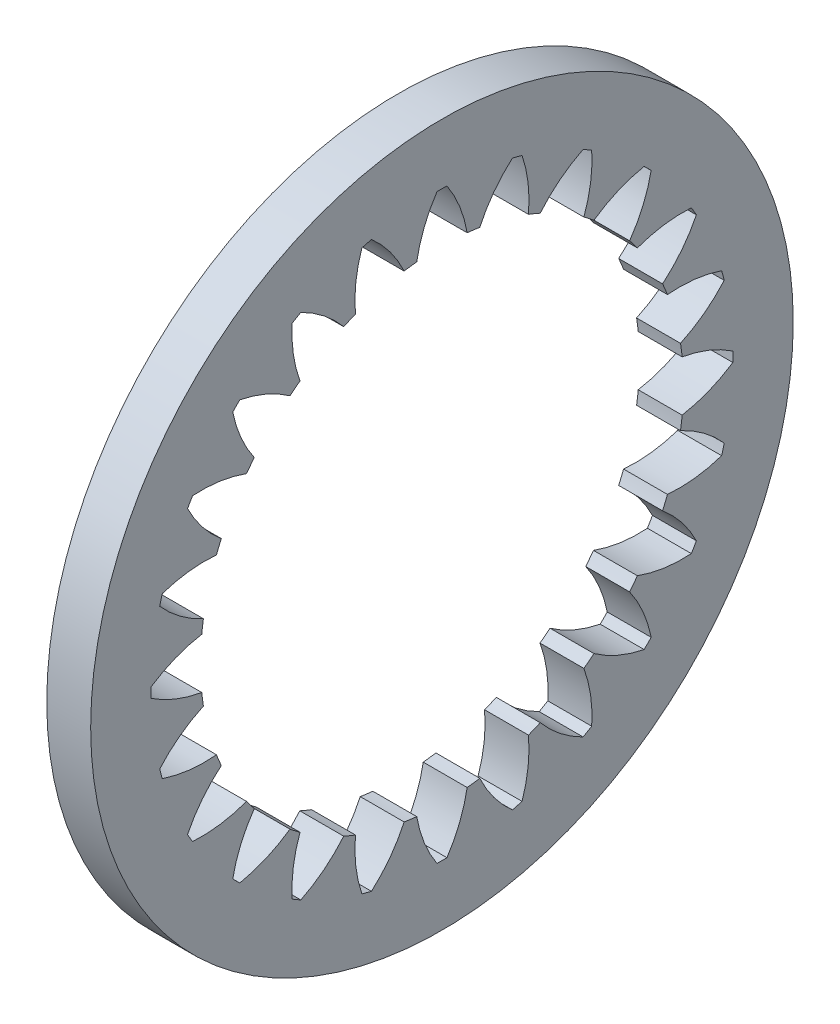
ISO-10303-21;
HEADER;
FILE_DESCRIPTION(('STEP AP214'),'2;1');
FILE_NAME('part.step','',(''),(''),'','','');
FILE_SCHEMA(('AUTOMOTIVE_DESIGN { 1 0 10303 214 1 1 1 1 }'));
ENDSEC;
DATA;
#1=APPLICATION_CONTEXT('core data for automotive mechanical design processes');
#2=APPLICATION_PROTOCOL_DEFINITION('international standard','automotive_design',2000,#1);
#3=PRODUCT_CONTEXT('',#1,'mechanical');
#4=PRODUCT('Part','Part','',(#3));
#5=PRODUCT_RELATED_PRODUCT_CATEGORY('part','',(#4));
#6=PRODUCT_DEFINITION_FORMATION('','',#4);
#7=PRODUCT_DEFINITION_CONTEXT('part definition',#1,'design');
#8=PRODUCT_DEFINITION('design','',#6,#7);
#9=PRODUCT_DEFINITION_SHAPE('','',#8);
#10=(LENGTH_UNIT() NAMED_UNIT(*) SI_UNIT(.MILLI.,.METRE.));
#11=(NAMED_UNIT(*) PLANE_ANGLE_UNIT() SI_UNIT($,.RADIAN.));
#12=(NAMED_UNIT(*) SI_UNIT($,.STERADIAN.) SOLID_ANGLE_UNIT());
#13=UNCERTAINTY_MEASURE_WITH_UNIT(LENGTH_MEASURE(1.E-05),#10,'distance_accuracy_value','');
#14=(GEOMETRIC_REPRESENTATION_CONTEXT(3) GLOBAL_UNCERTAINTY_ASSIGNED_CONTEXT((#13)) GLOBAL_UNIT_ASSIGNED_CONTEXT((#10,
#11,#12)) REPRESENTATION_CONTEXT('',''));
#15=CARTESIAN_POINT('',(0.,0.,0.));
#16=DIRECTION('',(0.,0.,1.));
#17=DIRECTION('',(1.,0.,0.));
#18=AXIS2_PLACEMENT_3D('',#15,#16,#17);
#19=CARTESIAN_POINT('',(-10.,0.,0.));
#20=DIRECTION('',(-1.,0.,0.));
#21=DIRECTION('',(0.,0.,1.));
#22=AXIS2_PLACEMENT_3D('',#19,#20,#21);
#23=CYLINDRICAL_SURFACE('',#22,69.85);
#24=DIRECTION('',(-1.,0.,0.));
#25=VECTOR('',#24,1.);
#26=CARTESIAN_POINT('',(6.35,68.9883009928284,-10.9378620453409));
#27=LINE('',#26,#25);
#28=CARTESIAN_POINT('',(12.7,68.9883009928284,-10.9378620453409));
#29=VERTEX_POINT('',#28);
#30=CARTESIAN_POINT('',(0.,68.9883009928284,-10.9378620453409));
#31=VERTEX_POINT('',#30);
#32=EDGE_CURVE('E656',#29,#31,#27,.T.);
#33=ORIENTED_EDGE('',*,*,#32,.F.);
#34=CARTESIAN_POINT('',(12.7,0.,0.));
#35=DIRECTION('',(-1.,0.,0.));
#36=DIRECTION('',(0.,0.,1.));
#37=AXIS2_PLACEMENT_3D('',#34,#35,#36);
#38=CIRCLE('',#37,69.85);
#39=CARTESIAN_POINT('',(12.7,69.4685086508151,-7.29032275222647));
#40=VERTEX_POINT('',#39);
#41=EDGE_CURVE('E647',#40,#29,#38,.T.);
#42=ORIENTED_EDGE('',*,*,#41,.F.);
#43=DIRECTION('',(-1.,0.,0.));
#44=VECTOR('',#43,1.);
#45=CARTESIAN_POINT('',(6.35,69.4685086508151,-7.29032275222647));
#46=LINE('',#45,#44);
#47=CARTESIAN_POINT('',(0.,69.4685086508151,-7.29032275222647));
#48=VERTEX_POINT('',#47);
#49=EDGE_CURVE('E1201',#48,#40,#46,.F.);
#50=ORIENTED_EDGE('',*,*,#49,.F.);
#51=CARTESIAN_POINT('',(0.,0.,0.));
#52=DIRECTION('',(-1.,0.,0.));
#53=DIRECTION('',(0.,0.,1.));
#54=AXIS2_PLACEMENT_3D('',#51,#52,#53);
#55=CIRCLE('',#54,69.85);
#56=EDGE_CURVE('E1207',#48,#31,#55,.T.);
#57=ORIENTED_EDGE('',*,*,#56,.T.);
#58=EDGE_LOOP('',(#33,#42,#50,#57));
#59=FACE_BOUND('',#58,.T.);
#60=ADVANCED_FACE('F33',(#59),#23,.F.);
#61=DIRECTION('',(-1.,0.,0.));
#62=VECTOR('',#61,1.);
#63=CARTESIAN_POINT('',(6.35,65.2145522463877,-25.0216841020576));
#64=LINE('',#63,#62);
#65=CARTESIAN_POINT('',(0.,65.2145522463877,-25.0216841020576));
#66=VERTEX_POINT('',#65);
#67=CARTESIAN_POINT('',(12.7,65.2145522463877,-25.0216841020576));
#68=VERTEX_POINT('',#67);
#69=EDGE_CURVE('E641',#66,#68,#64,.F.);
#70=ORIENTED_EDGE('',*,*,#69,.F.);
#71=CARTESIAN_POINT('',(0.,63.8066546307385,-28.4206496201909));
#72=VERTEX_POINT('',#71);
#73=EDGE_CURVE('E1211',#66,#72,#55,.T.);
#74=ORIENTED_EDGE('',*,*,#73,.T.);
#75=DIRECTION('',(-1.,0.,0.));
#76=VECTOR('',#75,1.);
#77=CARTESIAN_POINT('',(6.35,63.8066546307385,-28.4206496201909));
#78=LINE('',#77,#76);
#79=CARTESIAN_POINT('',(12.7,63.8066546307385,-28.4206496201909));
#80=VERTEX_POINT('',#79);
#81=EDGE_CURVE('E675',#80,#72,#78,.T.);
#82=ORIENTED_EDGE('',*,*,#81,.F.);
#83=EDGE_CURVE('E1220',#68,#80,#38,.T.);
#84=ORIENTED_EDGE('',*,*,#83,.F.);
#85=EDGE_LOOP('',(#70,#74,#82,#84));
#86=FACE_BOUND('',#85,.T.);
#87=ADVANCED_FACE('F1405',(#86),#23,.F.);
#88=CARTESIAN_POINT('',(12.7,0.,-69.85));
#89=DIRECTION('',(-1.,0.,0.));
#90=DIRECTION('',(0.,0.,1.));
#91=AXIS2_PLACEMENT_3D('',#88,#89,#90);
#92=PLANE('',#91);
#93=CARTESIAN_POINT('',(12.7,0.,0.));
#94=DIRECTION('',(-1.,0.,0.));
#95=DIRECTION('',(0.,0.,1.));
#96=AXIS2_PLACEMENT_3D('',#93,#94,#95);
#97=CIRCLE('',#96,101.6);
#98=CARTESIAN_POINT('',(12.7,0.,101.6));
#99=VERTEX_POINT('',#98);
#100=EDGE_CURVE('E1214',#99,#99,#97,.T.);
#101=ORIENTED_EDGE('',*,*,#100,.F.);
#102=EDGE_LOOP('',(#101));
#103=FACE_BOUND('',#102,.T.);
#104=CARTESIAN_POINT('',(12.7,53.0089651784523,-45.5250103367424));
#105=DIRECTION('',(1.,0.,0.));
#106=DIRECTION('',(0.,-0.258819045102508,-0.965925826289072));
#107=AXIS2_PLACEMENT_3D('',#104,#105,#106);
#108=CIRCLE('',#107,38.1);
#109=CARTESIAN_POINT('',(12.7,81.6332099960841,-20.3801776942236));
#110=VERTEX_POINT('',#109);
#111=EDGE_CURVE('E634',#110,#29,#108,.T.);
#112=ORIENTED_EDGE('',*,*,#111,.F.);
#113=CARTESIAN_POINT('',(12.7,0.,0.));
#114=DIRECTION('',(1.,0.,0.));
#115=DIRECTION('',(0.,-0.258819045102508,-0.965925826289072));
#116=AXIS2_PLACEMENT_3D('',#113,#114,#115);
#117=CIRCLE('',#116,84.13877);
#118=CARTESIAN_POINT('',(12.7,80.886522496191,-23.1668533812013));
#119=VERTEX_POINT('',#118);
#120=EDGE_CURVE('E626',#119,#110,#117,.T.);
#121=ORIENTED_EDGE('',*,*,#120,.F.);
#122=CARTESIAN_POINT('',(12.7,68.6696156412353,12.9213328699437));
#123=DIRECTION('',(1.,0.,0.));
#124=DIRECTION('',(0.,-0.258819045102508,-0.965925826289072));
#125=AXIS2_PLACEMENT_3D('',#122,#123,#124);
#126=CIRCLE('',#125,38.1);
#127=EDGE_CURVE('E648',#68,#119,#126,.T.);
#128=ORIENTED_EDGE('',*,*,#127,.F.);
#129=ORIENTED_EDGE('',*,*,#83,.T.);
#130=CARTESIAN_POINT('',(12.7,39.4199887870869,-57.6935129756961));
#131=DIRECTION('',(1.,0.,0.));
#132=DIRECTION('',(0.,-0.499999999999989,-0.866025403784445));
#133=AXIS2_PLACEMENT_3D('',#130,#131,#132);
#134=CIRCLE('',#133,38.1);
#135=CARTESIAN_POINT('',(12.7,73.5768476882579,-40.813969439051));
#136=VERTEX_POINT('',#135);
#137=EDGE_CURVE('E660',#136,#80,#134,.T.);
#138=ORIENTED_EDGE('',*,*,#137,.F.);
#139=CARTESIAN_POINT('',(12.7,0.,0.));
#140=DIRECTION('',(1.,0.,0.));
#141=DIRECTION('',(0.,-0.499999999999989,-0.866025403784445));
#142=AXIS2_PLACEMENT_3D('',#139,#140,#141);
#143=CIRCLE('',#142,84.13877);
#144=CARTESIAN_POINT('',(12.7,72.13435820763,-43.3124345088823));
#145=VERTEX_POINT('',#144);
#146=EDGE_CURVE('E658',#145,#136,#143,.T.);
#147=ORIENTED_EDGE('',*,*,#146,.F.);
#148=CARTESIAN_POINT('',(12.7,69.6740422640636,-5.29195521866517));
#149=DIRECTION('',(1.,0.,0.));
#150=DIRECTION('',(0.,-0.499999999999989,-0.866025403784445));
#151=AXIS2_PLACEMENT_3D('',#148,#149,#150);
#152=CIRCLE('',#151,38.1);
#153=CARTESIAN_POINT('',(12.7,56.5163318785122,-41.0478590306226));
#154=VERTEX_POINT('',#153);
#155=EDGE_CURVE('E664',#154,#145,#152,.T.);
#156=ORIENTED_EDGE('',*,*,#155,.F.);
#157=CARTESIAN_POINT('',(12.7,54.2766902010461,-43.9666168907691));
#158=VERTEX_POINT('',#157);
#159=EDGE_CURVE('E1275',#154,#158,#38,.T.);
#160=ORIENTED_EDGE('',*,*,#159,.T.);
#161=CARTESIAN_POINT('',(12.7,23.1446053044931,-65.9302980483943));
#162=DIRECTION('',(1.,0.,0.));
#163=DIRECTION('',(0.,-0.707106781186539,-0.707106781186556));
#164=AXIS2_PLACEMENT_3D('',#161,#162,#163);
#165=CIRCLE('',#164,38.1);
#166=CARTESIAN_POINT('',(12.7,60.5063448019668,-58.4663566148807));
#167=VERTEX_POINT('',#166);
#168=EDGE_CURVE('E681',#167,#158,#165,.T.);
#169=ORIENTED_EDGE('',*,*,#168,.F.);
#170=CARTESIAN_POINT('',(12.7,0.,0.));
#171=DIRECTION('',(1.,0.,0.));
#172=DIRECTION('',(0.,-0.707106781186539,-0.707106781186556));
#173=AXIS2_PLACEMENT_3D('',#170,#171,#172);
#174=CIRCLE('',#173,84.13877);
#175=CARTESIAN_POINT('',(12.7,58.4663566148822,-60.5063448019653));
#176=VERTEX_POINT('',#175);
#177=EDGE_CURVE('E679',#176,#167,#174,.T.);
#178=ORIENTED_EDGE('',*,*,#177,.F.);
#179=CARTESIAN_POINT('',(12.7,65.9302980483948,-23.1446053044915));
#180=DIRECTION('',(1.,0.,0.));
#181=DIRECTION('',(0.,-0.707106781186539,-0.707106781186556));
#182=AXIS2_PLACEMENT_3D('',#179,#180,#181);
#183=CIRCLE('',#182,38.1);
#184=CARTESIAN_POINT('',(12.7,43.9666168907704,-54.2766902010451));
#185=VERTEX_POINT('',#184);
#186=EDGE_CURVE('E685',#185,#176,#183,.T.);
#187=ORIENTED_EDGE('',*,*,#186,.F.);
#188=CARTESIAN_POINT('',(12.7,41.047859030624,-56.5163318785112));
#189=VERTEX_POINT('',#188);
#190=EDGE_CURVE('E1408',#185,#189,#38,.T.);
#191=ORIENTED_EDGE('',*,*,#190,.T.);
#192=CARTESIAN_POINT('',(12.7,5.29195521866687,-69.6740422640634));
#193=DIRECTION('',(1.,0.,0.));
#194=DIRECTION('',(0.,-0.866025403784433,-0.50000000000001));
#195=AXIS2_PLACEMENT_3D('',#192,#193,#194);
#196=CIRCLE('',#195,38.1);
#197=CARTESIAN_POINT('',(12.7,43.3124345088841,-72.1343582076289));
#198=VERTEX_POINT('',#197);
#199=EDGE_CURVE('E705',#198,#189,#196,.T.);
#200=ORIENTED_EDGE('',*,*,#199,.F.);
#201=CARTESIAN_POINT('',(12.7,0.,0.));
#202=DIRECTION('',(1.,0.,0.));
#203=DIRECTION('',(0.,-0.866025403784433,-0.50000000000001));
#204=AXIS2_PLACEMENT_3D('',#201,#202,#203);
#205=CIRCLE('',#204,84.13877);
#206=CARTESIAN_POINT('',(12.7,40.8139694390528,-73.5768476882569));
#207=VERTEX_POINT('',#206);
#208=EDGE_CURVE('E703',#207,#198,#205,.T.);
#209=ORIENTED_EDGE('',*,*,#208,.F.);
#210=CARTESIAN_POINT('',(12.7,57.6935129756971,-39.4199887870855));
#211=DIRECTION('',(1.,0.,0.));
#212=DIRECTION('',(0.,-0.866025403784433,-0.50000000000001));
#213=AXIS2_PLACEMENT_3D('',#210,#211,#212);
#214=CIRCLE('',#213,38.1);
#215=CARTESIAN_POINT('',(12.7,28.4206496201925,-63.8066546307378));
#216=VERTEX_POINT('',#215);
#217=EDGE_CURVE('E709',#216,#207,#214,.T.);
#218=ORIENTED_EDGE('',*,*,#217,.F.);
#219=CARTESIAN_POINT('',(12.7,25.0216841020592,-65.2145522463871));
#220=VERTEX_POINT('',#219);
#221=EDGE_CURVE('E1410',#216,#220,#38,.T.);
#222=ORIENTED_EDGE('',*,*,#221,.T.);
#223=CARTESIAN_POINT('',(12.7,-12.9213328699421,-68.6696156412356));
#224=DIRECTION('',(1.,0.,0.));
#225=DIRECTION('',(0.,-0.965925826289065,-0.258819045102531));
#226=AXIS2_PLACEMENT_3D('',#223,#224,#225);
#227=CIRCLE('',#226,38.1);
#228=CARTESIAN_POINT('',(12.7,23.1668533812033,-80.8865224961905));
#229=VERTEX_POINT('',#228);
#230=EDGE_CURVE('E729',#229,#220,#227,.T.);
#231=ORIENTED_EDGE('',*,*,#230,.F.);
#232=CARTESIAN_POINT('',(12.7,0.,0.));
#233=DIRECTION('',(1.,0.,0.));
#234=DIRECTION('',(0.,-0.965925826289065,-0.258819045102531));
#235=AXIS2_PLACEMENT_3D('',#232,#233,#234);
#236=CIRCLE('',#235,84.13877);
#237=CARTESIAN_POINT('',(12.7,20.3801776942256,-81.6332099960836));
#238=VERTEX_POINT('',#237);
#239=EDGE_CURVE('E727',#238,#229,#236,.T.);
#240=ORIENTED_EDGE('',*,*,#239,.F.);
#241=CARTESIAN_POINT('',(12.7,45.5250103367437,-53.0089651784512));
#242=DIRECTION('',(1.,0.,0.));
#243=DIRECTION('',(0.,-0.965925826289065,-0.258819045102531));
#244=AXIS2_PLACEMENT_3D('',#241,#242,#243);
#245=CIRCLE('',#244,38.1);
#246=CARTESIAN_POINT('',(12.7,10.9378620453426,-68.9883009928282));
#247=VERTEX_POINT('',#246);
#248=EDGE_CURVE('E733',#247,#238,#245,.T.);
#249=ORIENTED_EDGE('',*,*,#248,.F.);
#250=CARTESIAN_POINT('',(12.7,7.2903227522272,-69.468508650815));
#251=VERTEX_POINT('',#250);
#252=EDGE_CURVE('E1414',#247,#251,#38,.T.);
#253=ORIENTED_EDGE('',*,*,#252,.T.);
#254=CARTESIAN_POINT('',(12.7,-30.2540534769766,-62.985468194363));
#255=DIRECTION('',(1.,0.,0.));
#256=DIRECTION('',(0.,-1.,0.));
#257=AXIS2_PLACEMENT_3D('',#254,#255,#256);
#258=CIRCLE('',#257,38.1);
#259=CARTESIAN_POINT('',(12.7,1.44248948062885,-84.1264039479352));
#260=VERTEX_POINT('',#259);
#261=EDGE_CURVE('E753',#260,#251,#258,.T.);
#262=ORIENTED_EDGE('',*,*,#261,.F.);
#263=CARTESIAN_POINT('',(12.7,0.,0.));
#264=DIRECTION('',(1.,0.,0.));
#265=DIRECTION('',(0.,-1.,0.));
#266=AXIS2_PLACEMENT_3D('',#263,#264,#265);
#267=CIRCLE('',#266,84.13877);
#268=CARTESIAN_POINT('',(12.7,-1.44248948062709,-84.1264039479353));
#269=VERTEX_POINT('',#268);
#270=EDGE_CURVE('E751',#269,#260,#267,.T.);
#271=ORIENTED_EDGE('',*,*,#270,.F.);
#272=CARTESIAN_POINT('',(12.7,30.254053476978,-62.9854681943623));
#273=DIRECTION('',(1.,0.,0.));
#274=DIRECTION('',(0.,-1.,0.));
#275=AXIS2_PLACEMENT_3D('',#272,#273,#274);
#276=CIRCLE('',#275,38.1);
#277=CARTESIAN_POINT('',(12.7,-7.29032275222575,-69.4685086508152));
#278=VERTEX_POINT('',#277);
#279=EDGE_CURVE('E757',#278,#269,#276,.T.);
#280=ORIENTED_EDGE('',*,*,#279,.F.);
#281=CARTESIAN_POINT('',(12.7,-10.9378620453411,-68.9883009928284));
#282=VERTEX_POINT('',#281);
#283=EDGE_CURVE('E1418',#278,#282,#38,.T.);
#284=ORIENTED_EDGE('',*,*,#283,.T.);
#285=CARTESIAN_POINT('',(12.7,-45.5250103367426,-53.0089651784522));
#286=DIRECTION('',(1.,0.,0.));
#287=DIRECTION('',(0.,-0.965925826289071,0.258819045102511));
#288=AXIS2_PLACEMENT_3D('',#285,#286,#287);
#289=CIRCLE('',#288,38.1);
#290=CARTESIAN_POINT('',(12.7,-20.3801776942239,-81.6332099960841));
#291=VERTEX_POINT('',#290);
#292=EDGE_CURVE('E777',#291,#282,#289,.T.);
#293=ORIENTED_EDGE('',*,*,#292,.F.);
#294=CARTESIAN_POINT('',(12.7,0.,0.));
#295=DIRECTION('',(1.,0.,0.));
#296=DIRECTION('',(0.,-0.965925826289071,0.258819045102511));
#297=AXIS2_PLACEMENT_3D('',#294,#295,#296);
#298=CIRCLE('',#297,84.13877);
#299=CARTESIAN_POINT('',(12.7,-23.1668533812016,-80.886522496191));
#300=VERTEX_POINT('',#299);
#301=EDGE_CURVE('E775',#300,#291,#298,.T.);
#302=ORIENTED_EDGE('',*,*,#301,.F.);
#303=CARTESIAN_POINT('',(12.7,12.9213328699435,-68.6696156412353));
#304=DIRECTION('',(1.,0.,0.));
#305=DIRECTION('',(0.,-0.965925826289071,0.258819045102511));
#306=AXIS2_PLACEMENT_3D('',#303,#304,#305);
#307=CIRCLE('',#306,38.1);
#308=CARTESIAN_POINT('',(12.7,-25.0216841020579,-65.2145522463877));
#309=VERTEX_POINT('',#308);
#310=EDGE_CURVE('E781',#309,#300,#307,.T.);
#311=ORIENTED_EDGE('',*,*,#310,.F.);
#312=CARTESIAN_POINT('',(12.7,-28.4206496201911,-63.8066546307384));
#313=VERTEX_POINT('',#312);
#314=EDGE_CURVE('E1422',#309,#313,#38,.T.);
#315=ORIENTED_EDGE('',*,*,#314,.T.);
#316=CARTESIAN_POINT('',(12.7,-57.6935129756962,-39.4199887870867));
#317=DIRECTION('',(1.,0.,0.));
#318=DIRECTION('',(0.,-0.866025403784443,0.499999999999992));
#319=AXIS2_PLACEMENT_3D('',#316,#317,#318);
#320=CIRCLE('',#319,38.1);
#321=CARTESIAN_POINT('',(12.7,-40.8139694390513,-73.5768476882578));
#322=VERTEX_POINT('',#321);
#323=EDGE_CURVE('E801',#322,#313,#320,.T.);
#324=ORIENTED_EDGE('',*,*,#323,.F.);
#325=CARTESIAN_POINT('',(12.7,0.,0.));
#326=DIRECTION('',(1.,0.,0.));
#327=DIRECTION('',(0.,-0.866025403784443,0.499999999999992));
#328=AXIS2_PLACEMENT_3D('',#325,#326,#327);
#329=CIRCLE('',#328,84.13877);
#330=CARTESIAN_POINT('',(12.7,-43.3124345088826,-72.1343582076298));
#331=VERTEX_POINT('',#330);
#332=EDGE_CURVE('E799',#331,#322,#329,.T.);
#333=ORIENTED_EDGE('',*,*,#332,.F.);
#334=CARTESIAN_POINT('',(12.7,-5.29195521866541,-69.6740422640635));
#335=DIRECTION('',(1.,0.,0.));
#336=DIRECTION('',(0.,-0.866025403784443,0.499999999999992));
#337=AXIS2_PLACEMENT_3D('',#334,#335,#336);
#338=CIRCLE('',#337,38.1);
#339=CARTESIAN_POINT('',(12.7,-41.0478590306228,-56.516331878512));
#340=VERTEX_POINT('',#339);
#341=EDGE_CURVE('E805',#340,#331,#338,.T.);
#342=ORIENTED_EDGE('',*,*,#341,.F.);
#343=CARTESIAN_POINT('',(12.7,-43.9666168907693,-54.276690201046));
#344=VERTEX_POINT('',#343);
#345=EDGE_CURVE('E1426',#340,#344,#38,.T.);
#346=ORIENTED_EDGE('',*,*,#345,.T.);
#347=CARTESIAN_POINT('',(12.7,-65.9302980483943,-23.1446053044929));
#348=DIRECTION('',(1.,0.,0.));
#349=DIRECTION('',(0.,-0.707106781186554,0.707106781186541));
#350=AXIS2_PLACEMENT_3D('',#347,#348,#349);
#351=CIRCLE('',#350,38.1);
#352=CARTESIAN_POINT('',(12.7,-58.4663566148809,-60.5063448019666));
#353=VERTEX_POINT('',#352);
#354=EDGE_CURVE('E825',#353,#344,#351,.T.);
#355=ORIENTED_EDGE('',*,*,#354,.F.);
#356=CARTESIAN_POINT('',(12.7,0.,0.));
#357=DIRECTION('',(1.,0.,0.));
#358=DIRECTION('',(0.,-0.707106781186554,0.707106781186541));
#359=AXIS2_PLACEMENT_3D('',#356,#357,#358);
#360=CIRCLE('',#359,84.13877);
#361=CARTESIAN_POINT('',(12.7,-60.5063448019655,-58.466356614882));
#362=VERTEX_POINT('',#361);
#363=EDGE_CURVE('E823',#362,#353,#360,.T.);
#364=ORIENTED_EDGE('',*,*,#363,.F.);
#365=CARTESIAN_POINT('',(12.7,-23.1446053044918,-65.9302980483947));
#366=DIRECTION('',(1.,0.,0.));
#367=DIRECTION('',(0.,-0.707106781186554,0.707106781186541));
#368=AXIS2_PLACEMENT_3D('',#365,#366,#367);
#369=CIRCLE('',#368,38.1);
#370=CARTESIAN_POINT('',(12.7,-54.2766902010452,-43.9666168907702));
#371=VERTEX_POINT('',#370);
#372=EDGE_CURVE('E829',#371,#362,#369,.T.);
#373=ORIENTED_EDGE('',*,*,#372,.F.);
#374=CARTESIAN_POINT('',(12.7,-56.5163318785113,-41.0478590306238));
#375=VERTEX_POINT('',#374);
#376=EDGE_CURVE('E1430',#371,#375,#38,.T.);
#377=ORIENTED_EDGE('',*,*,#376,.T.);
#378=CARTESIAN_POINT('',(12.7,-69.6740422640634,-5.29195521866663));
#379=DIRECTION('',(1.,0.,0.));
#380=DIRECTION('',(0.,-0.500000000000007,0.866025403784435));
#381=AXIS2_PLACEMENT_3D('',#378,#379,#380);
#382=CIRCLE('',#381,38.1);
#383=CARTESIAN_POINT('',(12.7,-72.1343582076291,-43.3124345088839));
#384=VERTEX_POINT('',#383);
#385=EDGE_CURVE('E849',#384,#375,#382,.T.);
#386=ORIENTED_EDGE('',*,*,#385,.F.);
#387=CARTESIAN_POINT('',(12.7,0.,0.));
#388=DIRECTION('',(1.,0.,0.));
#389=DIRECTION('',(0.,-0.500000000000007,0.866025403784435));
#390=AXIS2_PLACEMENT_3D('',#387,#388,#389);
#391=CIRCLE('',#390,84.13877);
#392=CARTESIAN_POINT('',(12.7,-73.5768476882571,-40.8139694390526));
#393=VERTEX_POINT('',#392);
#394=EDGE_CURVE('E847',#393,#384,#391,.T.);
#395=ORIENTED_EDGE('',*,*,#394,.F.);
#396=CARTESIAN_POINT('',(12.7,-39.4199887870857,-57.6935129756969));
#397=DIRECTION('',(1.,0.,0.));
#398=DIRECTION('',(0.,-0.500000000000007,0.866025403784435));
#399=AXIS2_PLACEMENT_3D('',#396,#397,#398);
#400=CIRCLE('',#399,38.1);
#401=CARTESIAN_POINT('',(12.7,-63.8066546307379,-28.4206496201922));
#402=VERTEX_POINT('',#401);
#403=EDGE_CURVE('E853',#402,#393,#400,.T.);
#404=ORIENTED_EDGE('',*,*,#403,.F.);
#405=CARTESIAN_POINT('',(12.7,-65.2145522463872,-25.021684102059));
#406=VERTEX_POINT('',#405);
#407=EDGE_CURVE('E1434',#402,#406,#38,.T.);
#408=ORIENTED_EDGE('',*,*,#407,.T.);
#409=CARTESIAN_POINT('',(12.7,-68.6696156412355,12.9213328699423));
#410=DIRECTION('',(1.,0.,0.));
#411=DIRECTION('',(0.,-0.258819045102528,0.965925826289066));
#412=AXIS2_PLACEMENT_3D('',#409,#410,#411);
#413=CIRCLE('',#412,38.1);
#414=CARTESIAN_POINT('',(12.7,-80.8865224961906,-23.166853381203));
#415=VERTEX_POINT('',#414);
#416=EDGE_CURVE('E873',#415,#406,#413,.T.);
#417=ORIENTED_EDGE('',*,*,#416,.F.);
#418=CARTESIAN_POINT('',(12.7,0.,0.));
#419=DIRECTION('',(1.,0.,0.));
#420=DIRECTION('',(0.,-0.258819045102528,0.965925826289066));
#421=AXIS2_PLACEMENT_3D('',#418,#419,#420);
#422=CIRCLE('',#421,84.13877);
#423=CARTESIAN_POINT('',(12.7,-81.6332099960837,-20.3801776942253));
#424=VERTEX_POINT('',#423);
#425=EDGE_CURVE('E871',#424,#415,#422,.T.);
#426=ORIENTED_EDGE('',*,*,#425,.F.);
#427=CARTESIAN_POINT('',(12.7,-53.0089651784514,-45.5250103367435));
#428=DIRECTION('',(1.,0.,0.));
#429=DIRECTION('',(0.,-0.258819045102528,0.965925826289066));
#430=AXIS2_PLACEMENT_3D('',#427,#428,#429);
#431=CIRCLE('',#430,38.1);
#432=CARTESIAN_POINT('',(12.7,-68.9883009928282,-10.9378620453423));
#433=VERTEX_POINT('',#432);
#434=EDGE_CURVE('E877',#433,#424,#431,.T.);
#435=ORIENTED_EDGE('',*,*,#434,.F.);
#436=CARTESIAN_POINT('',(12.7,-69.468508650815,-7.29032275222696));
#437=VERTEX_POINT('',#436);
#438=EDGE_CURVE('E1438',#433,#437,#38,.T.);
#439=ORIENTED_EDGE('',*,*,#438,.T.);
#440=CARTESIAN_POINT('',(12.7,-62.9854681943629,30.2540534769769));
#441=DIRECTION('',(1.,0.,0.));
#442=DIRECTION('',(0.,0.,1.));
#443=AXIS2_PLACEMENT_3D('',#440,#441,#442);
#444=CIRCLE('',#443,38.1);
#445=CARTESIAN_POINT('',(12.7,-84.1264039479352,-1.44248948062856));
#446=VERTEX_POINT('',#445);
#447=EDGE_CURVE('E897',#446,#437,#444,.T.);
#448=ORIENTED_EDGE('',*,*,#447,.F.);
#449=CARTESIAN_POINT('',(12.7,0.,0.));
#450=DIRECTION('',(1.,0.,0.));
#451=DIRECTION('',(0.,0.,1.));
#452=AXIS2_PLACEMENT_3D('',#449,#450,#451);
#453=CIRCLE('',#452,84.13877);
#454=CARTESIAN_POINT('',(12.7,-84.1264039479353,1.44248948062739));
#455=VERTEX_POINT('',#454);
#456=EDGE_CURVE('E895',#455,#446,#453,.T.);
#457=ORIENTED_EDGE('',*,*,#456,.F.);
#458=CARTESIAN_POINT('',(12.7,-62.9854681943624,-30.2540534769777));
#459=DIRECTION('',(1.,0.,0.));
#460=DIRECTION('',(0.,0.,1.));
#461=AXIS2_PLACEMENT_3D('',#458,#459,#460);
#462=CIRCLE('',#461,38.1);
#463=CARTESIAN_POINT('',(12.7,-69.4685086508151,7.29032275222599));
#464=VERTEX_POINT('',#463);
#465=EDGE_CURVE('E901',#464,#455,#462,.T.);
#466=ORIENTED_EDGE('',*,*,#465,.F.);
#467=CARTESIAN_POINT('',(12.7,-68.9883009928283,10.9378620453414));
#468=VERTEX_POINT('',#467);
#469=EDGE_CURVE('E1442',#464,#468,#38,.T.);
#470=ORIENTED_EDGE('',*,*,#469,.T.);
#471=CARTESIAN_POINT('',(12.7,-53.008965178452,45.5250103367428));
#472=DIRECTION('',(1.,0.,0.));
#473=DIRECTION('',(0.,0.258819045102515,0.96592582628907));
#474=AXIS2_PLACEMENT_3D('',#471,#472,#473);
#475=CIRCLE('',#474,38.1);
#476=CARTESIAN_POINT('',(12.7,-81.633209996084,20.3801776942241));
#477=VERTEX_POINT('',#476);
#478=EDGE_CURVE('E921',#477,#468,#475,.T.);
#479=ORIENTED_EDGE('',*,*,#478,.F.);
#480=CARTESIAN_POINT('',(12.7,0.,0.));
#481=DIRECTION('',(1.,0.,0.));
#482=DIRECTION('',(0.,0.258819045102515,0.96592582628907));
#483=AXIS2_PLACEMENT_3D('',#480,#481,#482);
#484=CIRCLE('',#483,84.13877);
#485=CARTESIAN_POINT('',(12.7,-80.8865224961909,23.1668533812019));
#486=VERTEX_POINT('',#485);
#487=EDGE_CURVE('E919',#486,#477,#484,.T.);
#488=ORIENTED_EDGE('',*,*,#487,.F.);
#489=CARTESIAN_POINT('',(12.7,-68.6696156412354,-12.9213328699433));
#490=DIRECTION('',(1.,0.,0.));
#491=DIRECTION('',(0.,0.258819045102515,0.96592582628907));
#492=AXIS2_PLACEMENT_3D('',#489,#490,#491);
#493=CIRCLE('',#492,38.1);
#494=CARTESIAN_POINT('',(12.7,-65.2145522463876,25.0216841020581));
#495=VERTEX_POINT('',#494);
#496=EDGE_CURVE('E925',#495,#486,#493,.T.);
#497=ORIENTED_EDGE('',*,*,#496,.F.);
#498=CARTESIAN_POINT('',(12.7,-63.8066546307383,28.4206496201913));
#499=VERTEX_POINT('',#498);
#500=EDGE_CURVE('E1446',#495,#499,#38,.T.);
#501=ORIENTED_EDGE('',*,*,#500,.T.);
#502=CARTESIAN_POINT('',(12.7,-39.4199887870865,57.6935129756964));
#503=DIRECTION('',(1.,0.,0.));
#504=DIRECTION('',(0.,0.499999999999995,0.866025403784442));
#505=AXIS2_PLACEMENT_3D('',#502,#503,#504);
#506=CIRCLE('',#505,38.1);
#507=CARTESIAN_POINT('',(12.7,-73.5768476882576,40.8139694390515));
#508=VERTEX_POINT('',#507);
#509=EDGE_CURVE('E945',#508,#499,#506,.T.);
#510=ORIENTED_EDGE('',*,*,#509,.F.);
#511=CARTESIAN_POINT('',(12.7,0.,0.));
#512=DIRECTION('',(1.,0.,0.));
#513=DIRECTION('',(0.,0.499999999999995,0.866025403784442));
#514=AXIS2_PLACEMENT_3D('',#511,#512,#513);
#515=CIRCLE('',#514,84.13877);
#516=CARTESIAN_POINT('',(12.7,-72.1343582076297,43.3124345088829));
#517=VERTEX_POINT('',#516);
#518=EDGE_CURVE('E943',#517,#508,#515,.T.);
#519=ORIENTED_EDGE('',*,*,#518,.F.);
#520=CARTESIAN_POINT('',(12.7,-69.6740422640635,5.29195521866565));
#521=DIRECTION('',(1.,0.,0.));
#522=DIRECTION('',(0.,0.499999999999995,0.866025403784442));
#523=AXIS2_PLACEMENT_3D('',#520,#521,#522);
#524=CIRCLE('',#523,38.1);
#525=CARTESIAN_POINT('',(12.7,-56.5163318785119,41.047859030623));
#526=VERTEX_POINT('',#525);
#527=EDGE_CURVE('E949',#526,#517,#524,.T.);
#528=ORIENTED_EDGE('',*,*,#527,.F.);
#529=CARTESIAN_POINT('',(12.7,-54.2766902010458,43.9666168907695));
#530=VERTEX_POINT('',#529);
#531=EDGE_CURVE('E1450',#526,#530,#38,.T.);
#532=ORIENTED_EDGE('',*,*,#531,.T.);
#533=CARTESIAN_POINT('',(12.7,-23.1446053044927,65.9302980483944));
#534=DIRECTION('',(1.,0.,0.));
#535=DIRECTION('',(0.,0.707106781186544,0.707106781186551));
#536=AXIS2_PLACEMENT_3D('',#533,#534,#535);
#537=CIRCLE('',#536,38.1);
#538=CARTESIAN_POINT('',(12.7,-60.5063448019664,58.4663566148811));
#539=VERTEX_POINT('',#538);
#540=EDGE_CURVE('E969',#539,#530,#537,.T.);
#541=ORIENTED_EDGE('',*,*,#540,.F.);
#542=CARTESIAN_POINT('',(12.7,0.,0.));
#543=DIRECTION('',(1.,0.,0.));
#544=DIRECTION('',(0.,0.707106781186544,0.707106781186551));
#545=AXIS2_PLACEMENT_3D('',#542,#543,#544);
#546=CIRCLE('',#545,84.13877);
#547=CARTESIAN_POINT('',(12.7,-58.4663566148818,60.5063448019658));
#548=VERTEX_POINT('',#547);
#549=EDGE_CURVE('E967',#548,#539,#546,.T.);
#550=ORIENTED_EDGE('',*,*,#549,.F.);
#551=CARTESIAN_POINT('',(12.7,-65.9302980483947,23.144605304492));
#552=DIRECTION('',(1.,0.,0.));
#553=DIRECTION('',(0.,0.707106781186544,0.707106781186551));
#554=AXIS2_PLACEMENT_3D('',#551,#552,#553);
#555=CIRCLE('',#554,38.1);
#556=CARTESIAN_POINT('',(12.7,-43.9666168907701,54.2766902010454));
#557=VERTEX_POINT('',#556);
#558=EDGE_CURVE('E973',#557,#548,#555,.T.);
#559=ORIENTED_EDGE('',*,*,#558,.F.);
#560=CARTESIAN_POINT('',(12.7,-41.0478590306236,56.5163318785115));
#561=VERTEX_POINT('',#560);
#562=EDGE_CURVE('E1454',#557,#561,#38,.T.);
#563=ORIENTED_EDGE('',*,*,#562,.T.);
#564=CARTESIAN_POINT('',(12.7,-5.29195521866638,69.6740422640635));
#565=DIRECTION('',(1.,0.,0.));
#566=DIRECTION('',(0.,0.866025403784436,0.500000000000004));
#567=AXIS2_PLACEMENT_3D('',#564,#565,#566);
#568=CIRCLE('',#567,38.1);
#569=CARTESIAN_POINT('',(12.7,-43.3124345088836,72.1343582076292));
#570=VERTEX_POINT('',#569);
#571=EDGE_CURVE('E993',#570,#561,#568,.T.);
#572=ORIENTED_EDGE('',*,*,#571,.F.);
#573=CARTESIAN_POINT('',(12.7,0.,0.));
#574=DIRECTION('',(1.,0.,0.));
#575=DIRECTION('',(0.,0.866025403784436,0.500000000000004));
#576=AXIS2_PLACEMENT_3D('',#573,#574,#575);
#577=CIRCLE('',#576,84.13877);
#578=CARTESIAN_POINT('',(12.7,-40.8139694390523,73.5768476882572));
#579=VERTEX_POINT('',#578);
#580=EDGE_CURVE('E991',#579,#570,#577,.T.);
#581=ORIENTED_EDGE('',*,*,#580,.F.);
#582=CARTESIAN_POINT('',(12.7,-57.6935129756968,39.4199887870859));
#583=DIRECTION('',(1.,0.,0.));
#584=DIRECTION('',(0.,0.866025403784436,0.500000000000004));
#585=AXIS2_PLACEMENT_3D('',#582,#583,#584);
#586=CIRCLE('',#585,38.1);
#587=CARTESIAN_POINT('',(12.7,-28.420649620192,63.806654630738));
#588=VERTEX_POINT('',#587);
#589=EDGE_CURVE('E997',#588,#579,#586,.T.);
#590=ORIENTED_EDGE('',*,*,#589,.F.);
#591=CARTESIAN_POINT('',(12.7,-25.0216841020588,65.2145522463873));
#592=VERTEX_POINT('',#591);
#593=EDGE_CURVE('E1458',#588,#592,#38,.T.);
#594=ORIENTED_EDGE('',*,*,#593,.T.);
#595=CARTESIAN_POINT('',(12.7,12.9213328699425,68.6696156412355));
#596=DIRECTION('',(1.,0.,0.));
#597=DIRECTION('',(0.,0.965925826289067,0.258819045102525));
#598=AXIS2_PLACEMENT_3D('',#595,#596,#597);
#599=CIRCLE('',#598,38.1);
#600=CARTESIAN_POINT('',(12.7,-23.1668533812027,80.8865224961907));
#601=VERTEX_POINT('',#600);
#602=EDGE_CURVE('E1017',#601,#592,#599,.T.);
#603=ORIENTED_EDGE('',*,*,#602,.F.);
#604=CARTESIAN_POINT('',(12.7,0.,0.));
#605=DIRECTION('',(1.,0.,0.));
#606=DIRECTION('',(0.,0.965925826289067,0.258819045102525));
#607=AXIS2_PLACEMENT_3D('',#604,#605,#606);
#608=CIRCLE('',#607,84.13877);
#609=CARTESIAN_POINT('',(12.7,-20.380177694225,81.6332099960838));
#610=VERTEX_POINT('',#609);
#611=EDGE_CURVE('E1015',#610,#601,#608,.T.);
#612=ORIENTED_EDGE('',*,*,#611,.F.);
#613=CARTESIAN_POINT('',(12.7,-45.5250103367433,53.0089651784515));
#614=DIRECTION('',(1.,0.,0.));
#615=DIRECTION('',(0.,0.965925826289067,0.258819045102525));
#616=AXIS2_PLACEMENT_3D('',#613,#614,#615);
#617=CIRCLE('',#616,38.1);
#618=CARTESIAN_POINT('',(12.7,-10.9378620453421,68.9883009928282));
#619=VERTEX_POINT('',#618);
#620=EDGE_CURVE('E1021',#619,#610,#617,.T.);
#621=ORIENTED_EDGE('',*,*,#620,.F.);
#622=CARTESIAN_POINT('',(12.7,-7.29032275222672,69.4685086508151));
#623=VERTEX_POINT('',#622);
#624=EDGE_CURVE('E1462',#619,#623,#38,.T.);
#625=ORIENTED_EDGE('',*,*,#624,.T.);
#626=CARTESIAN_POINT('',(12.7,30.2540534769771,62.9854681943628));
#627=DIRECTION('',(1.,0.,0.));
#628=DIRECTION('',(0.,1.,0.));
#629=AXIS2_PLACEMENT_3D('',#626,#627,#628);
#630=CIRCLE('',#629,38.1);
#631=CARTESIAN_POINT('',(12.7,-1.44248948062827,84.1264039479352));
#632=VERTEX_POINT('',#631);
#633=EDGE_CURVE('E1041',#632,#623,#630,.T.);
#634=ORIENTED_EDGE('',*,*,#633,.F.);
#635=CARTESIAN_POINT('',(12.7,0.,0.));
#636=DIRECTION('',(1.,0.,0.));
#637=DIRECTION('',(0.,1.,0.));
#638=AXIS2_PLACEMENT_3D('',#635,#636,#637);
#639=CIRCLE('',#638,84.13877);
#640=CARTESIAN_POINT('',(12.7,1.44248948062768,84.1264039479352));
#641=VERTEX_POINT('',#640);
#642=EDGE_CURVE('E1039',#641,#632,#639,.T.);
#643=ORIENTED_EDGE('',*,*,#642,.F.);
#644=CARTESIAN_POINT('',(12.7,-30.2540534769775,62.9854681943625));
#645=DIRECTION('',(1.,0.,0.));
#646=DIRECTION('',(0.,1.,0.));
#647=AXIS2_PLACEMENT_3D('',#644,#645,#646);
#648=CIRCLE('',#647,38.1);
#649=CARTESIAN_POINT('',(12.7,7.29032275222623,69.4685086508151));
#650=VERTEX_POINT('',#649);
#651=EDGE_CURVE('E1045',#650,#641,#648,.T.);
#652=ORIENTED_EDGE('',*,*,#651,.F.);
#653=CARTESIAN_POINT('',(12.7,10.9378620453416,68.9883009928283));
#654=VERTEX_POINT('',#653);
#655=EDGE_CURVE('E1466',#650,#654,#38,.T.);
#656=ORIENTED_EDGE('',*,*,#655,.T.);
#657=CARTESIAN_POINT('',(12.7,45.5250103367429,53.0089651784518));
#658=DIRECTION('',(1.,0.,0.));
#659=DIRECTION('',(0.,0.965925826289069,-0.258819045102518));
#660=AXIS2_PLACEMENT_3D('',#657,#658,#659);
#661=CIRCLE('',#660,38.1);
#662=CARTESIAN_POINT('',(12.7,20.3801776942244,81.6332099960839));
#663=VERTEX_POINT('',#662);
#664=EDGE_CURVE('E1065',#663,#654,#661,.T.);
#665=ORIENTED_EDGE('',*,*,#664,.F.);
#666=CARTESIAN_POINT('',(12.7,0.,0.));
#667=DIRECTION('',(1.,0.,0.));
#668=DIRECTION('',(0.,0.965925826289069,-0.258819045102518));
#669=AXIS2_PLACEMENT_3D('',#666,#667,#668);
#670=CIRCLE('',#669,84.13877);
#671=CARTESIAN_POINT('',(12.7,23.1668533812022,80.8865224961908));
#672=VERTEX_POINT('',#671);
#673=EDGE_CURVE('E1063',#672,#663,#670,.T.);
#674=ORIENTED_EDGE('',*,*,#673,.F.);
#675=CARTESIAN_POINT('',(12.7,-12.921332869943,68.6696156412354));
#676=DIRECTION('',(1.,0.,0.));
#677=DIRECTION('',(0.,0.965925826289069,-0.258819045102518));
#678=AXIS2_PLACEMENT_3D('',#675,#676,#677);
#679=CIRCLE('',#678,38.1);
#680=CARTESIAN_POINT('',(12.7,25.0216841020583,65.2145522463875));
#681=VERTEX_POINT('',#680);
#682=EDGE_CURVE('E1069',#681,#672,#679,.T.);
#683=ORIENTED_EDGE('',*,*,#682,.F.);
#684=CARTESIAN_POINT('',(12.7,28.4206496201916,63.8066546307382));
#685=VERTEX_POINT('',#684);
#686=EDGE_CURVE('E1470',#681,#685,#38,.T.);
#687=ORIENTED_EDGE('',*,*,#686,.T.);
#688=CARTESIAN_POINT('',(12.7,57.6935129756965,39.4199887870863));
#689=DIRECTION('',(1.,0.,0.));
#690=DIRECTION('',(0.,0.86602540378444,-0.499999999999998));
#691=AXIS2_PLACEMENT_3D('',#688,#689,#690);
#692=CIRCLE('',#691,38.1);
#693=CARTESIAN_POINT('',(12.7,40.8139694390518,73.5768476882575));
#694=VERTEX_POINT('',#693);
#695=EDGE_CURVE('E1089',#694,#685,#692,.T.);
#696=ORIENTED_EDGE('',*,*,#695,.F.);
#697=CARTESIAN_POINT('',(12.7,0.,0.));
#698=DIRECTION('',(1.,0.,0.));
#699=DIRECTION('',(0.,0.86602540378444,-0.499999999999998));
#700=AXIS2_PLACEMENT_3D('',#697,#698,#699);
#701=CIRCLE('',#700,84.13877);
#702=CARTESIAN_POINT('',(12.7,43.3124345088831,72.1343582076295));
#703=VERTEX_POINT('',#702);
#704=EDGE_CURVE('E1087',#703,#694,#701,.T.);
#705=ORIENTED_EDGE('',*,*,#704,.F.);
#706=CARTESIAN_POINT('',(12.7,5.2919552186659,69.6740422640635));
#707=DIRECTION('',(1.,0.,0.));
#708=DIRECTION('',(0.,0.86602540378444,-0.499999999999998));
#709=AXIS2_PLACEMENT_3D('',#706,#707,#708);
#710=CIRCLE('',#709,38.1);
#711=CARTESIAN_POINT('',(12.7,41.0478590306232,56.5163318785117));
#712=VERTEX_POINT('',#711);
#713=EDGE_CURVE('E1093',#712,#703,#710,.T.);
#714=ORIENTED_EDGE('',*,*,#713,.F.);
#715=CARTESIAN_POINT('',(12.7,43.9666168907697,54.2766902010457));
#716=VERTEX_POINT('',#715);
#717=EDGE_CURVE('E1474',#712,#716,#38,.T.);
#718=ORIENTED_EDGE('',*,*,#717,.T.);
#719=CARTESIAN_POINT('',(12.7,65.9302980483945,23.1446053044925));
#720=DIRECTION('',(1.,0.,0.));
#721=DIRECTION('',(0.,0.707106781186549,-0.707106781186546));
#722=AXIS2_PLACEMENT_3D('',#719,#720,#721);
#723=CIRCLE('',#722,38.1);
#724=CARTESIAN_POINT('',(12.7,58.4663566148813,60.5063448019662));
#725=VERTEX_POINT('',#724);
#726=EDGE_CURVE('E1113',#725,#716,#723,.T.);
#727=ORIENTED_EDGE('',*,*,#726,.F.);
#728=CARTESIAN_POINT('',(12.7,0.,0.));
#729=DIRECTION('',(1.,0.,0.));
#730=DIRECTION('',(0.,0.707106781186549,-0.707106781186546));
#731=AXIS2_PLACEMENT_3D('',#728,#729,#730);
#732=CIRCLE('',#731,84.13877);
#733=CARTESIAN_POINT('',(12.7,60.506344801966,58.4663566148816));
#734=VERTEX_POINT('',#733);
#735=EDGE_CURVE('E1111',#734,#725,#732,.T.);
#736=ORIENTED_EDGE('',*,*,#735,.F.);
#737=CARTESIAN_POINT('',(12.7,23.1446053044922,65.9302980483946));
#738=DIRECTION('',(1.,0.,0.));
#739=DIRECTION('',(0.,0.707106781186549,-0.707106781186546));
#740=AXIS2_PLACEMENT_3D('',#737,#738,#739);
#741=CIRCLE('',#740,38.1);
#742=CARTESIAN_POINT('',(12.7,54.2766902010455,43.9666168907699));
#743=VERTEX_POINT('',#742);
#744=EDGE_CURVE('E1117',#743,#734,#741,.T.);
#745=ORIENTED_EDGE('',*,*,#744,.F.);
#746=CARTESIAN_POINT('',(12.7,56.5163318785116,41.0478590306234));
#747=VERTEX_POINT('',#746);
#748=EDGE_CURVE('E1478',#743,#747,#38,.T.);
#749=ORIENTED_EDGE('',*,*,#748,.T.);
#750=CARTESIAN_POINT('',(12.7,69.6740422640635,5.29195521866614));
#751=DIRECTION('',(1.,0.,0.));
#752=DIRECTION('',(0.,0.500000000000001,-0.866025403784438));
#753=AXIS2_PLACEMENT_3D('',#750,#751,#752);
#754=CIRCLE('',#753,38.1);
#755=CARTESIAN_POINT('',(12.7,72.1343582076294,43.3124345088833));
#756=VERTEX_POINT('',#755);
#757=EDGE_CURVE('E1137',#756,#747,#754,.T.);
#758=ORIENTED_EDGE('',*,*,#757,.F.);
#759=CARTESIAN_POINT('',(12.7,0.,0.));
#760=DIRECTION('',(1.,0.,0.));
#761=DIRECTION('',(0.,0.500000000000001,-0.866025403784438));
#762=AXIS2_PLACEMENT_3D('',#759,#760,#761);
#763=CIRCLE('',#762,84.13877);
#764=CARTESIAN_POINT('',(12.7,73.5768476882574,40.8139694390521));
#765=VERTEX_POINT('',#764);
#766=EDGE_CURVE('E1135',#765,#756,#763,.T.);
#767=ORIENTED_EDGE('',*,*,#766,.F.);
#768=CARTESIAN_POINT('',(12.7,39.4199887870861,57.6935129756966));
#769=DIRECTION('',(1.,0.,0.));
#770=DIRECTION('',(0.,0.500000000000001,-0.866025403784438));
#771=AXIS2_PLACEMENT_3D('',#768,#769,#770);
#772=CIRCLE('',#771,38.1);
#773=CARTESIAN_POINT('',(12.7,63.8066546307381,28.4206496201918));
#774=VERTEX_POINT('',#773);
#775=EDGE_CURVE('E1141',#774,#765,#772,.T.);
#776=ORIENTED_EDGE('',*,*,#775,.F.);
#777=CARTESIAN_POINT('',(12.7,65.2145522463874,25.0216841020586));
#778=VERTEX_POINT('',#777);
#779=EDGE_CURVE('E1482',#774,#778,#38,.T.);
#780=ORIENTED_EDGE('',*,*,#779,.T.);
#781=CARTESIAN_POINT('',(12.7,68.6696156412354,-12.9213328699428));
#782=DIRECTION('',(1.,0.,0.));
#783=DIRECTION('',(0.,0.258819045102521,-0.965925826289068));
#784=AXIS2_PLACEMENT_3D('',#781,#782,#783);
#785=CIRCLE('',#784,38.1);
#786=CARTESIAN_POINT('',(12.7,80.8865224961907,23.1668533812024));
#787=VERTEX_POINT('',#786);
#788=EDGE_CURVE('E1161',#787,#778,#785,.T.);
#789=ORIENTED_EDGE('',*,*,#788,.F.);
#790=CARTESIAN_POINT('',(12.7,0.,0.));
#791=DIRECTION('',(1.,0.,0.));
#792=DIRECTION('',(0.,0.258819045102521,-0.965925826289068));
#793=AXIS2_PLACEMENT_3D('',#790,#791,#792);
#794=CIRCLE('',#793,84.13877);
#795=CARTESIAN_POINT('',(12.7,81.6332099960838,20.3801776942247));
#796=VERTEX_POINT('',#795);
#797=EDGE_CURVE('E1159',#796,#787,#794,.T.);
#798=ORIENTED_EDGE('',*,*,#797,.F.);
#799=CARTESIAN_POINT('',(12.7,53.0089651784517,45.5250103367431));
#800=DIRECTION('',(1.,0.,0.));
#801=DIRECTION('',(0.,0.258819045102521,-0.965925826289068));
#802=AXIS2_PLACEMENT_3D('',#799,#800,#801);
#803=CIRCLE('',#802,38.1);
#804=CARTESIAN_POINT('',(12.7,68.9883009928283,10.9378620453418));
#805=VERTEX_POINT('',#804);
#806=EDGE_CURVE('E1165',#805,#796,#803,.T.);
#807=ORIENTED_EDGE('',*,*,#806,.F.);
#808=CARTESIAN_POINT('',(12.7,69.4685086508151,7.29032275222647));
#809=VERTEX_POINT('',#808);
#810=EDGE_CURVE('E1217',#805,#809,#38,.T.);
#811=ORIENTED_EDGE('',*,*,#810,.T.);
#812=CARTESIAN_POINT('',(12.7,62.9854681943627,-30.2540534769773));
#813=DIRECTION('',(1.,0.,0.));
#814=DIRECTION('',(0.,0.,-1.));
#815=AXIS2_PLACEMENT_3D('',#812,#813,#814);
#816=CIRCLE('',#815,38.1);
#817=CARTESIAN_POINT('',(12.7,84.1264039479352,1.44248948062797));
#818=VERTEX_POINT('',#817);
#819=EDGE_CURVE('E1185',#818,#809,#816,.T.);
#820=ORIENTED_EDGE('',*,*,#819,.F.);
#821=CARTESIAN_POINT('',(12.7,0.,0.));
#822=DIRECTION('',(1.,0.,0.));
#823=DIRECTION('',(0.,0.,-1.));
#824=AXIS2_PLACEMENT_3D('',#821,#822,#823);
#825=CIRCLE('',#824,84.13877);
#826=CARTESIAN_POINT('',(12.7,84.1264039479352,-1.44248948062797));
#827=VERTEX_POINT('',#826);
#828=EDGE_CURVE('E1183',#827,#818,#825,.T.);
#829=ORIENTED_EDGE('',*,*,#828,.F.);
#830=CARTESIAN_POINT('',(12.7,62.9854681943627,30.2540534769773));
#831=DIRECTION('',(1.,0.,0.));
#832=DIRECTION('',(0.,0.,-1.));
#833=AXIS2_PLACEMENT_3D('',#830,#831,#832);
#834=CIRCLE('',#833,38.1);
#835=EDGE_CURVE('E1189',#40,#827,#834,.T.);
#836=ORIENTED_EDGE('',*,*,#835,.F.);
#837=ORIENTED_EDGE('',*,*,#41,.T.);
#838=EDGE_LOOP('',(#112,#121,#128,#129,#138,#147,#156,#160,#169,#178,#187,#191,#200,#209,#218,
#222,#231,#240,#249,#253,#262,#271,#280,#284,#293,#302,#311,#315,#324,#333,#342,#346,#355,#364,
#373,#377,#386,#395,#404,#408,#417,#426,#435,#439,#448,#457,#466,#470,#479,#488,#497,#501,#510,
#519,#528,#532,#541,#550,#559,#563,#572,#581,#590,#594,#603,#612,#621,#625,#634,#643,#652,#656,
#665,#674,#683,#687,#696,#705,#714,#718,#727,#736,#745,#749,#758,#767,#776,#780,#789,#798,#807,
#811,#820,#829,#836,#837));
#839=FACE_BOUND('',#838,.T.);
#840=ADVANCED_FACE('F644',(#103,#839),#92,.F.);
#841=CARTESIAN_POINT('',(0.,0.,-69.85));
#842=DIRECTION('',(1.,0.,0.));
#843=DIRECTION('',(0.,0.,-1.));
#844=AXIS2_PLACEMENT_3D('',#841,#842,#843);
#845=PLANE('',#844);
#846=CARTESIAN_POINT('',(0.,0.,0.));
#847=DIRECTION('',(-1.,0.,0.));
#848=DIRECTION('',(0.,0.,1.));
#849=AXIS2_PLACEMENT_3D('',#846,#847,#848);
#850=CIRCLE('',#849,101.6);
#851=CARTESIAN_POINT('',(0.,0.,101.6));
#852=VERTEX_POINT('',#851);
#853=EDGE_CURVE('E1210',#852,#852,#850,.T.);
#854=ORIENTED_EDGE('',*,*,#853,.T.);
#855=EDGE_LOOP('',(#854));
#856=FACE_BOUND('',#855,.T.);
#857=CARTESIAN_POINT('',(0.,53.0089651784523,-45.5250103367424));
#858=DIRECTION('',(1.,0.,0.));
#859=DIRECTION('',(0.,-0.258819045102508,-0.965925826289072));
#860=AXIS2_PLACEMENT_3D('',#857,#858,#859);
#861=CIRCLE('',#860,38.1);
#862=CARTESIAN_POINT('',(0.,81.6332099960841,-20.3801776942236));
#863=VERTEX_POINT('',#862);
#864=EDGE_CURVE('E635',#863,#31,#861,.T.);
#865=ORIENTED_EDGE('',*,*,#864,.T.);
#866=ORIENTED_EDGE('',*,*,#56,.F.);
#867=CARTESIAN_POINT('',(0.,62.9854681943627,30.2540534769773));
#868=DIRECTION('',(1.,0.,0.));
#869=DIRECTION('',(0.,0.,-1.));
#870=AXIS2_PLACEMENT_3D('',#867,#868,#869);
#871=CIRCLE('',#870,38.1);
#872=CARTESIAN_POINT('',(0.,84.1264039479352,-1.44248948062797));
#873=VERTEX_POINT('',#872);
#874=EDGE_CURVE('E1219',#873,#48,#871,.F.);
#875=ORIENTED_EDGE('',*,*,#874,.F.);
#876=CARTESIAN_POINT('',(0.,0.,0.));
#877=DIRECTION('',(1.,0.,0.));
#878=DIRECTION('',(0.,0.,-1.));
#879=AXIS2_PLACEMENT_3D('',#876,#877,#878);
#880=CIRCLE('',#879,84.13877);
#881=CARTESIAN_POINT('',(0.,84.1264039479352,1.44248948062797));
#882=VERTEX_POINT('',#881);
#883=EDGE_CURVE('E1182',#873,#882,#880,.T.);
#884=ORIENTED_EDGE('',*,*,#883,.T.);
#885=CARTESIAN_POINT('',(0.,62.9854681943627,-30.2540534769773));
#886=DIRECTION('',(1.,0.,0.));
#887=DIRECTION('',(0.,0.,-1.));
#888=AXIS2_PLACEMENT_3D('',#885,#886,#887);
#889=CIRCLE('',#888,38.1);
#890=CARTESIAN_POINT('',(0.,69.4685086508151,7.29032275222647));
#891=VERTEX_POINT('',#890);
#892=EDGE_CURVE('E1186',#882,#891,#889,.T.);
#893=ORIENTED_EDGE('',*,*,#892,.T.);
#894=CARTESIAN_POINT('',(0.,68.9883009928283,10.9378620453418));
#895=VERTEX_POINT('',#894);
#896=EDGE_CURVE('E1206',#895,#891,#55,.T.);
#897=ORIENTED_EDGE('',*,*,#896,.F.);
#898=CARTESIAN_POINT('',(0.,53.0089651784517,45.5250103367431));
#899=DIRECTION('',(1.,0.,0.));
#900=DIRECTION('',(0.,0.,-1.));
#901=AXIS2_PLACEMENT_3D('',#898,#899,#900);
#902=CIRCLE('',#901,38.1);
#903=CARTESIAN_POINT('',(0.,81.6332099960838,20.3801776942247));
#904=VERTEX_POINT('',#903);
#905=EDGE_CURVE('E1222',#904,#895,#902,.F.);
#906=ORIENTED_EDGE('',*,*,#905,.F.);
#907=CARTESIAN_POINT('',(0.,0.,0.));
#908=DIRECTION('',(1.,0.,0.));
#909=DIRECTION('',(0.,0.258819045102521,-0.965925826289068));
#910=AXIS2_PLACEMENT_3D('',#907,#908,#909);
#911=CIRCLE('',#910,84.13877);
#912=CARTESIAN_POINT('',(0.,80.8865224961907,23.1668533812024));
#913=VERTEX_POINT('',#912);
#914=EDGE_CURVE('E1158',#904,#913,#911,.T.);
#915=ORIENTED_EDGE('',*,*,#914,.T.);
#916=CARTESIAN_POINT('',(0.,68.6696156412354,-12.9213328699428));
#917=DIRECTION('',(1.,0.,0.));
#918=DIRECTION('',(0.,0.258819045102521,-0.965925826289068));
#919=AXIS2_PLACEMENT_3D('',#916,#917,#918);
#920=CIRCLE('',#919,38.1);
#921=CARTESIAN_POINT('',(0.,65.2145522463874,25.0216841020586));
#922=VERTEX_POINT('',#921);
#923=EDGE_CURVE('E1162',#913,#922,#920,.T.);
#924=ORIENTED_EDGE('',*,*,#923,.T.);
#925=CARTESIAN_POINT('',(0.,63.8066546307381,28.4206496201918));
#926=VERTEX_POINT('',#925);
#927=EDGE_CURVE('E1368',#926,#922,#55,.T.);
#928=ORIENTED_EDGE('',*,*,#927,.F.);
#929=CARTESIAN_POINT('',(0.,39.4199887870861,57.6935129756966));
#930=DIRECTION('',(1.,0.,0.));
#931=DIRECTION('',(0.,0.,-1.));
#932=AXIS2_PLACEMENT_3D('',#929,#930,#931);
#933=CIRCLE('',#932,38.1);
#934=CARTESIAN_POINT('',(0.,73.5768476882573,40.8139694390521));
#935=VERTEX_POINT('',#934);
#936=EDGE_CURVE('E1224',#935,#926,#933,.F.);
#937=ORIENTED_EDGE('',*,*,#936,.F.);
#938=CARTESIAN_POINT('',(0.,0.,0.));
#939=DIRECTION('',(1.,0.,0.));
#940=DIRECTION('',(0.,0.500000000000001,-0.866025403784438));
#941=AXIS2_PLACEMENT_3D('',#938,#939,#940);
#942=CIRCLE('',#941,84.13877);
#943=CARTESIAN_POINT('',(0.,72.1343582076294,43.3124345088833));
#944=VERTEX_POINT('',#943);
#945=EDGE_CURVE('E1134',#935,#944,#942,.T.);
#946=ORIENTED_EDGE('',*,*,#945,.T.);
#947=CARTESIAN_POINT('',(0.,69.6740422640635,5.29195521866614));
#948=DIRECTION('',(1.,0.,0.));
#949=DIRECTION('',(0.,0.500000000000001,-0.866025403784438));
#950=AXIS2_PLACEMENT_3D('',#947,#948,#949);
#951=CIRCLE('',#950,38.1);
#952=CARTESIAN_POINT('',(0.,56.5163318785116,41.0478590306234));
#953=VERTEX_POINT('',#952);
#954=EDGE_CURVE('E1138',#944,#953,#951,.T.);
#955=ORIENTED_EDGE('',*,*,#954,.T.);
#956=CARTESIAN_POINT('',(0.,54.2766902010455,43.9666168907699));
#957=VERTEX_POINT('',#956);
#958=EDGE_CURVE('E1363',#957,#953,#55,.T.);
#959=ORIENTED_EDGE('',*,*,#958,.F.);
#960=CARTESIAN_POINT('',(0.,23.1446053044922,65.9302980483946));
#961=DIRECTION('',(1.,0.,0.));
#962=DIRECTION('',(0.,0.,-1.));
#963=AXIS2_PLACEMENT_3D('',#960,#961,#962);
#964=CIRCLE('',#963,38.1);
#965=CARTESIAN_POINT('',(0.,60.5063448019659,58.4663566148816));
#966=VERTEX_POINT('',#965);
#967=EDGE_CURVE('E1226',#966,#957,#964,.F.);
#968=ORIENTED_EDGE('',*,*,#967,.F.);
#969=CARTESIAN_POINT('',(0.,0.,0.));
#970=DIRECTION('',(1.,0.,0.));
#971=DIRECTION('',(0.,0.707106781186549,-0.707106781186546));
#972=AXIS2_PLACEMENT_3D('',#969,#970,#971);
#973=CIRCLE('',#972,84.13877);
#974=CARTESIAN_POINT('',(0.,58.4663566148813,60.5063448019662));
#975=VERTEX_POINT('',#974);
#976=EDGE_CURVE('E1110',#966,#975,#973,.T.);
#977=ORIENTED_EDGE('',*,*,#976,.T.);
#978=CARTESIAN_POINT('',(0.,65.9302980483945,23.1446053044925));
#979=DIRECTION('',(1.,0.,0.));
#980=DIRECTION('',(0.,0.707106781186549,-0.707106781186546));
#981=AXIS2_PLACEMENT_3D('',#978,#979,#980);
#982=CIRCLE('',#981,38.1);
#983=CARTESIAN_POINT('',(0.,43.9666168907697,54.2766902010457));
#984=VERTEX_POINT('',#983);
#985=EDGE_CURVE('E1114',#975,#984,#982,.T.);
#986=ORIENTED_EDGE('',*,*,#985,.T.);
#987=CARTESIAN_POINT('',(0.,41.0478590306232,56.5163318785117));
#988=VERTEX_POINT('',#987);
#989=EDGE_CURVE('E1358',#988,#984,#55,.T.);
#990=ORIENTED_EDGE('',*,*,#989,.F.);
#991=CARTESIAN_POINT('',(0.,5.2919552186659,69.6740422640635));
#992=DIRECTION('',(1.,0.,0.));
#993=DIRECTION('',(0.,0.,-1.));
#994=AXIS2_PLACEMENT_3D('',#991,#992,#993);
#995=CIRCLE('',#994,38.1);
#996=CARTESIAN_POINT('',(0.,43.3124345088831,72.1343582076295));
#997=VERTEX_POINT('',#996);
#998=EDGE_CURVE('E1228',#997,#988,#995,.F.);
#999=ORIENTED_EDGE('',*,*,#998,.F.);
#1000=CARTESIAN_POINT('',(0.,0.,0.));
#1001=DIRECTION('',(1.,0.,0.));
#1002=DIRECTION('',(0.,0.86602540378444,-0.499999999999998));
#1003=AXIS2_PLACEMENT_3D('',#1000,#1001,#1002);
#1004=CIRCLE('',#1003,84.13877);
#1005=CARTESIAN_POINT('',(0.,40.8139694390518,73.5768476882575));
#1006=VERTEX_POINT('',#1005);
#1007=EDGE_CURVE('E1086',#997,#1006,#1004,.T.);
#1008=ORIENTED_EDGE('',*,*,#1007,.T.);
#1009=CARTESIAN_POINT('',(0.,57.6935129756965,39.4199887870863));
#1010=DIRECTION('',(1.,0.,0.));
#1011=DIRECTION('',(0.,0.86602540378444,-0.499999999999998));
#1012=AXIS2_PLACEMENT_3D('',#1009,#1010,#1011);
#1013=CIRCLE('',#1012,38.1);
#1014=CARTESIAN_POINT('',(0.,28.4206496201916,63.8066546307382));
#1015=VERTEX_POINT('',#1014);
#1016=EDGE_CURVE('E1090',#1006,#1015,#1013,.T.);
#1017=ORIENTED_EDGE('',*,*,#1016,.T.);
#1018=CARTESIAN_POINT('',(0.,25.0216841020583,65.2145522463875));
#1019=VERTEX_POINT('',#1018);
#1020=EDGE_CURVE('E1353',#1019,#1015,#55,.T.);
#1021=ORIENTED_EDGE('',*,*,#1020,.F.);
#1022=CARTESIAN_POINT('',(0.,-12.921332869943,68.6696156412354));
#1023=DIRECTION('',(1.,0.,0.));
#1024=DIRECTION('',(0.,0.,-1.));
#1025=AXIS2_PLACEMENT_3D('',#1022,#1023,#1024);
#1026=CIRCLE('',#1025,38.1);
#1027=CARTESIAN_POINT('',(0.,23.1668533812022,80.8865224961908));
#1028=VERTEX_POINT('',#1027);
#1029=EDGE_CURVE('E1230',#1028,#1019,#1026,.F.);
#1030=ORIENTED_EDGE('',*,*,#1029,.F.);
#1031=CARTESIAN_POINT('',(0.,0.,0.));
#1032=DIRECTION('',(1.,0.,0.));
#1033=DIRECTION('',(0.,0.965925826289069,-0.258819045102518));
#1034=AXIS2_PLACEMENT_3D('',#1031,#1032,#1033);
#1035=CIRCLE('',#1034,84.13877);
#1036=CARTESIAN_POINT('',(0.,20.3801776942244,81.6332099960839));
#1037=VERTEX_POINT('',#1036);
#1038=EDGE_CURVE('E1062',#1028,#1037,#1035,.T.);
#1039=ORIENTED_EDGE('',*,*,#1038,.T.);
#1040=CARTESIAN_POINT('',(0.,45.5250103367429,53.0089651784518));
#1041=DIRECTION('',(1.,0.,0.));
#1042=DIRECTION('',(0.,0.965925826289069,-0.258819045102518));
#1043=AXIS2_PLACEMENT_3D('',#1040,#1041,#1042);
#1044=CIRCLE('',#1043,38.1);
#1045=CARTESIAN_POINT('',(0.,10.9378620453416,68.9883009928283));
#1046=VERTEX_POINT('',#1045);
#1047=EDGE_CURVE('E1066',#1037,#1046,#1044,.T.);
#1048=ORIENTED_EDGE('',*,*,#1047,.T.);
#1049=CARTESIAN_POINT('',(0.,7.29032275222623,69.4685086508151));
#1050=VERTEX_POINT('',#1049);
#1051=EDGE_CURVE('E1348',#1050,#1046,#55,.T.);
#1052=ORIENTED_EDGE('',*,*,#1051,.F.);
#1053=CARTESIAN_POINT('',(0.,-30.2540534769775,62.9854681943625));
#1054=DIRECTION('',(1.,0.,0.));
#1055=DIRECTION('',(0.,0.,-1.));
#1056=AXIS2_PLACEMENT_3D('',#1053,#1054,#1055);
#1057=CIRCLE('',#1056,38.1);
#1058=CARTESIAN_POINT('',(0.,1.44248948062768,84.1264039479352));
#1059=VERTEX_POINT('',#1058);
#1060=EDGE_CURVE('E1232',#1059,#1050,#1057,.F.);
#1061=ORIENTED_EDGE('',*,*,#1060,.F.);
#1062=CARTESIAN_POINT('',(0.,0.,0.));
#1063=DIRECTION('',(1.,0.,0.));
#1064=DIRECTION('',(0.,1.,0.));
#1065=AXIS2_PLACEMENT_3D('',#1062,#1063,#1064);
#1066=CIRCLE('',#1065,84.13877);
#1067=CARTESIAN_POINT('',(0.,-1.44248948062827,84.1264039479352));
#1068=VERTEX_POINT('',#1067);
#1069=EDGE_CURVE('E1038',#1059,#1068,#1066,.T.);
#1070=ORIENTED_EDGE('',*,*,#1069,.T.);
#1071=CARTESIAN_POINT('',(0.,30.2540534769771,62.9854681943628));
#1072=DIRECTION('',(1.,0.,0.));
#1073=DIRECTION('',(0.,1.,0.));
#1074=AXIS2_PLACEMENT_3D('',#1071,#1072,#1073);
#1075=CIRCLE('',#1074,38.1);
#1076=CARTESIAN_POINT('',(0.,-7.29032275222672,69.4685086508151));
#1077=VERTEX_POINT('',#1076);
#1078=EDGE_CURVE('E1042',#1068,#1077,#1075,.T.);
#1079=ORIENTED_EDGE('',*,*,#1078,.T.);
#1080=CARTESIAN_POINT('',(0.,-10.9378620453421,68.9883009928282));
#1081=VERTEX_POINT('',#1080);
#1082=EDGE_CURVE('E1343',#1081,#1077,#55,.T.);
#1083=ORIENTED_EDGE('',*,*,#1082,.F.);
#1084=CARTESIAN_POINT('',(0.,-45.5250103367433,53.0089651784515));
#1085=DIRECTION('',(1.,0.,0.));
#1086=DIRECTION('',(0.,0.,-1.));
#1087=AXIS2_PLACEMENT_3D('',#1084,#1085,#1086);
#1088=CIRCLE('',#1087,38.1);
#1089=CARTESIAN_POINT('',(0.,-20.380177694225,81.6332099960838));
#1090=VERTEX_POINT('',#1089);
#1091=EDGE_CURVE('E1234',#1090,#1081,#1088,.F.);
#1092=ORIENTED_EDGE('',*,*,#1091,.F.);
#1093=CARTESIAN_POINT('',(0.,0.,0.));
#1094=DIRECTION('',(1.,0.,0.));
#1095=DIRECTION('',(0.,0.965925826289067,0.258819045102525));
#1096=AXIS2_PLACEMENT_3D('',#1093,#1094,#1095);
#1097=CIRCLE('',#1096,84.13877);
#1098=CARTESIAN_POINT('',(0.,-23.1668533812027,80.8865224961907));
#1099=VERTEX_POINT('',#1098);
#1100=EDGE_CURVE('E1014',#1090,#1099,#1097,.T.);
#1101=ORIENTED_EDGE('',*,*,#1100,.T.);
#1102=CARTESIAN_POINT('',(0.,12.9213328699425,68.6696156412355));
#1103=DIRECTION('',(1.,0.,0.));
#1104=DIRECTION('',(0.,0.965925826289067,0.258819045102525));
#1105=AXIS2_PLACEMENT_3D('',#1102,#1103,#1104);
#1106=CIRCLE('',#1105,38.1);
#1107=CARTESIAN_POINT('',(0.,-25.0216841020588,65.2145522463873));
#1108=VERTEX_POINT('',#1107);
#1109=EDGE_CURVE('E1018',#1099,#1108,#1106,.T.);
#1110=ORIENTED_EDGE('',*,*,#1109,.T.);
#1111=CARTESIAN_POINT('',(0.,-28.420649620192,63.806654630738));
#1112=VERTEX_POINT('',#1111);
#1113=EDGE_CURVE('E1338',#1112,#1108,#55,.T.);
#1114=ORIENTED_EDGE('',*,*,#1113,.F.);
#1115=CARTESIAN_POINT('',(0.,-57.6935129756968,39.4199887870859));
#1116=DIRECTION('',(1.,0.,0.));
#1117=DIRECTION('',(0.,0.,-1.));
#1118=AXIS2_PLACEMENT_3D('',#1115,#1116,#1117);
#1119=CIRCLE('',#1118,38.1);
#1120=CARTESIAN_POINT('',(0.,-40.8139694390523,73.5768476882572));
#1121=VERTEX_POINT('',#1120);
#1122=EDGE_CURVE('E1236',#1121,#1112,#1119,.F.);
#1123=ORIENTED_EDGE('',*,*,#1122,.F.);
#1124=CARTESIAN_POINT('',(0.,0.,0.));
#1125=DIRECTION('',(1.,0.,0.));
#1126=DIRECTION('',(0.,0.866025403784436,0.500000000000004));
#1127=AXIS2_PLACEMENT_3D('',#1124,#1125,#1126);
#1128=CIRCLE('',#1127,84.13877);
#1129=CARTESIAN_POINT('',(0.,-43.3124345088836,72.1343582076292));
#1130=VERTEX_POINT('',#1129);
#1131=EDGE_CURVE('E990',#1121,#1130,#1128,.T.);
#1132=ORIENTED_EDGE('',*,*,#1131,.T.);
#1133=CARTESIAN_POINT('',(0.,-5.29195521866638,69.6740422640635));
#1134=DIRECTION('',(1.,0.,0.));
#1135=DIRECTION('',(0.,0.866025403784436,0.500000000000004));
#1136=AXIS2_PLACEMENT_3D('',#1133,#1134,#1135);
#1137=CIRCLE('',#1136,38.1);
#1138=CARTESIAN_POINT('',(0.,-41.0478590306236,56.5163318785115));
#1139=VERTEX_POINT('',#1138);
#1140=EDGE_CURVE('E994',#1130,#1139,#1137,.T.);
#1141=ORIENTED_EDGE('',*,*,#1140,.T.);
#1142=CARTESIAN_POINT('',(0.,-43.9666168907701,54.2766902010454));
#1143=VERTEX_POINT('',#1142);
#1144=EDGE_CURVE('E1333',#1143,#1139,#55,.T.);
#1145=ORIENTED_EDGE('',*,*,#1144,.F.);
#1146=CARTESIAN_POINT('',(0.,-65.9302980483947,23.144605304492));
#1147=DIRECTION('',(1.,0.,0.));
#1148=DIRECTION('',(0.,0.,-1.));
#1149=AXIS2_PLACEMENT_3D('',#1146,#1147,#1148);
#1150=CIRCLE('',#1149,38.1);
#1151=CARTESIAN_POINT('',(0.,-58.4663566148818,60.5063448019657));
#1152=VERTEX_POINT('',#1151);
#1153=EDGE_CURVE('E1238',#1152,#1143,#1150,.F.);
#1154=ORIENTED_EDGE('',*,*,#1153,.F.);
#1155=CARTESIAN_POINT('',(0.,0.,0.));
#1156=DIRECTION('',(1.,0.,0.));
#1157=DIRECTION('',(0.,0.707106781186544,0.707106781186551));
#1158=AXIS2_PLACEMENT_3D('',#1155,#1156,#1157);
#1159=CIRCLE('',#1158,84.13877);
#1160=CARTESIAN_POINT('',(0.,-60.5063448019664,58.4663566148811));
#1161=VERTEX_POINT('',#1160);
#1162=EDGE_CURVE('E966',#1152,#1161,#1159,.T.);
#1163=ORIENTED_EDGE('',*,*,#1162,.T.);
#1164=CARTESIAN_POINT('',(0.,-23.1446053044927,65.9302980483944));
#1165=DIRECTION('',(1.,0.,0.));
#1166=DIRECTION('',(0.,0.707106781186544,0.707106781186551));
#1167=AXIS2_PLACEMENT_3D('',#1164,#1165,#1166);
#1168=CIRCLE('',#1167,38.1);
#1169=CARTESIAN_POINT('',(0.,-54.2766902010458,43.9666168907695));
#1170=VERTEX_POINT('',#1169);
#1171=EDGE_CURVE('E970',#1161,#1170,#1168,.T.);
#1172=ORIENTED_EDGE('',*,*,#1171,.T.);
#1173=CARTESIAN_POINT('',(0.,-56.5163318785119,41.047859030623));
#1174=VERTEX_POINT('',#1173);
#1175=EDGE_CURVE('E1328',#1174,#1170,#55,.T.);
#1176=ORIENTED_EDGE('',*,*,#1175,.F.);
#1177=CARTESIAN_POINT('',(0.,-69.6740422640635,5.29195521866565));
#1178=DIRECTION('',(1.,0.,0.));
#1179=DIRECTION('',(0.,0.,-1.));
#1180=AXIS2_PLACEMENT_3D('',#1177,#1178,#1179);
#1181=CIRCLE('',#1180,38.1);
#1182=CARTESIAN_POINT('',(0.,-72.1343582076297,43.3124345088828));
#1183=VERTEX_POINT('',#1182);
#1184=EDGE_CURVE('E1240',#1183,#1174,#1181,.F.);
#1185=ORIENTED_EDGE('',*,*,#1184,.F.);
#1186=CARTESIAN_POINT('',(0.,0.,0.));
#1187=DIRECTION('',(1.,0.,0.));
#1188=DIRECTION('',(0.,0.499999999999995,0.866025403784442));
#1189=AXIS2_PLACEMENT_3D('',#1186,#1187,#1188);
#1190=CIRCLE('',#1189,84.13877);
#1191=CARTESIAN_POINT('',(0.,-73.5768476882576,40.8139694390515));
#1192=VERTEX_POINT('',#1191);
#1193=EDGE_CURVE('E942',#1183,#1192,#1190,.T.);
#1194=ORIENTED_EDGE('',*,*,#1193,.T.);
#1195=CARTESIAN_POINT('',(0.,-39.4199887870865,57.6935129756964));
#1196=DIRECTION('',(1.,0.,0.));
#1197=DIRECTION('',(0.,0.499999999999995,0.866025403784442));
#1198=AXIS2_PLACEMENT_3D('',#1195,#1196,#1197);
#1199=CIRCLE('',#1198,38.1);
#1200=CARTESIAN_POINT('',(0.,-63.8066546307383,28.4206496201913));
#1201=VERTEX_POINT('',#1200);
#1202=EDGE_CURVE('E946',#1192,#1201,#1199,.T.);
#1203=ORIENTED_EDGE('',*,*,#1202,.T.);
#1204=CARTESIAN_POINT('',(0.,-65.2145522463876,25.0216841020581));
#1205=VERTEX_POINT('',#1204);
#1206=EDGE_CURVE('E1323',#1205,#1201,#55,.T.);
#1207=ORIENTED_EDGE('',*,*,#1206,.F.);
#1208=CARTESIAN_POINT('',(0.,-68.6696156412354,-12.9213328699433));
#1209=DIRECTION('',(1.,0.,0.));
#1210=DIRECTION('',(0.,0.,-1.));
#1211=AXIS2_PLACEMENT_3D('',#1208,#1209,#1210);
#1212=CIRCLE('',#1211,38.1);
#1213=CARTESIAN_POINT('',(0.,-80.8865224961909,23.1668533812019));
#1214=VERTEX_POINT('',#1213);
#1215=EDGE_CURVE('E1242',#1214,#1205,#1212,.F.);
#1216=ORIENTED_EDGE('',*,*,#1215,.F.);
#1217=CARTESIAN_POINT('',(0.,0.,0.));
#1218=DIRECTION('',(1.,0.,0.));
#1219=DIRECTION('',(0.,0.258819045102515,0.96592582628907));
#1220=AXIS2_PLACEMENT_3D('',#1217,#1218,#1219);
#1221=CIRCLE('',#1220,84.13877);
#1222=CARTESIAN_POINT('',(0.,-81.633209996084,20.3801776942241));
#1223=VERTEX_POINT('',#1222);
#1224=EDGE_CURVE('E918',#1214,#1223,#1221,.T.);
#1225=ORIENTED_EDGE('',*,*,#1224,.T.);
#1226=CARTESIAN_POINT('',(0.,-53.008965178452,45.5250103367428));
#1227=DIRECTION('',(1.,0.,0.));
#1228=DIRECTION('',(0.,0.258819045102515,0.96592582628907));
#1229=AXIS2_PLACEMENT_3D('',#1226,#1227,#1228);
#1230=CIRCLE('',#1229,38.1);
#1231=CARTESIAN_POINT('',(0.,-68.9883009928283,10.9378620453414));
#1232=VERTEX_POINT('',#1231);
#1233=EDGE_CURVE('E922',#1223,#1232,#1230,.T.);
#1234=ORIENTED_EDGE('',*,*,#1233,.T.);
#1235=CARTESIAN_POINT('',(0.,-69.4685086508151,7.29032275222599));
#1236=VERTEX_POINT('',#1235);
#1237=EDGE_CURVE('E1318',#1236,#1232,#55,.T.);
#1238=ORIENTED_EDGE('',*,*,#1237,.F.);
#1239=CARTESIAN_POINT('',(0.,-62.9854681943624,-30.2540534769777));
#1240=DIRECTION('',(1.,0.,0.));
#1241=DIRECTION('',(0.,0.,-1.));
#1242=AXIS2_PLACEMENT_3D('',#1239,#1240,#1241);
#1243=CIRCLE('',#1242,38.1);
#1244=CARTESIAN_POINT('',(0.,-84.1264039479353,1.44248948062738));
#1245=VERTEX_POINT('',#1244);
#1246=EDGE_CURVE('E1244',#1245,#1236,#1243,.F.);
#1247=ORIENTED_EDGE('',*,*,#1246,.F.);
#1248=CARTESIAN_POINT('',(0.,0.,0.));
#1249=DIRECTION('',(1.,0.,0.));
#1250=DIRECTION('',(0.,0.,1.));
#1251=AXIS2_PLACEMENT_3D('',#1248,#1249,#1250);
#1252=CIRCLE('',#1251,84.13877);
#1253=CARTESIAN_POINT('',(0.,-84.1264039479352,-1.44248948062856));
#1254=VERTEX_POINT('',#1253);
#1255=EDGE_CURVE('E894',#1245,#1254,#1252,.T.);
#1256=ORIENTED_EDGE('',*,*,#1255,.T.);
#1257=CARTESIAN_POINT('',(0.,-62.9854681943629,30.2540534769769));
#1258=DIRECTION('',(1.,0.,0.));
#1259=DIRECTION('',(0.,0.,1.));
#1260=AXIS2_PLACEMENT_3D('',#1257,#1258,#1259);
#1261=CIRCLE('',#1260,38.1);
#1262=CARTESIAN_POINT('',(0.,-69.468508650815,-7.29032275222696));
#1263=VERTEX_POINT('',#1262);
#1264=EDGE_CURVE('E898',#1254,#1263,#1261,.T.);
#1265=ORIENTED_EDGE('',*,*,#1264,.T.);
#1266=CARTESIAN_POINT('',(0.,-68.9883009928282,-10.9378620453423));
#1267=VERTEX_POINT('',#1266);
#1268=EDGE_CURVE('E1313',#1267,#1263,#55,.T.);
#1269=ORIENTED_EDGE('',*,*,#1268,.F.);
#1270=CARTESIAN_POINT('',(0.,-53.0089651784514,-45.5250103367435));
#1271=DIRECTION('',(1.,0.,0.));
#1272=DIRECTION('',(0.,0.,-1.));
#1273=AXIS2_PLACEMENT_3D('',#1270,#1271,#1272);
#1274=CIRCLE('',#1273,38.1);
#1275=CARTESIAN_POINT('',(0.,-81.6332099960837,-20.3801776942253));
#1276=VERTEX_POINT('',#1275);
#1277=EDGE_CURVE('E1246',#1276,#1267,#1274,.F.);
#1278=ORIENTED_EDGE('',*,*,#1277,.F.);
#1279=CARTESIAN_POINT('',(0.,0.,0.));
#1280=DIRECTION('',(1.,0.,0.));
#1281=DIRECTION('',(0.,-0.258819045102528,0.965925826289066));
#1282=AXIS2_PLACEMENT_3D('',#1279,#1280,#1281);
#1283=CIRCLE('',#1282,84.13877);
#1284=CARTESIAN_POINT('',(0.,-80.8865224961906,-23.166853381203));
#1285=VERTEX_POINT('',#1284);
#1286=EDGE_CURVE('E870',#1276,#1285,#1283,.T.);
#1287=ORIENTED_EDGE('',*,*,#1286,.T.);
#1288=CARTESIAN_POINT('',(0.,-68.6696156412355,12.9213328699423));
#1289=DIRECTION('',(1.,0.,0.));
#1290=DIRECTION('',(0.,-0.258819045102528,0.965925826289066));
#1291=AXIS2_PLACEMENT_3D('',#1288,#1289,#1290);
#1292=CIRCLE('',#1291,38.1);
#1293=CARTESIAN_POINT('',(0.,-65.2145522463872,-25.021684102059));
#1294=VERTEX_POINT('',#1293);
#1295=EDGE_CURVE('E874',#1285,#1294,#1292,.T.);
#1296=ORIENTED_EDGE('',*,*,#1295,.T.);
#1297=CARTESIAN_POINT('',(0.,-63.8066546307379,-28.4206496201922));
#1298=VERTEX_POINT('',#1297);
#1299=EDGE_CURVE('E1308',#1298,#1294,#55,.T.);
#1300=ORIENTED_EDGE('',*,*,#1299,.F.);
#1301=CARTESIAN_POINT('',(0.,-39.4199887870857,-57.6935129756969));
#1302=DIRECTION('',(1.,0.,0.));
#1303=DIRECTION('',(0.,0.,-1.));
#1304=AXIS2_PLACEMENT_3D('',#1301,#1302,#1303);
#1305=CIRCLE('',#1304,38.1);
#1306=CARTESIAN_POINT('',(0.,-73.5768476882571,-40.8139694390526));
#1307=VERTEX_POINT('',#1306);
#1308=EDGE_CURVE('E1248',#1307,#1298,#1305,.F.);
#1309=ORIENTED_EDGE('',*,*,#1308,.F.);
#1310=CARTESIAN_POINT('',(0.,0.,0.));
#1311=DIRECTION('',(1.,0.,0.));
#1312=DIRECTION('',(0.,-0.500000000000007,0.866025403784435));
#1313=AXIS2_PLACEMENT_3D('',#1310,#1311,#1312);
#1314=CIRCLE('',#1313,84.13877);
#1315=CARTESIAN_POINT('',(0.,-72.1343582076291,-43.3124345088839));
#1316=VERTEX_POINT('',#1315);
#1317=EDGE_CURVE('E846',#1307,#1316,#1314,.T.);
#1318=ORIENTED_EDGE('',*,*,#1317,.T.);
#1319=CARTESIAN_POINT('',(0.,-69.6740422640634,-5.29195521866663));
#1320=DIRECTION('',(1.,0.,0.));
#1321=DIRECTION('',(0.,-0.500000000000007,0.866025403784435));
#1322=AXIS2_PLACEMENT_3D('',#1319,#1320,#1321);
#1323=CIRCLE('',#1322,38.1);
#1324=CARTESIAN_POINT('',(0.,-56.5163318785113,-41.0478590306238));
#1325=VERTEX_POINT('',#1324);
#1326=EDGE_CURVE('E850',#1316,#1325,#1323,.T.);
#1327=ORIENTED_EDGE('',*,*,#1326,.T.);
#1328=CARTESIAN_POINT('',(0.,-54.2766902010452,-43.9666168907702));
#1329=VERTEX_POINT('',#1328);
#1330=EDGE_CURVE('E1303',#1329,#1325,#55,.T.);
#1331=ORIENTED_EDGE('',*,*,#1330,.F.);
#1332=CARTESIAN_POINT('',(0.,-23.1446053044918,-65.9302980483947));
#1333=DIRECTION('',(1.,0.,0.));
#1334=DIRECTION('',(0.,0.,-1.));
#1335=AXIS2_PLACEMENT_3D('',#1332,#1333,#1334);
#1336=CIRCLE('',#1335,38.1);
#1337=CARTESIAN_POINT('',(0.,-60.5063448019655,-58.466356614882));
#1338=VERTEX_POINT('',#1337);
#1339=EDGE_CURVE('E1250',#1338,#1329,#1336,.F.);
#1340=ORIENTED_EDGE('',*,*,#1339,.F.);
#1341=CARTESIAN_POINT('',(0.,0.,0.));
#1342=DIRECTION('',(1.,0.,0.));
#1343=DIRECTION('',(0.,-0.707106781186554,0.707106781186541));
#1344=AXIS2_PLACEMENT_3D('',#1341,#1342,#1343);
#1345=CIRCLE('',#1344,84.13877);
#1346=CARTESIAN_POINT('',(0.,-58.4663566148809,-60.5063448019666));
#1347=VERTEX_POINT('',#1346);
#1348=EDGE_CURVE('E822',#1338,#1347,#1345,.T.);
#1349=ORIENTED_EDGE('',*,*,#1348,.T.);
#1350=CARTESIAN_POINT('',(0.,-65.9302980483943,-23.1446053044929));
#1351=DIRECTION('',(1.,0.,0.));
#1352=DIRECTION('',(0.,-0.707106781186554,0.707106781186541));
#1353=AXIS2_PLACEMENT_3D('',#1350,#1351,#1352);
#1354=CIRCLE('',#1353,38.1);
#1355=CARTESIAN_POINT('',(0.,-43.9666168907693,-54.276690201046));
#1356=VERTEX_POINT('',#1355);
#1357=EDGE_CURVE('E826',#1347,#1356,#1354,.T.);
#1358=ORIENTED_EDGE('',*,*,#1357,.T.);
#1359=CARTESIAN_POINT('',(0.,-41.0478590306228,-56.516331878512));
#1360=VERTEX_POINT('',#1359);
#1361=EDGE_CURVE('E1298',#1360,#1356,#55,.T.);
#1362=ORIENTED_EDGE('',*,*,#1361,.F.);
#1363=CARTESIAN_POINT('',(0.,-5.29195521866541,-69.6740422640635));
#1364=DIRECTION('',(1.,0.,0.));
#1365=DIRECTION('',(0.,0.,-1.));
#1366=AXIS2_PLACEMENT_3D('',#1363,#1364,#1365);
#1367=CIRCLE('',#1366,38.1);
#1368=CARTESIAN_POINT('',(0.,-43.3124345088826,-72.1343582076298));
#1369=VERTEX_POINT('',#1368);
#1370=EDGE_CURVE('E1252',#1369,#1360,#1367,.F.);
#1371=ORIENTED_EDGE('',*,*,#1370,.F.);
#1372=CARTESIAN_POINT('',(0.,0.,0.));
#1373=DIRECTION('',(1.,0.,0.));
#1374=DIRECTION('',(0.,-0.866025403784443,0.499999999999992));
#1375=AXIS2_PLACEMENT_3D('',#1372,#1373,#1374);
#1376=CIRCLE('',#1375,84.13877);
#1377=CARTESIAN_POINT('',(0.,-40.8139694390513,-73.5768476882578));
#1378=VERTEX_POINT('',#1377);
#1379=EDGE_CURVE('E798',#1369,#1378,#1376,.T.);
#1380=ORIENTED_EDGE('',*,*,#1379,.T.);
#1381=CARTESIAN_POINT('',(0.,-57.6935129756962,-39.4199887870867));
#1382=DIRECTION('',(1.,0.,0.));
#1383=DIRECTION('',(0.,-0.866025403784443,0.499999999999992));
#1384=AXIS2_PLACEMENT_3D('',#1381,#1382,#1383);
#1385=CIRCLE('',#1384,38.1);
#1386=CARTESIAN_POINT('',(0.,-28.4206496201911,-63.8066546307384));
#1387=VERTEX_POINT('',#1386);
#1388=EDGE_CURVE('E802',#1378,#1387,#1385,.T.);
#1389=ORIENTED_EDGE('',*,*,#1388,.T.);
#1390=CARTESIAN_POINT('',(0.,-25.0216841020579,-65.2145522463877));
#1391=VERTEX_POINT('',#1390);
#1392=EDGE_CURVE('E1293',#1391,#1387,#55,.T.);
#1393=ORIENTED_EDGE('',*,*,#1392,.F.);
#1394=CARTESIAN_POINT('',(0.,12.9213328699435,-68.6696156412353));
#1395=DIRECTION('',(1.,0.,0.));
#1396=DIRECTION('',(0.,0.,-1.));
#1397=AXIS2_PLACEMENT_3D('',#1394,#1395,#1396);
#1398=CIRCLE('',#1397,38.1);
#1399=CARTESIAN_POINT('',(0.,-23.1668533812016,-80.886522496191));
#1400=VERTEX_POINT('',#1399);
#1401=EDGE_CURVE('E1254',#1400,#1391,#1398,.F.);
#1402=ORIENTED_EDGE('',*,*,#1401,.F.);
#1403=CARTESIAN_POINT('',(0.,0.,0.));
#1404=DIRECTION('',(1.,0.,0.));
#1405=DIRECTION('',(0.,-0.965925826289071,0.258819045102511));
#1406=AXIS2_PLACEMENT_3D('',#1403,#1404,#1405);
#1407=CIRCLE('',#1406,84.13877);
#1408=CARTESIAN_POINT('',(0.,-20.3801776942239,-81.6332099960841));
#1409=VERTEX_POINT('',#1408);
#1410=EDGE_CURVE('E774',#1400,#1409,#1407,.T.);
#1411=ORIENTED_EDGE('',*,*,#1410,.T.);
#1412=CARTESIAN_POINT('',(0.,-45.5250103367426,-53.0089651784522));
#1413=DIRECTION('',(1.,0.,0.));
#1414=DIRECTION('',(0.,-0.965925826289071,0.258819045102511));
#1415=AXIS2_PLACEMENT_3D('',#1412,#1413,#1414);
#1416=CIRCLE('',#1415,38.1);
#1417=CARTESIAN_POINT('',(0.,-10.9378620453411,-68.9883009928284));
#1418=VERTEX_POINT('',#1417);
#1419=EDGE_CURVE('E778',#1409,#1418,#1416,.T.);
#1420=ORIENTED_EDGE('',*,*,#1419,.T.);
#1421=CARTESIAN_POINT('',(0.,-7.29032275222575,-69.4685086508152));
#1422=VERTEX_POINT('',#1421);
#1423=EDGE_CURVE('E1288',#1422,#1418,#55,.T.);
#1424=ORIENTED_EDGE('',*,*,#1423,.F.);
#1425=CARTESIAN_POINT('',(0.,30.254053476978,-62.9854681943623));
#1426=DIRECTION('',(1.,0.,0.));
#1427=DIRECTION('',(0.,0.,-1.));
#1428=AXIS2_PLACEMENT_3D('',#1425,#1426,#1427);
#1429=CIRCLE('',#1428,38.1);
#1430=CARTESIAN_POINT('',(0.,-1.44248948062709,-84.1264039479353));
#1431=VERTEX_POINT('',#1430);
#1432=EDGE_CURVE('E1256',#1431,#1422,#1429,.F.);
#1433=ORIENTED_EDGE('',*,*,#1432,.F.);
#1434=CARTESIAN_POINT('',(0.,0.,0.));
#1435=DIRECTION('',(1.,0.,0.));
#1436=DIRECTION('',(0.,-1.,0.));
#1437=AXIS2_PLACEMENT_3D('',#1434,#1435,#1436);
#1438=CIRCLE('',#1437,84.13877);
#1439=CARTESIAN_POINT('',(0.,1.44248948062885,-84.1264039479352));
#1440=VERTEX_POINT('',#1439);
#1441=EDGE_CURVE('E750',#1431,#1440,#1438,.T.);
#1442=ORIENTED_EDGE('',*,*,#1441,.T.);
#1443=CARTESIAN_POINT('',(0.,-30.2540534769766,-62.985468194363));
#1444=DIRECTION('',(1.,0.,0.));
#1445=DIRECTION('',(0.,-1.,0.));
#1446=AXIS2_PLACEMENT_3D('',#1443,#1444,#1445);
#1447=CIRCLE('',#1446,38.1);
#1448=CARTESIAN_POINT('',(0.,7.2903227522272,-69.468508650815));
#1449=VERTEX_POINT('',#1448);
#1450=EDGE_CURVE('E754',#1440,#1449,#1447,.T.);
#1451=ORIENTED_EDGE('',*,*,#1450,.T.);
#1452=CARTESIAN_POINT('',(0.,10.9378620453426,-68.9883009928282));
#1453=VERTEX_POINT('',#1452);
#1454=EDGE_CURVE('E1283',#1453,#1449,#55,.T.);
#1455=ORIENTED_EDGE('',*,*,#1454,.F.);
#1456=CARTESIAN_POINT('',(0.,45.5250103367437,-53.0089651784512));
#1457=DIRECTION('',(1.,0.,0.));
#1458=DIRECTION('',(0.,0.,-1.));
#1459=AXIS2_PLACEMENT_3D('',#1456,#1457,#1458);
#1460=CIRCLE('',#1459,38.1);
#1461=CARTESIAN_POINT('',(0.,20.3801776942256,-81.6332099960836));
#1462=VERTEX_POINT('',#1461);
#1463=EDGE_CURVE('E1258',#1462,#1453,#1460,.F.);
#1464=ORIENTED_EDGE('',*,*,#1463,.F.);
#1465=CARTESIAN_POINT('',(0.,0.,0.));
#1466=DIRECTION('',(1.,0.,0.));
#1467=DIRECTION('',(0.,-0.965925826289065,-0.258819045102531));
#1468=AXIS2_PLACEMENT_3D('',#1465,#1466,#1467);
#1469=CIRCLE('',#1468,84.13877);
#1470=CARTESIAN_POINT('',(0.,23.1668533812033,-80.8865224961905));
#1471=VERTEX_POINT('',#1470);
#1472=EDGE_CURVE('E726',#1462,#1471,#1469,.T.);
#1473=ORIENTED_EDGE('',*,*,#1472,.T.);
#1474=CARTESIAN_POINT('',(0.,-12.9213328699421,-68.6696156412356));
#1475=DIRECTION('',(1.,0.,0.));
#1476=DIRECTION('',(0.,-0.965925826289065,-0.258819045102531));
#1477=AXIS2_PLACEMENT_3D('',#1474,#1475,#1476);
#1478=CIRCLE('',#1477,38.1);
#1479=CARTESIAN_POINT('',(0.,25.0216841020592,-65.2145522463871));
#1480=VERTEX_POINT('',#1479);
#1481=EDGE_CURVE('E730',#1471,#1480,#1478,.T.);
#1482=ORIENTED_EDGE('',*,*,#1481,.T.);
#1483=CARTESIAN_POINT('',(0.,28.4206496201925,-63.8066546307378));
#1484=VERTEX_POINT('',#1483);
#1485=EDGE_CURVE('E1278',#1484,#1480,#55,.T.);
#1486=ORIENTED_EDGE('',*,*,#1485,.F.);
#1487=CARTESIAN_POINT('',(0.,57.6935129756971,-39.4199887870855));
#1488=DIRECTION('',(1.,0.,0.));
#1489=DIRECTION('',(0.,0.,-1.));
#1490=AXIS2_PLACEMENT_3D('',#1487,#1488,#1489);
#1491=CIRCLE('',#1490,38.1);
#1492=CARTESIAN_POINT('',(0.,40.8139694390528,-73.5768476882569));
#1493=VERTEX_POINT('',#1492);
#1494=EDGE_CURVE('E1260',#1493,#1484,#1491,.F.);
#1495=ORIENTED_EDGE('',*,*,#1494,.F.);
#1496=CARTESIAN_POINT('',(0.,0.,0.));
#1497=DIRECTION('',(1.,0.,0.));
#1498=DIRECTION('',(0.,-0.866025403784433,-0.50000000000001));
#1499=AXIS2_PLACEMENT_3D('',#1496,#1497,#1498);
#1500=CIRCLE('',#1499,84.13877);
#1501=CARTESIAN_POINT('',(0.,43.3124345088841,-72.1343582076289));
#1502=VERTEX_POINT('',#1501);
#1503=EDGE_CURVE('E702',#1493,#1502,#1500,.T.);
#1504=ORIENTED_EDGE('',*,*,#1503,.T.);
#1505=CARTESIAN_POINT('',(0.,5.29195521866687,-69.6740422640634));
#1506=DIRECTION('',(1.,0.,0.));
#1507=DIRECTION('',(0.,-0.866025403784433,-0.50000000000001));
#1508=AXIS2_PLACEMENT_3D('',#1505,#1506,#1507);
#1509=CIRCLE('',#1508,38.1);
#1510=CARTESIAN_POINT('',(0.,41.047859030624,-56.5163318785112));
#1511=VERTEX_POINT('',#1510);
#1512=EDGE_CURVE('E706',#1502,#1511,#1509,.T.);
#1513=ORIENTED_EDGE('',*,*,#1512,.T.);
#1514=CARTESIAN_POINT('',(0.,43.9666168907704,-54.2766902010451));
#1515=VERTEX_POINT('',#1514);
#1516=EDGE_CURVE('E1277',#1515,#1511,#55,.T.);
#1517=ORIENTED_EDGE('',*,*,#1516,.F.);
#1518=CARTESIAN_POINT('',(0.,65.9302980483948,-23.1446053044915));
#1519=DIRECTION('',(1.,0.,0.));
#1520=DIRECTION('',(0.,0.,-1.));
#1521=AXIS2_PLACEMENT_3D('',#1518,#1519,#1520);
#1522=CIRCLE('',#1521,38.1);
#1523=CARTESIAN_POINT('',(0.,58.4663566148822,-60.5063448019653));
#1524=VERTEX_POINT('',#1523);
#1525=EDGE_CURVE('E1262',#1524,#1515,#1522,.F.);
#1526=ORIENTED_EDGE('',*,*,#1525,.F.);
#1527=CARTESIAN_POINT('',(0.,0.,0.));
#1528=DIRECTION('',(1.,0.,0.));
#1529=DIRECTION('',(0.,-0.707106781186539,-0.707106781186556));
#1530=AXIS2_PLACEMENT_3D('',#1527,#1528,#1529);
#1531=CIRCLE('',#1530,84.13877);
#1532=CARTESIAN_POINT('',(0.,60.5063448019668,-58.4663566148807));
#1533=VERTEX_POINT('',#1532);
#1534=EDGE_CURVE('E678',#1524,#1533,#1531,.T.);
#1535=ORIENTED_EDGE('',*,*,#1534,.T.);
#1536=CARTESIAN_POINT('',(0.,23.1446053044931,-65.9302980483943));
#1537=DIRECTION('',(1.,0.,0.));
#1538=DIRECTION('',(0.,-0.707106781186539,-0.707106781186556));
#1539=AXIS2_PLACEMENT_3D('',#1536,#1537,#1538);
#1540=CIRCLE('',#1539,38.1);
#1541=CARTESIAN_POINT('',(0.,54.2766902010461,-43.9666168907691));
#1542=VERTEX_POINT('',#1541);
#1543=EDGE_CURVE('E682',#1533,#1542,#1540,.T.);
#1544=ORIENTED_EDGE('',*,*,#1543,.T.);
#1545=CARTESIAN_POINT('',(0.,56.5163318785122,-41.0478590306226));
#1546=VERTEX_POINT('',#1545);
#1547=EDGE_CURVE('E1274',#1546,#1542,#55,.T.);
#1548=ORIENTED_EDGE('',*,*,#1547,.F.);
#1549=CARTESIAN_POINT('',(0.,69.6740422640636,-5.29195521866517));
#1550=DIRECTION('',(1.,0.,0.));
#1551=DIRECTION('',(0.,0.,-1.));
#1552=AXIS2_PLACEMENT_3D('',#1549,#1550,#1551);
#1553=CIRCLE('',#1552,38.1);
#1554=CARTESIAN_POINT('',(0.,72.13435820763,-43.3124345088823));
#1555=VERTEX_POINT('',#1554);
#1556=EDGE_CURVE('E40',#1555,#1546,#1553,.F.);
#1557=ORIENTED_EDGE('',*,*,#1556,.F.);
#1558=CARTESIAN_POINT('',(0.,0.,0.));
#1559=DIRECTION('',(1.,0.,0.));
#1560=DIRECTION('',(0.,-0.499999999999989,-0.866025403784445));
#1561=AXIS2_PLACEMENT_3D('',#1558,#1559,#1560);
#1562=CIRCLE('',#1561,84.13877);
#1563=CARTESIAN_POINT('',(0.,73.5768476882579,-40.813969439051));
#1564=VERTEX_POINT('',#1563);
#1565=EDGE_CURVE('E55',#1555,#1564,#1562,.T.);
#1566=ORIENTED_EDGE('',*,*,#1565,.T.);
#1567=CARTESIAN_POINT('',(0.,39.4199887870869,-57.6935129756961));
#1568=DIRECTION('',(1.,0.,0.));
#1569=DIRECTION('',(0.,-0.499999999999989,-0.866025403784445));
#1570=AXIS2_PLACEMENT_3D('',#1567,#1568,#1569);
#1571=CIRCLE('',#1570,38.1);
#1572=EDGE_CURVE('E661',#1564,#72,#1571,.T.);
#1573=ORIENTED_EDGE('',*,*,#1572,.T.);
#1574=ORIENTED_EDGE('',*,*,#73,.F.);
#1575=CARTESIAN_POINT('',(0.,68.6696156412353,12.9213328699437));
#1576=DIRECTION('',(1.,0.,0.));
#1577=DIRECTION('',(0.,0.,-1.));
#1578=AXIS2_PLACEMENT_3D('',#1575,#1576,#1577);
#1579=CIRCLE('',#1578,38.1);
#1580=CARTESIAN_POINT('',(0.,80.886522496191,-23.1668533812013));
#1581=VERTEX_POINT('',#1580);
#1582=EDGE_CURVE('E11',#1581,#66,#1579,.F.);
#1583=ORIENTED_EDGE('',*,*,#1582,.F.);
#1584=CARTESIAN_POINT('',(0.,0.,0.));
#1585=DIRECTION('',(1.,0.,0.));
#1586=DIRECTION('',(0.,-0.258819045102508,-0.965925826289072));
#1587=AXIS2_PLACEMENT_3D('',#1584,#1585,#1586);
#1588=CIRCLE('',#1587,84.13877);
#1589=EDGE_CURVE('E47',#1581,#863,#1588,.T.);
#1590=ORIENTED_EDGE('',*,*,#1589,.T.);
#1591=EDGE_LOOP('',(#865,#866,#875,#884,#893,#897,#906,#915,#924,#928,#937,#946,#955,#959,#968,
#977,#986,#990,#999,#1008,#1017,#1021,#1030,#1039,#1048,#1052,#1061,#1070,#1079,#1083,#1092,
#1101,#1110,#1114,#1123,#1132,#1141,#1145,#1154,#1163,#1172,#1176,#1185,#1194,#1203,#1207,#1216,
#1225,#1234,#1238,#1247,#1256,#1265,#1269,#1278,#1287,#1296,#1300,#1309,#1318,#1327,#1331,#1340,
#1349,#1358,#1362,#1371,#1380,#1389,#1393,#1402,#1411,#1420,#1424,#1433,#1442,#1451,#1455,#1464,
#1473,#1482,#1486,#1495,#1504,#1513,#1517,#1526,#1535,#1544,#1548,#1557,#1566,#1573,#1574,#1583,#1590));
#1592=FACE_BOUND('',#1591,.T.);
#1593=ADVANCED_FACE('F1276',(#856,#1592),#845,.F.);
#1594=DIRECTION('',(-1.,0.,0.));
#1595=VECTOR('',#1594,1.);
#1596=CARTESIAN_POINT('',(6.35,56.5163318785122,-41.0478590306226));
#1597=LINE('',#1596,#1595);
#1598=EDGE_CURVE('E673',#1546,#154,#1597,.F.);
#1599=ORIENTED_EDGE('',*,*,#1598,.F.);
#1600=ORIENTED_EDGE('',*,*,#1547,.T.);
#1601=DIRECTION('',(-1.,0.,0.));
#1602=VECTOR('',#1601,1.);
#1603=CARTESIAN_POINT('',(6.35,54.2766902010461,-43.9666168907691));
#1604=LINE('',#1603,#1602);
#1605=EDGE_CURVE('E699',#158,#1542,#1604,.T.);
#1606=ORIENTED_EDGE('',*,*,#1605,.F.);
#1607=ORIENTED_EDGE('',*,*,#159,.F.);
#1608=EDGE_LOOP('',(#1599,#1600,#1606,#1607));
#1609=FACE_BOUND('',#1608,.T.);
#1610=ADVANCED_FACE('F1272',(#1609),#23,.F.);
#1611=DIRECTION('',(-1.,0.,0.));
#1612=VECTOR('',#1611,1.);
#1613=CARTESIAN_POINT('',(6.35,43.9666168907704,-54.2766902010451));
#1614=LINE('',#1613,#1612);
#1615=EDGE_CURVE('E697',#1515,#185,#1614,.F.);
#1616=ORIENTED_EDGE('',*,*,#1615,.F.);
#1617=ORIENTED_EDGE('',*,*,#1516,.T.);
#1618=DIRECTION('',(-1.,0.,0.));
#1619=VECTOR('',#1618,1.);
#1620=CARTESIAN_POINT('',(6.35,41.047859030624,-56.5163318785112));
#1621=LINE('',#1620,#1619);
#1622=EDGE_CURVE('E723',#189,#1511,#1621,.T.);
#1623=ORIENTED_EDGE('',*,*,#1622,.F.);
#1624=ORIENTED_EDGE('',*,*,#190,.F.);
#1625=EDGE_LOOP('',(#1616,#1617,#1623,#1624));
#1626=FACE_BOUND('',#1625,.T.);
#1627=ADVANCED_FACE('F1551',(#1626),#23,.F.);
#1628=DIRECTION('',(-1.,0.,0.));
#1629=VECTOR('',#1628,1.);
#1630=CARTESIAN_POINT('',(6.35,28.4206496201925,-63.8066546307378));
#1631=LINE('',#1630,#1629);
#1632=EDGE_CURVE('E721',#1484,#216,#1631,.F.);
#1633=ORIENTED_EDGE('',*,*,#1632,.F.);
#1634=ORIENTED_EDGE('',*,*,#1485,.T.);
#1635=DIRECTION('',(-1.,0.,0.));
#1636=VECTOR('',#1635,1.);
#1637=CARTESIAN_POINT('',(6.35,25.0216841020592,-65.2145522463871));
#1638=LINE('',#1637,#1636);
#1639=EDGE_CURVE('E747',#220,#1480,#1638,.T.);
#1640=ORIENTED_EDGE('',*,*,#1639,.F.);
#1641=ORIENTED_EDGE('',*,*,#221,.F.);
#1642=EDGE_LOOP('',(#1633,#1634,#1640,#1641));
#1643=FACE_BOUND('',#1642,.T.);
#1644=ADVANCED_FACE('F1555',(#1643),#23,.F.);
#1645=DIRECTION('',(-1.,0.,0.));
#1646=VECTOR('',#1645,1.);
#1647=CARTESIAN_POINT('',(6.35,10.9378620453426,-68.9883009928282));
#1648=LINE('',#1647,#1646);
#1649=EDGE_CURVE('E745',#1453,#247,#1648,.F.);
#1650=ORIENTED_EDGE('',*,*,#1649,.F.);
#1651=ORIENTED_EDGE('',*,*,#1454,.T.);
#1652=DIRECTION('',(-1.,0.,0.));
#1653=VECTOR('',#1652,1.);
#1654=CARTESIAN_POINT('',(6.35,7.2903227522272,-69.468508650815));
#1655=LINE('',#1654,#1653);
#1656=EDGE_CURVE('E771',#251,#1449,#1655,.T.);
#1657=ORIENTED_EDGE('',*,*,#1656,.F.);
#1658=ORIENTED_EDGE('',*,*,#252,.F.);
#1659=EDGE_LOOP('',(#1650,#1651,#1657,#1658));
#1660=FACE_BOUND('',#1659,.T.);
#1661=ADVANCED_FACE('F1559',(#1660),#23,.F.);
#1662=DIRECTION('',(-1.,0.,0.));
#1663=VECTOR('',#1662,1.);
#1664=CARTESIAN_POINT('',(6.35,-7.29032275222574,-69.4685086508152));
#1665=LINE('',#1664,#1663);
#1666=EDGE_CURVE('E769',#1422,#278,#1665,.F.);
#1667=ORIENTED_EDGE('',*,*,#1666,.F.);
#1668=ORIENTED_EDGE('',*,*,#1423,.T.);
#1669=DIRECTION('',(-1.,0.,0.));
#1670=VECTOR('',#1669,1.);
#1671=CARTESIAN_POINT('',(6.35,-10.9378620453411,-68.9883009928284));
#1672=LINE('',#1671,#1670);
#1673=EDGE_CURVE('E795',#282,#1418,#1672,.T.);
#1674=ORIENTED_EDGE('',*,*,#1673,.F.);
#1675=ORIENTED_EDGE('',*,*,#283,.F.);
#1676=EDGE_LOOP('',(#1667,#1668,#1674,#1675));
#1677=FACE_BOUND('',#1676,.T.);
#1678=ADVANCED_FACE('F1591',(#1677),#23,.F.);
#1679=DIRECTION('',(-1.,0.,0.));
#1680=VECTOR('',#1679,1.);
#1681=CARTESIAN_POINT('',(6.35,-25.0216841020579,-65.2145522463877));
#1682=LINE('',#1681,#1680);
#1683=EDGE_CURVE('E793',#1391,#309,#1682,.F.);
#1684=ORIENTED_EDGE('',*,*,#1683,.F.);
#1685=ORIENTED_EDGE('',*,*,#1392,.T.);
#1686=DIRECTION('',(-1.,0.,0.));
#1687=VECTOR('',#1686,1.);
#1688=CARTESIAN_POINT('',(6.35,-28.4206496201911,-63.8066546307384));
#1689=LINE('',#1688,#1687);
#1690=EDGE_CURVE('E819',#313,#1387,#1689,.T.);
#1691=ORIENTED_EDGE('',*,*,#1690,.F.);
#1692=ORIENTED_EDGE('',*,*,#314,.F.);
#1693=EDGE_LOOP('',(#1684,#1685,#1691,#1692));
#1694=FACE_BOUND('',#1693,.T.);
#1695=ADVANCED_FACE('F1602',(#1694),#23,.F.);
#1696=DIRECTION('',(-1.,0.,0.));
#1697=VECTOR('',#1696,1.);
#1698=CARTESIAN_POINT('',(6.35,-41.0478590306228,-56.516331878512));
#1699=LINE('',#1698,#1697);
#1700=EDGE_CURVE('E817',#1360,#340,#1699,.F.);
#1701=ORIENTED_EDGE('',*,*,#1700,.F.);
#1702=ORIENTED_EDGE('',*,*,#1361,.T.);
#1703=DIRECTION('',(-1.,0.,0.));
#1704=VECTOR('',#1703,1.);
#1705=CARTESIAN_POINT('',(6.35,-43.9666168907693,-54.276690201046));
#1706=LINE('',#1705,#1704);
#1707=EDGE_CURVE('E843',#344,#1356,#1706,.T.);
#1708=ORIENTED_EDGE('',*,*,#1707,.F.);
#1709=ORIENTED_EDGE('',*,*,#345,.F.);
#1710=EDGE_LOOP('',(#1701,#1702,#1708,#1709));
#1711=FACE_BOUND('',#1710,.T.);
#1712=ADVANCED_FACE('F1613',(#1711),#23,.F.);
#1713=DIRECTION('',(-1.,0.,0.));
#1714=VECTOR('',#1713,1.);
#1715=CARTESIAN_POINT('',(6.35,-54.2766902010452,-43.9666168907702));
#1716=LINE('',#1715,#1714);
#1717=EDGE_CURVE('E841',#1329,#371,#1716,.F.);
#1718=ORIENTED_EDGE('',*,*,#1717,.F.);
#1719=ORIENTED_EDGE('',*,*,#1330,.T.);
#1720=DIRECTION('',(-1.,0.,0.));
#1721=VECTOR('',#1720,1.);
#1722=CARTESIAN_POINT('',(6.35,-56.5163318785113,-41.0478590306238));
#1723=LINE('',#1722,#1721);
#1724=EDGE_CURVE('E867',#375,#1325,#1723,.T.);
#1725=ORIENTED_EDGE('',*,*,#1724,.F.);
#1726=ORIENTED_EDGE('',*,*,#376,.F.);
#1727=EDGE_LOOP('',(#1718,#1719,#1725,#1726));
#1728=FACE_BOUND('',#1727,.T.);
#1729=ADVANCED_FACE('F1624',(#1728),#23,.F.);
#1730=DIRECTION('',(-1.,0.,0.));
#1731=VECTOR('',#1730,1.);
#1732=CARTESIAN_POINT('',(6.35,-63.8066546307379,-28.4206496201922));
#1733=LINE('',#1732,#1731);
#1734=EDGE_CURVE('E865',#1298,#402,#1733,.F.);
#1735=ORIENTED_EDGE('',*,*,#1734,.F.);
#1736=ORIENTED_EDGE('',*,*,#1299,.T.);
#1737=DIRECTION('',(-1.,0.,0.));
#1738=VECTOR('',#1737,1.);
#1739=CARTESIAN_POINT('',(6.35,-65.2145522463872,-25.021684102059));
#1740=LINE('',#1739,#1738);
#1741=EDGE_CURVE('E891',#406,#1294,#1740,.T.);
#1742=ORIENTED_EDGE('',*,*,#1741,.F.);
#1743=ORIENTED_EDGE('',*,*,#407,.F.);
#1744=EDGE_LOOP('',(#1735,#1736,#1742,#1743));
#1745=FACE_BOUND('',#1744,.T.);
#1746=ADVANCED_FACE('F1635',(#1745),#23,.F.);
#1747=DIRECTION('',(-1.,0.,0.));
#1748=VECTOR('',#1747,1.);
#1749=CARTESIAN_POINT('',(6.35,-68.9883009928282,-10.9378620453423));
#1750=LINE('',#1749,#1748);
#1751=EDGE_CURVE('E889',#1267,#433,#1750,.F.);
#1752=ORIENTED_EDGE('',*,*,#1751,.F.);
#1753=ORIENTED_EDGE('',*,*,#1268,.T.);
#1754=DIRECTION('',(-1.,0.,0.));
#1755=VECTOR('',#1754,1.);
#1756=CARTESIAN_POINT('',(6.35,-69.468508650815,-7.29032275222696));
#1757=LINE('',#1756,#1755);
#1758=EDGE_CURVE('E915',#437,#1263,#1757,.T.);
#1759=ORIENTED_EDGE('',*,*,#1758,.F.);
#1760=ORIENTED_EDGE('',*,*,#438,.F.);
#1761=EDGE_LOOP('',(#1752,#1753,#1759,#1760));
#1762=FACE_BOUND('',#1761,.T.);
#1763=ADVANCED_FACE('F1646',(#1762),#23,.F.);
#1764=DIRECTION('',(-1.,0.,0.));
#1765=VECTOR('',#1764,1.);
#1766=CARTESIAN_POINT('',(6.35,-69.4685086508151,7.29032275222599));
#1767=LINE('',#1766,#1765);
#1768=EDGE_CURVE('E913',#1236,#464,#1767,.F.);
#1769=ORIENTED_EDGE('',*,*,#1768,.F.);
#1770=ORIENTED_EDGE('',*,*,#1237,.T.);
#1771=DIRECTION('',(-1.,0.,0.));
#1772=VECTOR('',#1771,1.);
#1773=CARTESIAN_POINT('',(6.35,-68.9883009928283,10.9378620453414));
#1774=LINE('',#1773,#1772);
#1775=EDGE_CURVE('E939',#468,#1232,#1774,.T.);
#1776=ORIENTED_EDGE('',*,*,#1775,.F.);
#1777=ORIENTED_EDGE('',*,*,#469,.F.);
#1778=EDGE_LOOP('',(#1769,#1770,#1776,#1777));
#1779=FACE_BOUND('',#1778,.T.);
#1780=ADVANCED_FACE('F1657',(#1779),#23,.F.);
#1781=DIRECTION('',(-1.,0.,0.));
#1782=VECTOR('',#1781,1.);
#1783=CARTESIAN_POINT('',(6.35,-65.2145522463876,25.0216841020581));
#1784=LINE('',#1783,#1782);
#1785=EDGE_CURVE('E937',#1205,#495,#1784,.F.);
#1786=ORIENTED_EDGE('',*,*,#1785,.F.);
#1787=ORIENTED_EDGE('',*,*,#1206,.T.);
#1788=DIRECTION('',(-1.,0.,0.));
#1789=VECTOR('',#1788,1.);
#1790=CARTESIAN_POINT('',(6.35,-63.8066546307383,28.4206496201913));
#1791=LINE('',#1790,#1789);
#1792=EDGE_CURVE('E963',#499,#1201,#1791,.T.);
#1793=ORIENTED_EDGE('',*,*,#1792,.F.);
#1794=ORIENTED_EDGE('',*,*,#500,.F.);
#1795=EDGE_LOOP('',(#1786,#1787,#1793,#1794));
#1796=FACE_BOUND('',#1795,.T.);
#1797=ADVANCED_FACE('F1668',(#1796),#23,.F.);
#1798=DIRECTION('',(-1.,0.,0.));
#1799=VECTOR('',#1798,1.);
#1800=CARTESIAN_POINT('',(6.35,-56.5163318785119,41.047859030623));
#1801=LINE('',#1800,#1799);
#1802=EDGE_CURVE('E961',#1174,#526,#1801,.F.);
#1803=ORIENTED_EDGE('',*,*,#1802,.F.);
#1804=ORIENTED_EDGE('',*,*,#1175,.T.);
#1805=DIRECTION('',(-1.,0.,0.));
#1806=VECTOR('',#1805,1.);
#1807=CARTESIAN_POINT('',(6.35,-54.2766902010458,43.9666168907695));
#1808=LINE('',#1807,#1806);
#1809=EDGE_CURVE('E987',#530,#1170,#1808,.T.);
#1810=ORIENTED_EDGE('',*,*,#1809,.F.);
#1811=ORIENTED_EDGE('',*,*,#531,.F.);
#1812=EDGE_LOOP('',(#1803,#1804,#1810,#1811));
#1813=FACE_BOUND('',#1812,.T.);
#1814=ADVANCED_FACE('F1679',(#1813),#23,.F.);
#1815=DIRECTION('',(-1.,0.,0.));
#1816=VECTOR('',#1815,1.);
#1817=CARTESIAN_POINT('',(6.35,-43.9666168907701,54.2766902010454));
#1818=LINE('',#1817,#1816);
#1819=EDGE_CURVE('E985',#1143,#557,#1818,.F.);
#1820=ORIENTED_EDGE('',*,*,#1819,.F.);
#1821=ORIENTED_EDGE('',*,*,#1144,.T.);
#1822=DIRECTION('',(-1.,0.,0.));
#1823=VECTOR('',#1822,1.);
#1824=CARTESIAN_POINT('',(6.35,-41.0478590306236,56.5163318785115));
#1825=LINE('',#1824,#1823);
#1826=EDGE_CURVE('E1011',#561,#1139,#1825,.T.);
#1827=ORIENTED_EDGE('',*,*,#1826,.F.);
#1828=ORIENTED_EDGE('',*,*,#562,.F.);
#1829=EDGE_LOOP('',(#1820,#1821,#1827,#1828));
#1830=FACE_BOUND('',#1829,.T.);
#1831=ADVANCED_FACE('F1690',(#1830),#23,.F.);
#1832=DIRECTION('',(-1.,0.,0.));
#1833=VECTOR('',#1832,1.);
#1834=CARTESIAN_POINT('',(6.35,-28.420649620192,63.806654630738));
#1835=LINE('',#1834,#1833);
#1836=EDGE_CURVE('E1009',#1112,#588,#1835,.F.);
#1837=ORIENTED_EDGE('',*,*,#1836,.F.);
#1838=ORIENTED_EDGE('',*,*,#1113,.T.);
#1839=DIRECTION('',(-1.,0.,0.));
#1840=VECTOR('',#1839,1.);
#1841=CARTESIAN_POINT('',(6.35,-25.0216841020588,65.2145522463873));
#1842=LINE('',#1841,#1840);
#1843=EDGE_CURVE('E1035',#592,#1108,#1842,.T.);
#1844=ORIENTED_EDGE('',*,*,#1843,.F.);
#1845=ORIENTED_EDGE('',*,*,#593,.F.);
#1846=EDGE_LOOP('',(#1837,#1838,#1844,#1845));
#1847=FACE_BOUND('',#1846,.T.);
#1848=ADVANCED_FACE('F1701',(#1847),#23,.F.);
#1849=DIRECTION('',(-1.,0.,0.));
#1850=VECTOR('',#1849,1.);
#1851=CARTESIAN_POINT('',(6.35,-10.9378620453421,68.9883009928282));
#1852=LINE('',#1851,#1850);
#1853=EDGE_CURVE('E1033',#1081,#619,#1852,.F.);
#1854=ORIENTED_EDGE('',*,*,#1853,.F.);
#1855=ORIENTED_EDGE('',*,*,#1082,.T.);
#1856=DIRECTION('',(-1.,0.,0.));
#1857=VECTOR('',#1856,1.);
#1858=CARTESIAN_POINT('',(6.35,-7.29032275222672,69.4685086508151));
#1859=LINE('',#1858,#1857);
#1860=EDGE_CURVE('E1059',#623,#1077,#1859,.T.);
#1861=ORIENTED_EDGE('',*,*,#1860,.F.);
#1862=ORIENTED_EDGE('',*,*,#624,.F.);
#1863=EDGE_LOOP('',(#1854,#1855,#1861,#1862));
#1864=FACE_BOUND('',#1863,.T.);
#1865=ADVANCED_FACE('F1712',(#1864),#23,.F.);
#1866=DIRECTION('',(-1.,0.,0.));
#1867=VECTOR('',#1866,1.);
#1868=CARTESIAN_POINT('',(6.35,7.29032275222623,69.4685086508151));
#1869=LINE('',#1868,#1867);
#1870=EDGE_CURVE('E1057',#1050,#650,#1869,.F.);
#1871=ORIENTED_EDGE('',*,*,#1870,.F.);
#1872=ORIENTED_EDGE('',*,*,#1051,.T.);
#1873=DIRECTION('',(-1.,0.,0.));
#1874=VECTOR('',#1873,1.);
#1875=CARTESIAN_POINT('',(6.35,10.9378620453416,68.9883009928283));
#1876=LINE('',#1875,#1874);
#1877=EDGE_CURVE('E1083',#654,#1046,#1876,.T.);
#1878=ORIENTED_EDGE('',*,*,#1877,.F.);
#1879=ORIENTED_EDGE('',*,*,#655,.F.);
#1880=EDGE_LOOP('',(#1871,#1872,#1878,#1879));
#1881=FACE_BOUND('',#1880,.T.);
#1882=ADVANCED_FACE('F1723',(#1881),#23,.F.);
#1883=DIRECTION('',(-1.,0.,0.));
#1884=VECTOR('',#1883,1.);
#1885=CARTESIAN_POINT('',(6.35,25.0216841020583,65.2145522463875));
#1886=LINE('',#1885,#1884);
#1887=EDGE_CURVE('E1081',#1019,#681,#1886,.F.);
#1888=ORIENTED_EDGE('',*,*,#1887,.F.);
#1889=ORIENTED_EDGE('',*,*,#1020,.T.);
#1890=DIRECTION('',(-1.,0.,0.));
#1891=VECTOR('',#1890,1.);
#1892=CARTESIAN_POINT('',(6.35,28.4206496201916,63.8066546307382));
#1893=LINE('',#1892,#1891);
#1894=EDGE_CURVE('E1107',#685,#1015,#1893,.T.);
#1895=ORIENTED_EDGE('',*,*,#1894,.F.);
#1896=ORIENTED_EDGE('',*,*,#686,.F.);
#1897=EDGE_LOOP('',(#1888,#1889,#1895,#1896));
#1898=FACE_BOUND('',#1897,.T.);
#1899=ADVANCED_FACE('F1521',(#1898),#23,.F.);
#1900=DIRECTION('',(-1.,0.,0.));
#1901=VECTOR('',#1900,1.);
#1902=CARTESIAN_POINT('',(6.35,41.0478590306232,56.5163318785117));
#1903=LINE('',#1902,#1901);
#1904=EDGE_CURVE('E1105',#988,#712,#1903,.F.);
#1905=ORIENTED_EDGE('',*,*,#1904,.F.);
#1906=ORIENTED_EDGE('',*,*,#989,.T.);
#1907=DIRECTION('',(-1.,0.,0.));
#1908=VECTOR('',#1907,1.);
#1909=CARTESIAN_POINT('',(6.35,43.9666168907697,54.2766902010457));
#1910=LINE('',#1909,#1908);
#1911=EDGE_CURVE('E1131',#716,#984,#1910,.T.);
#1912=ORIENTED_EDGE('',*,*,#1911,.F.);
#1913=ORIENTED_EDGE('',*,*,#717,.F.);
#1914=EDGE_LOOP('',(#1905,#1906,#1912,#1913));
#1915=FACE_BOUND('',#1914,.T.);
#1916=ADVANCED_FACE('F1516',(#1915),#23,.F.);
#1917=DIRECTION('',(-1.,0.,0.));
#1918=VECTOR('',#1917,1.);
#1919=CARTESIAN_POINT('',(6.35,54.2766902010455,43.9666168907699));
#1920=LINE('',#1919,#1918);
#1921=EDGE_CURVE('E1129',#957,#743,#1920,.F.);
#1922=ORIENTED_EDGE('',*,*,#1921,.F.);
#1923=ORIENTED_EDGE('',*,*,#958,.T.);
#1924=DIRECTION('',(-1.,0.,0.));
#1925=VECTOR('',#1924,1.);
#1926=CARTESIAN_POINT('',(6.35,56.5163318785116,41.0478590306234));
#1927=LINE('',#1926,#1925);
#1928=EDGE_CURVE('E1155',#747,#953,#1927,.T.);
#1929=ORIENTED_EDGE('',*,*,#1928,.F.);
#1930=ORIENTED_EDGE('',*,*,#748,.F.);
#1931=EDGE_LOOP('',(#1922,#1923,#1929,#1930));
#1932=FACE_BOUND('',#1931,.T.);
#1933=ADVANCED_FACE('F1514',(#1932),#23,.F.);
#1934=DIRECTION('',(-1.,0.,0.));
#1935=VECTOR('',#1934,1.);
#1936=CARTESIAN_POINT('',(6.35,63.8066546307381,28.4206496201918));
#1937=LINE('',#1936,#1935);
#1938=EDGE_CURVE('E1153',#926,#774,#1937,.F.);
#1939=ORIENTED_EDGE('',*,*,#1938,.F.);
#1940=ORIENTED_EDGE('',*,*,#927,.T.);
#1941=DIRECTION('',(-1.,0.,0.));
#1942=VECTOR('',#1941,1.);
#1943=CARTESIAN_POINT('',(6.35,65.2145522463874,25.0216841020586));
#1944=LINE('',#1943,#1942);
#1945=EDGE_CURVE('E1179',#778,#922,#1944,.T.);
#1946=ORIENTED_EDGE('',*,*,#1945,.F.);
#1947=ORIENTED_EDGE('',*,*,#779,.F.);
#1948=EDGE_LOOP('',(#1939,#1940,#1946,#1947));
#1949=FACE_BOUND('',#1948,.T.);
#1950=ADVANCED_FACE('F1500',(#1949),#23,.F.);
#1951=DIRECTION('',(-1.,0.,0.));
#1952=VECTOR('',#1951,1.);
#1953=CARTESIAN_POINT('',(6.35,68.9883009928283,10.9378620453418));
#1954=LINE('',#1953,#1952);
#1955=EDGE_CURVE('E1177',#895,#805,#1954,.F.);
#1956=ORIENTED_EDGE('',*,*,#1955,.F.);
#1957=ORIENTED_EDGE('',*,*,#896,.T.);
#1958=DIRECTION('',(-1.,0.,0.));
#1959=VECTOR('',#1958,1.);
#1960=CARTESIAN_POINT('',(6.35,69.4685086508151,7.29032275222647));
#1961=LINE('',#1960,#1959);
#1962=EDGE_CURVE('E1203',#809,#891,#1961,.T.);
#1963=ORIENTED_EDGE('',*,*,#1962,.F.);
#1964=ORIENTED_EDGE('',*,*,#810,.F.);
#1965=EDGE_LOOP('',(#1956,#1957,#1963,#1964));
#1966=FACE_BOUND('',#1965,.T.);
#1967=ADVANCED_FACE('F1381',(#1966),#23,.F.);
#1968=CARTESIAN_POINT('',(-10.,0.,0.));
#1969=DIRECTION('',(-1.,0.,0.));
#1970=DIRECTION('',(0.,0.,1.));
#1971=AXIS2_PLACEMENT_3D('',#1968,#1969,#1970);
#1972=CYLINDRICAL_SURFACE('',#1971,101.6);
#1973=ORIENTED_EDGE('',*,*,#853,.F.);
#1974=EDGE_LOOP('',(#1973));
#1975=FACE_BOUND('',#1974,.T.);
#1976=ORIENTED_EDGE('',*,*,#100,.T.);
#1977=EDGE_LOOP('',(#1976));
#1978=FACE_BOUND('',#1977,.T.);
#1979=ADVANCED_FACE('F1527',(#1975,#1978),#1972,.T.);
#1980=CARTESIAN_POINT('',(12.7,62.9854681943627,-30.2540534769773));
#1981=DIRECTION('',(-1.,0.,0.));
#1982=DIRECTION('',(0.,0.,1.));
#1983=AXIS2_PLACEMENT_3D('',#1980,#1981,#1982);
#1984=CYLINDRICAL_SURFACE('',#1983,38.1);
#1985=ORIENTED_EDGE('',*,*,#1962,.T.);
#1986=ORIENTED_EDGE('',*,*,#892,.F.);
#1987=DIRECTION('',(-1.,0.,0.));
#1988=VECTOR('',#1987,1.);
#1989=CARTESIAN_POINT('',(12.7,84.1264039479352,1.44248948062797));
#1990=LINE('',#1989,#1988);
#1991=EDGE_CURVE('E1198',#818,#882,#1990,.T.);
#1992=ORIENTED_EDGE('',*,*,#1991,.F.);
#1993=ORIENTED_EDGE('',*,*,#819,.T.);
#1994=EDGE_LOOP('',(#1985,#1986,#1992,#1993));
#1995=FACE_BOUND('',#1994,.T.);
#1996=ADVANCED_FACE('F1385',(#1995),#1984,.F.);
#1997=CARTESIAN_POINT('',(12.7,62.9854681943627,30.2540534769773));
#1998=DIRECTION('',(-1.,0.,0.));
#1999=DIRECTION('',(0.,0.,1.));
#2000=AXIS2_PLACEMENT_3D('',#1997,#1998,#1999);
#2001=CYLINDRICAL_SURFACE('',#2000,38.1);
#2002=ORIENTED_EDGE('',*,*,#49,.T.);
#2003=ORIENTED_EDGE('',*,*,#835,.T.);
#2004=DIRECTION('',(-1.,0.,0.));
#2005=VECTOR('',#2004,1.);
#2006=CARTESIAN_POINT('',(12.7,84.1264039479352,-1.44248948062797));
#2007=LINE('',#2006,#2005);
#2008=EDGE_CURVE('E1191',#827,#873,#2007,.T.);
#2009=ORIENTED_EDGE('',*,*,#2008,.T.);
#2010=ORIENTED_EDGE('',*,*,#874,.T.);
#2011=EDGE_LOOP('',(#2002,#2003,#2009,#2010));
#2012=FACE_BOUND('',#2011,.T.);
#2013=ADVANCED_FACE('F1395',(#2012),#2001,.F.);
#2014=CARTESIAN_POINT('',(12.7,0.,0.));
#2015=DIRECTION('',(-1.,0.,0.));
#2016=DIRECTION('',(0.,0.,1.));
#2017=AXIS2_PLACEMENT_3D('',#2014,#2015,#2016);
#2018=CYLINDRICAL_SURFACE('',#2017,84.13877);
#2019=ORIENTED_EDGE('',*,*,#883,.F.);
#2020=ORIENTED_EDGE('',*,*,#2008,.F.);
#2021=ORIENTED_EDGE('',*,*,#828,.T.);
#2022=ORIENTED_EDGE('',*,*,#1991,.T.);
#2023=EDGE_LOOP('',(#2019,#2020,#2021,#2022));
#2024=FACE_BOUND('',#2023,.T.);
#2025=ADVANCED_FACE('F1392',(#2024),#2018,.F.);
#2026=CARTESIAN_POINT('',(12.7,68.6696156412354,-12.9213328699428));
#2027=DIRECTION('',(-1.,0.,0.));
#2028=DIRECTION('',(0.,0.,1.));
#2029=AXIS2_PLACEMENT_3D('',#2026,#2027,#2028);
#2030=CYLINDRICAL_SURFACE('',#2029,38.1);
#2031=ORIENTED_EDGE('',*,*,#1945,.T.);
#2032=ORIENTED_EDGE('',*,*,#923,.F.);
#2033=DIRECTION('',(-1.,0.,0.));
#2034=VECTOR('',#2033,1.);
#2035=CARTESIAN_POINT('',(12.7,80.8865224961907,23.1668533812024));
#2036=LINE('',#2035,#2034);
#2037=EDGE_CURVE('E1174',#787,#913,#2036,.T.);
#2038=ORIENTED_EDGE('',*,*,#2037,.F.);
#2039=ORIENTED_EDGE('',*,*,#788,.T.);
#2040=EDGE_LOOP('',(#2031,#2032,#2038,#2039));
#2041=FACE_BOUND('',#2040,.T.);
#2042=ADVANCED_FACE('F1499',(#2041),#2030,.F.);
#2043=CARTESIAN_POINT('',(12.7,53.0089651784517,45.5250103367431));
#2044=DIRECTION('',(-1.,0.,0.));
#2045=DIRECTION('',(0.,0.,1.));
#2046=AXIS2_PLACEMENT_3D('',#2043,#2044,#2045);
#2047=CYLINDRICAL_SURFACE('',#2046,38.1);
#2048=ORIENTED_EDGE('',*,*,#1955,.T.);
#2049=ORIENTED_EDGE('',*,*,#806,.T.);
#2050=DIRECTION('',(-1.,0.,0.));
#2051=VECTOR('',#2050,1.);
#2052=CARTESIAN_POINT('',(12.7,81.6332099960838,20.3801776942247));
#2053=LINE('',#2052,#2051);
#2054=EDGE_CURVE('E1167',#796,#904,#2053,.T.);
#2055=ORIENTED_EDGE('',*,*,#2054,.T.);
#2056=ORIENTED_EDGE('',*,*,#905,.T.);
#2057=EDGE_LOOP('',(#2048,#2049,#2055,#2056));
#2058=FACE_BOUND('',#2057,.T.);
#2059=ADVANCED_FACE('F1493',(#2058),#2047,.F.);
#2060=CARTESIAN_POINT('',(12.7,0.,0.));
#2061=DIRECTION('',(-1.,0.,0.));
#2062=DIRECTION('',(0.,0.,1.));
#2063=AXIS2_PLACEMENT_3D('',#2060,#2061,#2062);
#2064=CYLINDRICAL_SURFACE('',#2063,84.13877);
#2065=ORIENTED_EDGE('',*,*,#914,.F.);
#2066=ORIENTED_EDGE('',*,*,#2054,.F.);
#2067=ORIENTED_EDGE('',*,*,#797,.T.);
#2068=ORIENTED_EDGE('',*,*,#2037,.T.);
#2069=EDGE_LOOP('',(#2065,#2066,#2067,#2068));
#2070=FACE_BOUND('',#2069,.T.);
#2071=ADVANCED_FACE('F1495',(#2070),#2064,.F.);
#2072=CARTESIAN_POINT('',(12.7,69.6740422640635,5.29195521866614));
#2073=DIRECTION('',(-1.,0.,0.));
#2074=DIRECTION('',(0.,0.,1.));
#2075=AXIS2_PLACEMENT_3D('',#2072,#2073,#2074);
#2076=CYLINDRICAL_SURFACE('',#2075,38.1);
#2077=ORIENTED_EDGE('',*,*,#1928,.T.);
#2078=ORIENTED_EDGE('',*,*,#954,.F.);
#2079=DIRECTION('',(-1.,0.,0.));
#2080=VECTOR('',#2079,1.);
#2081=CARTESIAN_POINT('',(12.7,72.1343582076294,43.3124345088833));
#2082=LINE('',#2081,#2080);
#2083=EDGE_CURVE('E1150',#756,#944,#2082,.T.);
#2084=ORIENTED_EDGE('',*,*,#2083,.F.);
#2085=ORIENTED_EDGE('',*,*,#757,.T.);
#2086=EDGE_LOOP('',(#2077,#2078,#2084,#2085));
#2087=FACE_BOUND('',#2086,.T.);
#2088=ADVANCED_FACE('F1509',(#2087),#2076,.F.);
#2089=CARTESIAN_POINT('',(12.7,39.4199887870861,57.6935129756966));
#2090=DIRECTION('',(-1.,0.,0.));
#2091=DIRECTION('',(0.,0.,1.));
#2092=AXIS2_PLACEMENT_3D('',#2089,#2090,#2091);
#2093=CYLINDRICAL_SURFACE('',#2092,38.1);
#2094=ORIENTED_EDGE('',*,*,#1938,.T.);
#2095=ORIENTED_EDGE('',*,*,#775,.T.);
#2096=DIRECTION('',(-1.,0.,0.));
#2097=VECTOR('',#2096,1.);
#2098=CARTESIAN_POINT('',(12.7,73.5768476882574,40.8139694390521));
#2099=LINE('',#2098,#2097);
#2100=EDGE_CURVE('E1143',#765,#935,#2099,.T.);
#2101=ORIENTED_EDGE('',*,*,#2100,.T.);
#2102=ORIENTED_EDGE('',*,*,#936,.T.);
#2103=EDGE_LOOP('',(#2094,#2095,#2101,#2102));
#2104=FACE_BOUND('',#2103,.T.);
#2105=ADVANCED_FACE('F1502',(#2104),#2093,.F.);
#2106=CARTESIAN_POINT('',(12.7,0.,0.));
#2107=DIRECTION('',(-1.,0.,0.));
#2108=DIRECTION('',(0.,0.,1.));
#2109=AXIS2_PLACEMENT_3D('',#2106,#2107,#2108);
#2110=CYLINDRICAL_SURFACE('',#2109,84.13877);
#2111=ORIENTED_EDGE('',*,*,#945,.F.);
#2112=ORIENTED_EDGE('',*,*,#2100,.F.);
#2113=ORIENTED_EDGE('',*,*,#766,.T.);
#2114=ORIENTED_EDGE('',*,*,#2083,.T.);
#2115=EDGE_LOOP('',(#2111,#2112,#2113,#2114));
#2116=FACE_BOUND('',#2115,.T.);
#2117=ADVANCED_FACE('F1507',(#2116),#2110,.F.);
#2118=CARTESIAN_POINT('',(12.7,65.9302980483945,23.1446053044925));
#2119=DIRECTION('',(-1.,0.,0.));
#2120=DIRECTION('',(0.,0.,1.));
#2121=AXIS2_PLACEMENT_3D('',#2118,#2119,#2120);
#2122=CYLINDRICAL_SURFACE('',#2121,38.1);
#2123=ORIENTED_EDGE('',*,*,#1911,.T.);
#2124=ORIENTED_EDGE('',*,*,#985,.F.);
#2125=DIRECTION('',(-1.,0.,0.));
#2126=VECTOR('',#2125,1.);
#2127=CARTESIAN_POINT('',(12.7,58.4663566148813,60.5063448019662));
#2128=LINE('',#2127,#2126);
#2129=EDGE_CURVE('E1126',#725,#975,#2128,.T.);
#2130=ORIENTED_EDGE('',*,*,#2129,.F.);
#2131=ORIENTED_EDGE('',*,*,#726,.T.);
#2132=EDGE_LOOP('',(#2123,#2124,#2130,#2131));
#2133=FACE_BOUND('',#2132,.T.);
#2134=ADVANCED_FACE('F1745',(#2133),#2122,.F.);
#2135=CARTESIAN_POINT('',(12.7,23.1446053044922,65.9302980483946));
#2136=DIRECTION('',(-1.,0.,0.));
#2137=DIRECTION('',(0.,0.,1.));
#2138=AXIS2_PLACEMENT_3D('',#2135,#2136,#2137);
#2139=CYLINDRICAL_SURFACE('',#2138,38.1);
#2140=ORIENTED_EDGE('',*,*,#1921,.T.);
#2141=ORIENTED_EDGE('',*,*,#744,.T.);
#2142=DIRECTION('',(-1.,0.,0.));
#2143=VECTOR('',#2142,1.);
#2144=CARTESIAN_POINT('',(12.7,60.506344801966,58.4663566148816));
#2145=LINE('',#2144,#2143);
#2146=EDGE_CURVE('E1119',#734,#966,#2145,.T.);
#2147=ORIENTED_EDGE('',*,*,#2146,.T.);
#2148=ORIENTED_EDGE('',*,*,#967,.T.);
#2149=EDGE_LOOP('',(#2140,#2141,#2147,#2148));
#2150=FACE_BOUND('',#2149,.T.);
#2151=ADVANCED_FACE('F1512',(#2150),#2139,.F.);
#2152=CARTESIAN_POINT('',(12.7,0.,0.));
#2153=DIRECTION('',(-1.,0.,0.));
#2154=DIRECTION('',(0.,0.,1.));
#2155=AXIS2_PLACEMENT_3D('',#2152,#2153,#2154);
#2156=CYLINDRICAL_SURFACE('',#2155,84.13877);
#2157=ORIENTED_EDGE('',*,*,#976,.F.);
#2158=ORIENTED_EDGE('',*,*,#2146,.F.);
#2159=ORIENTED_EDGE('',*,*,#735,.T.);
#2160=ORIENTED_EDGE('',*,*,#2129,.T.);
#2161=EDGE_LOOP('',(#2157,#2158,#2159,#2160));
#2162=FACE_BOUND('',#2161,.T.);
#2163=ADVANCED_FACE('F1749',(#2162),#2156,.F.);
#2164=CARTESIAN_POINT('',(12.7,57.6935129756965,39.4199887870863));
#2165=DIRECTION('',(-1.,0.,0.));
#2166=DIRECTION('',(0.,0.,1.));
#2167=AXIS2_PLACEMENT_3D('',#2164,#2165,#2166);
#2168=CYLINDRICAL_SURFACE('',#2167,38.1);
#2169=ORIENTED_EDGE('',*,*,#1894,.T.);
#2170=ORIENTED_EDGE('',*,*,#1016,.F.);
#2171=DIRECTION('',(-1.,0.,0.));
#2172=VECTOR('',#2171,1.);
#2173=CARTESIAN_POINT('',(12.7,40.8139694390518,73.5768476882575));
#2174=LINE('',#2173,#2172);
#2175=EDGE_CURVE('E1102',#694,#1006,#2174,.T.);
#2176=ORIENTED_EDGE('',*,*,#2175,.F.);
#2177=ORIENTED_EDGE('',*,*,#695,.T.);
#2178=EDGE_LOOP('',(#2169,#2170,#2176,#2177));
#2179=FACE_BOUND('',#2178,.T.);
#2180=ADVANCED_FACE('F1735',(#2179),#2168,.F.);
#2181=CARTESIAN_POINT('',(12.7,5.2919552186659,69.6740422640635));
#2182=DIRECTION('',(-1.,0.,0.));
#2183=DIRECTION('',(0.,0.,1.));
#2184=AXIS2_PLACEMENT_3D('',#2181,#2182,#2183);
#2185=CYLINDRICAL_SURFACE('',#2184,38.1);
#2186=ORIENTED_EDGE('',*,*,#1904,.T.);
#2187=ORIENTED_EDGE('',*,*,#713,.T.);
#2188=DIRECTION('',(-1.,0.,0.));
#2189=VECTOR('',#2188,1.);
#2190=CARTESIAN_POINT('',(12.7,43.3124345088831,72.1343582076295));
#2191=LINE('',#2190,#2189);
#2192=EDGE_CURVE('E1095',#703,#997,#2191,.T.);
#2193=ORIENTED_EDGE('',*,*,#2192,.T.);
#2194=ORIENTED_EDGE('',*,*,#998,.T.);
#2195=EDGE_LOOP('',(#2186,#2187,#2193,#2194));
#2196=FACE_BOUND('',#2195,.T.);
#2197=ADVANCED_FACE('F1743',(#2196),#2185,.F.);
#2198=CARTESIAN_POINT('',(12.7,0.,0.));
#2199=DIRECTION('',(-1.,0.,0.));
#2200=DIRECTION('',(0.,0.,1.));
#2201=AXIS2_PLACEMENT_3D('',#2198,#2199,#2200);
#2202=CYLINDRICAL_SURFACE('',#2201,84.13877);
#2203=ORIENTED_EDGE('',*,*,#1007,.F.);
#2204=ORIENTED_EDGE('',*,*,#2192,.F.);
#2205=ORIENTED_EDGE('',*,*,#704,.T.);
#2206=ORIENTED_EDGE('',*,*,#2175,.T.);
#2207=EDGE_LOOP('',(#2203,#2204,#2205,#2206));
#2208=FACE_BOUND('',#2207,.T.);
#2209=ADVANCED_FACE('F1740',(#2208),#2202,.F.);
#2210=CARTESIAN_POINT('',(12.7,45.5250103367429,53.0089651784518));
#2211=DIRECTION('',(-1.,0.,0.));
#2212=DIRECTION('',(0.,0.,1.));
#2213=AXIS2_PLACEMENT_3D('',#2210,#2211,#2212);
#2214=CYLINDRICAL_SURFACE('',#2213,38.1);
#2215=ORIENTED_EDGE('',*,*,#1877,.T.);
#2216=ORIENTED_EDGE('',*,*,#1047,.F.);
#2217=DIRECTION('',(-1.,0.,0.));
#2218=VECTOR('',#2217,1.);
#2219=CARTESIAN_POINT('',(12.7,20.3801776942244,81.6332099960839));
#2220=LINE('',#2219,#2218);
#2221=EDGE_CURVE('E1078',#663,#1037,#2220,.T.);
#2222=ORIENTED_EDGE('',*,*,#2221,.F.);
#2223=ORIENTED_EDGE('',*,*,#664,.T.);
#2224=EDGE_LOOP('',(#2215,#2216,#2222,#2223));
#2225=FACE_BOUND('',#2224,.T.);
#2226=ADVANCED_FACE('F1725',(#2225),#2214,.F.);
#2227=CARTESIAN_POINT('',(12.7,-12.921332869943,68.6696156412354));
#2228=DIRECTION('',(-1.,0.,0.));
#2229=DIRECTION('',(0.,0.,1.));
#2230=AXIS2_PLACEMENT_3D('',#2227,#2228,#2229);
#2231=CYLINDRICAL_SURFACE('',#2230,38.1);
#2232=ORIENTED_EDGE('',*,*,#1887,.T.);
#2233=ORIENTED_EDGE('',*,*,#682,.T.);
#2234=DIRECTION('',(-1.,0.,0.));
#2235=VECTOR('',#2234,1.);
#2236=CARTESIAN_POINT('',(12.7,23.1668533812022,80.8865224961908));
#2237=LINE('',#2236,#2235);
#2238=EDGE_CURVE('E1071',#672,#1028,#2237,.T.);
#2239=ORIENTED_EDGE('',*,*,#2238,.T.);
#2240=ORIENTED_EDGE('',*,*,#1029,.T.);
#2241=EDGE_LOOP('',(#2232,#2233,#2239,#2240));
#2242=FACE_BOUND('',#2241,.T.);
#2243=ADVANCED_FACE('F1733',(#2242),#2231,.F.);
#2244=CARTESIAN_POINT('',(12.7,0.,0.));
#2245=DIRECTION('',(-1.,0.,0.));
#2246=DIRECTION('',(0.,0.,1.));
#2247=AXIS2_PLACEMENT_3D('',#2244,#2245,#2246);
#2248=CYLINDRICAL_SURFACE('',#2247,84.13877);
#2249=ORIENTED_EDGE('',*,*,#1038,.F.);
#2250=ORIENTED_EDGE('',*,*,#2238,.F.);
#2251=ORIENTED_EDGE('',*,*,#673,.T.);
#2252=ORIENTED_EDGE('',*,*,#2221,.T.);
#2253=EDGE_LOOP('',(#2249,#2250,#2251,#2252));
#2254=FACE_BOUND('',#2253,.T.);
#2255=ADVANCED_FACE('F1730',(#2254),#2248,.F.);
#2256=CARTESIAN_POINT('',(12.7,30.2540534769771,62.9854681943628));
#2257=DIRECTION('',(-1.,0.,0.));
#2258=DIRECTION('',(0.,0.,1.));
#2259=AXIS2_PLACEMENT_3D('',#2256,#2257,#2258);
#2260=CYLINDRICAL_SURFACE('',#2259,38.1);
#2261=ORIENTED_EDGE('',*,*,#1860,.T.);
#2262=ORIENTED_EDGE('',*,*,#1078,.F.);
#2263=DIRECTION('',(-1.,0.,0.));
#2264=VECTOR('',#2263,1.);
#2265=CARTESIAN_POINT('',(12.7,-1.44248948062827,84.1264039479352));
#2266=LINE('',#2265,#2264);
#2267=EDGE_CURVE('E1054',#632,#1068,#2266,.T.);
#2268=ORIENTED_EDGE('',*,*,#2267,.F.);
#2269=ORIENTED_EDGE('',*,*,#633,.T.);
#2270=EDGE_LOOP('',(#2261,#2262,#2268,#2269));
#2271=FACE_BOUND('',#2270,.T.);
#2272=ADVANCED_FACE('F1714',(#2271),#2260,.F.);
#2273=CARTESIAN_POINT('',(12.7,-30.2540534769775,62.9854681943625));
#2274=DIRECTION('',(-1.,0.,0.));
#2275=DIRECTION('',(0.,0.,1.));
#2276=AXIS2_PLACEMENT_3D('',#2273,#2274,#2275);
#2277=CYLINDRICAL_SURFACE('',#2276,38.1);
#2278=ORIENTED_EDGE('',*,*,#1870,.T.);
#2279=ORIENTED_EDGE('',*,*,#651,.T.);
#2280=DIRECTION('',(-1.,0.,0.));
#2281=VECTOR('',#2280,1.);
#2282=CARTESIAN_POINT('',(12.7,1.44248948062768,84.1264039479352));
#2283=LINE('',#2282,#2281);
#2284=EDGE_CURVE('E1047',#641,#1059,#2283,.T.);
#2285=ORIENTED_EDGE('',*,*,#2284,.T.);
#2286=ORIENTED_EDGE('',*,*,#1060,.T.);
#2287=EDGE_LOOP('',(#2278,#2279,#2285,#2286));
#2288=FACE_BOUND('',#2287,.T.);
#2289=ADVANCED_FACE('F1722',(#2288),#2277,.F.);
#2290=CARTESIAN_POINT('',(12.7,0.,0.));
#2291=DIRECTION('',(-1.,0.,0.));
#2292=DIRECTION('',(0.,0.,1.));
#2293=AXIS2_PLACEMENT_3D('',#2290,#2291,#2292);
#2294=CYLINDRICAL_SURFACE('',#2293,84.13877);
#2295=ORIENTED_EDGE('',*,*,#1069,.F.);
#2296=ORIENTED_EDGE('',*,*,#2284,.F.);
#2297=ORIENTED_EDGE('',*,*,#642,.T.);
#2298=ORIENTED_EDGE('',*,*,#2267,.T.);
#2299=EDGE_LOOP('',(#2295,#2296,#2297,#2298));
#2300=FACE_BOUND('',#2299,.T.);
#2301=ADVANCED_FACE('F1719',(#2300),#2294,.F.);
#2302=CARTESIAN_POINT('',(12.7,12.9213328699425,68.6696156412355));
#2303=DIRECTION('',(-1.,0.,0.));
#2304=DIRECTION('',(0.,0.,1.));
#2305=AXIS2_PLACEMENT_3D('',#2302,#2303,#2304);
#2306=CYLINDRICAL_SURFACE('',#2305,38.1);
#2307=ORIENTED_EDGE('',*,*,#1843,.T.);
#2308=ORIENTED_EDGE('',*,*,#1109,.F.);
#2309=DIRECTION('',(-1.,0.,0.));
#2310=VECTOR('',#2309,1.);
#2311=CARTESIAN_POINT('',(12.7,-23.1668533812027,80.8865224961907));
#2312=LINE('',#2311,#2310);
#2313=EDGE_CURVE('E1030',#601,#1099,#2312,.T.);
#2314=ORIENTED_EDGE('',*,*,#2313,.F.);
#2315=ORIENTED_EDGE('',*,*,#602,.T.);
#2316=EDGE_LOOP('',(#2307,#2308,#2314,#2315));
#2317=FACE_BOUND('',#2316,.T.);
#2318=ADVANCED_FACE('F1703',(#2317),#2306,.F.);
#2319=CARTESIAN_POINT('',(12.7,-45.5250103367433,53.0089651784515));
#2320=DIRECTION('',(-1.,0.,0.));
#2321=DIRECTION('',(0.,0.,1.));
#2322=AXIS2_PLACEMENT_3D('',#2319,#2320,#2321);
#2323=CYLINDRICAL_SURFACE('',#2322,38.1);
#2324=ORIENTED_EDGE('',*,*,#1853,.T.);
#2325=ORIENTED_EDGE('',*,*,#620,.T.);
#2326=DIRECTION('',(-1.,0.,0.));
#2327=VECTOR('',#2326,1.);
#2328=CARTESIAN_POINT('',(12.7,-20.380177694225,81.6332099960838));
#2329=LINE('',#2328,#2327);
#2330=EDGE_CURVE('E1023',#610,#1090,#2329,.T.);
#2331=ORIENTED_EDGE('',*,*,#2330,.T.);
#2332=ORIENTED_EDGE('',*,*,#1091,.T.);
#2333=EDGE_LOOP('',(#2324,#2325,#2331,#2332));
#2334=FACE_BOUND('',#2333,.T.);
#2335=ADVANCED_FACE('F1711',(#2334),#2323,.F.);
#2336=CARTESIAN_POINT('',(12.7,0.,0.));
#2337=DIRECTION('',(-1.,0.,0.));
#2338=DIRECTION('',(0.,0.,1.));
#2339=AXIS2_PLACEMENT_3D('',#2336,#2337,#2338);
#2340=CYLINDRICAL_SURFACE('',#2339,84.13877);
#2341=ORIENTED_EDGE('',*,*,#1100,.F.);
#2342=ORIENTED_EDGE('',*,*,#2330,.F.);
#2343=ORIENTED_EDGE('',*,*,#611,.T.);
#2344=ORIENTED_EDGE('',*,*,#2313,.T.);
#2345=EDGE_LOOP('',(#2341,#2342,#2343,#2344));
#2346=FACE_BOUND('',#2345,.T.);
#2347=ADVANCED_FACE('F1708',(#2346),#2340,.F.);
#2348=CARTESIAN_POINT('',(12.7,-5.29195521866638,69.6740422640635));
#2349=DIRECTION('',(-1.,0.,0.));
#2350=DIRECTION('',(0.,0.,1.));
#2351=AXIS2_PLACEMENT_3D('',#2348,#2349,#2350);
#2352=CYLINDRICAL_SURFACE('',#2351,38.1);
#2353=ORIENTED_EDGE('',*,*,#1826,.T.);
#2354=ORIENTED_EDGE('',*,*,#1140,.F.);
#2355=DIRECTION('',(-1.,0.,0.));
#2356=VECTOR('',#2355,1.);
#2357=CARTESIAN_POINT('',(12.7,-43.3124345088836,72.1343582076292));
#2358=LINE('',#2357,#2356);
#2359=EDGE_CURVE('E1006',#570,#1130,#2358,.T.);
#2360=ORIENTED_EDGE('',*,*,#2359,.F.);
#2361=ORIENTED_EDGE('',*,*,#571,.T.);
#2362=EDGE_LOOP('',(#2353,#2354,#2360,#2361));
#2363=FACE_BOUND('',#2362,.T.);
#2364=ADVANCED_FACE('F1692',(#2363),#2352,.F.);
#2365=CARTESIAN_POINT('',(12.7,-57.6935129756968,39.4199887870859));
#2366=DIRECTION('',(-1.,0.,0.));
#2367=DIRECTION('',(0.,0.,1.));
#2368=AXIS2_PLACEMENT_3D('',#2365,#2366,#2367);
#2369=CYLINDRICAL_SURFACE('',#2368,38.1);
#2370=ORIENTED_EDGE('',*,*,#1836,.T.);
#2371=ORIENTED_EDGE('',*,*,#589,.T.);
#2372=DIRECTION('',(-1.,0.,0.));
#2373=VECTOR('',#2372,1.);
#2374=CARTESIAN_POINT('',(12.7,-40.8139694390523,73.5768476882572));
#2375=LINE('',#2374,#2373);
#2376=EDGE_CURVE('E999',#579,#1121,#2375,.T.);
#2377=ORIENTED_EDGE('',*,*,#2376,.T.);
#2378=ORIENTED_EDGE('',*,*,#1122,.T.);
#2379=EDGE_LOOP('',(#2370,#2371,#2377,#2378));
#2380=FACE_BOUND('',#2379,.T.);
#2381=ADVANCED_FACE('F1700',(#2380),#2369,.F.);
#2382=CARTESIAN_POINT('',(12.7,0.,0.));
#2383=DIRECTION('',(-1.,0.,0.));
#2384=DIRECTION('',(0.,0.,1.));
#2385=AXIS2_PLACEMENT_3D('',#2382,#2383,#2384);
#2386=CYLINDRICAL_SURFACE('',#2385,84.13877);
#2387=ORIENTED_EDGE('',*,*,#1131,.F.);
#2388=ORIENTED_EDGE('',*,*,#2376,.F.);
#2389=ORIENTED_EDGE('',*,*,#580,.T.);
#2390=ORIENTED_EDGE('',*,*,#2359,.T.);
#2391=EDGE_LOOP('',(#2387,#2388,#2389,#2390));
#2392=FACE_BOUND('',#2391,.T.);
#2393=ADVANCED_FACE('F1697',(#2392),#2386,.F.);
#2394=CARTESIAN_POINT('',(12.7,-23.1446053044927,65.9302980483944));
#2395=DIRECTION('',(-1.,0.,0.));
#2396=DIRECTION('',(0.,0.,1.));
#2397=AXIS2_PLACEMENT_3D('',#2394,#2395,#2396);
#2398=CYLINDRICAL_SURFACE('',#2397,38.1);
#2399=ORIENTED_EDGE('',*,*,#1809,.T.);
#2400=ORIENTED_EDGE('',*,*,#1171,.F.);
#2401=DIRECTION('',(-1.,0.,0.));
#2402=VECTOR('',#2401,1.);
#2403=CARTESIAN_POINT('',(12.7,-60.5063448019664,58.4663566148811));
#2404=LINE('',#2403,#2402);
#2405=EDGE_CURVE('E982',#539,#1161,#2404,.T.);
#2406=ORIENTED_EDGE('',*,*,#2405,.F.);
#2407=ORIENTED_EDGE('',*,*,#540,.T.);
#2408=EDGE_LOOP('',(#2399,#2400,#2406,#2407));
#2409=FACE_BOUND('',#2408,.T.);
#2410=ADVANCED_FACE('F1681',(#2409),#2398,.F.);
#2411=CARTESIAN_POINT('',(12.7,-65.9302980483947,23.144605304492));
#2412=DIRECTION('',(-1.,0.,0.));
#2413=DIRECTION('',(0.,0.,1.));
#2414=AXIS2_PLACEMENT_3D('',#2411,#2412,#2413);
#2415=CYLINDRICAL_SURFACE('',#2414,38.1);
#2416=ORIENTED_EDGE('',*,*,#1819,.T.);
#2417=ORIENTED_EDGE('',*,*,#558,.T.);
#2418=DIRECTION('',(-1.,0.,0.));
#2419=VECTOR('',#2418,1.);
#2420=CARTESIAN_POINT('',(12.7,-58.4663566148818,60.5063448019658));
#2421=LINE('',#2420,#2419);
#2422=EDGE_CURVE('E975',#548,#1152,#2421,.T.);
#2423=ORIENTED_EDGE('',*,*,#2422,.T.);
#2424=ORIENTED_EDGE('',*,*,#1153,.T.);
#2425=EDGE_LOOP('',(#2416,#2417,#2423,#2424));
#2426=FACE_BOUND('',#2425,.T.);
#2427=ADVANCED_FACE('F1689',(#2426),#2415,.F.);
#2428=CARTESIAN_POINT('',(12.7,0.,0.));
#2429=DIRECTION('',(-1.,0.,0.));
#2430=DIRECTION('',(0.,0.,1.));
#2431=AXIS2_PLACEMENT_3D('',#2428,#2429,#2430);
#2432=CYLINDRICAL_SURFACE('',#2431,84.13877);
#2433=ORIENTED_EDGE('',*,*,#1162,.F.);
#2434=ORIENTED_EDGE('',*,*,#2422,.F.);
#2435=ORIENTED_EDGE('',*,*,#549,.T.);
#2436=ORIENTED_EDGE('',*,*,#2405,.T.);
#2437=EDGE_LOOP('',(#2433,#2434,#2435,#2436));
#2438=FACE_BOUND('',#2437,.T.);
#2439=ADVANCED_FACE('F1686',(#2438),#2432,.F.);
#2440=CARTESIAN_POINT('',(12.7,-39.4199887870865,57.6935129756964));
#2441=DIRECTION('',(-1.,0.,0.));
#2442=DIRECTION('',(0.,0.,1.));
#2443=AXIS2_PLACEMENT_3D('',#2440,#2441,#2442);
#2444=CYLINDRICAL_SURFACE('',#2443,38.1);
#2445=ORIENTED_EDGE('',*,*,#1792,.T.);
#2446=ORIENTED_EDGE('',*,*,#1202,.F.);
#2447=DIRECTION('',(-1.,0.,0.));
#2448=VECTOR('',#2447,1.);
#2449=CARTESIAN_POINT('',(12.7,-73.5768476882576,40.8139694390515));
#2450=LINE('',#2449,#2448);
#2451=EDGE_CURVE('E958',#508,#1192,#2450,.T.);
#2452=ORIENTED_EDGE('',*,*,#2451,.F.);
#2453=ORIENTED_EDGE('',*,*,#509,.T.);
#2454=EDGE_LOOP('',(#2445,#2446,#2452,#2453));
#2455=FACE_BOUND('',#2454,.T.);
#2456=ADVANCED_FACE('F1670',(#2455),#2444,.F.);
#2457=CARTESIAN_POINT('',(12.7,-69.6740422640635,5.29195521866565));
#2458=DIRECTION('',(-1.,0.,0.));
#2459=DIRECTION('',(0.,0.,1.));
#2460=AXIS2_PLACEMENT_3D('',#2457,#2458,#2459);
#2461=CYLINDRICAL_SURFACE('',#2460,38.1);
#2462=ORIENTED_EDGE('',*,*,#1802,.T.);
#2463=ORIENTED_EDGE('',*,*,#527,.T.);
#2464=DIRECTION('',(-1.,0.,0.));
#2465=VECTOR('',#2464,1.);
#2466=CARTESIAN_POINT('',(12.7,-72.1343582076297,43.3124345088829));
#2467=LINE('',#2466,#2465);
#2468=EDGE_CURVE('E951',#517,#1183,#2467,.T.);
#2469=ORIENTED_EDGE('',*,*,#2468,.T.);
#2470=ORIENTED_EDGE('',*,*,#1184,.T.);
#2471=EDGE_LOOP('',(#2462,#2463,#2469,#2470));
#2472=FACE_BOUND('',#2471,.T.);
#2473=ADVANCED_FACE('F1678',(#2472),#2461,.F.);
#2474=CARTESIAN_POINT('',(12.7,0.,0.));
#2475=DIRECTION('',(-1.,0.,0.));
#2476=DIRECTION('',(0.,0.,1.));
#2477=AXIS2_PLACEMENT_3D('',#2474,#2475,#2476);
#2478=CYLINDRICAL_SURFACE('',#2477,84.13877);
#2479=ORIENTED_EDGE('',*,*,#1193,.F.);
#2480=ORIENTED_EDGE('',*,*,#2468,.F.);
#2481=ORIENTED_EDGE('',*,*,#518,.T.);
#2482=ORIENTED_EDGE('',*,*,#2451,.T.);
#2483=EDGE_LOOP('',(#2479,#2480,#2481,#2482));
#2484=FACE_BOUND('',#2483,.T.);
#2485=ADVANCED_FACE('F1675',(#2484),#2478,.F.);
#2486=CARTESIAN_POINT('',(12.7,-53.008965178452,45.5250103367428));
#2487=DIRECTION('',(-1.,0.,0.));
#2488=DIRECTION('',(0.,0.,1.));
#2489=AXIS2_PLACEMENT_3D('',#2486,#2487,#2488);
#2490=CYLINDRICAL_SURFACE('',#2489,38.1);
#2491=ORIENTED_EDGE('',*,*,#1775,.T.);
#2492=ORIENTED_EDGE('',*,*,#1233,.F.);
#2493=DIRECTION('',(-1.,0.,0.));
#2494=VECTOR('',#2493,1.);
#2495=CARTESIAN_POINT('',(12.7,-81.633209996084,20.3801776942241));
#2496=LINE('',#2495,#2494);
#2497=EDGE_CURVE('E934',#477,#1223,#2496,.T.);
#2498=ORIENTED_EDGE('',*,*,#2497,.F.);
#2499=ORIENTED_EDGE('',*,*,#478,.T.);
#2500=EDGE_LOOP('',(#2491,#2492,#2498,#2499));
#2501=FACE_BOUND('',#2500,.T.);
#2502=ADVANCED_FACE('F1659',(#2501),#2490,.F.);
#2503=CARTESIAN_POINT('',(12.7,-68.6696156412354,-12.9213328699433));
#2504=DIRECTION('',(-1.,0.,0.));
#2505=DIRECTION('',(0.,0.,1.));
#2506=AXIS2_PLACEMENT_3D('',#2503,#2504,#2505);
#2507=CYLINDRICAL_SURFACE('',#2506,38.1);
#2508=ORIENTED_EDGE('',*,*,#1785,.T.);
#2509=ORIENTED_EDGE('',*,*,#496,.T.);
#2510=DIRECTION('',(-1.,0.,0.));
#2511=VECTOR('',#2510,1.);
#2512=CARTESIAN_POINT('',(12.7,-80.8865224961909,23.1668533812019));
#2513=LINE('',#2512,#2511);
#2514=EDGE_CURVE('E927',#486,#1214,#2513,.T.);
#2515=ORIENTED_EDGE('',*,*,#2514,.T.);
#2516=ORIENTED_EDGE('',*,*,#1215,.T.);
#2517=EDGE_LOOP('',(#2508,#2509,#2515,#2516));
#2518=FACE_BOUND('',#2517,.T.);
#2519=ADVANCED_FACE('F1667',(#2518),#2507,.F.);
#2520=CARTESIAN_POINT('',(12.7,0.,0.));
#2521=DIRECTION('',(-1.,0.,0.));
#2522=DIRECTION('',(0.,0.,1.));
#2523=AXIS2_PLACEMENT_3D('',#2520,#2521,#2522);
#2524=CYLINDRICAL_SURFACE('',#2523,84.13877);
#2525=ORIENTED_EDGE('',*,*,#1224,.F.);
#2526=ORIENTED_EDGE('',*,*,#2514,.F.);
#2527=ORIENTED_EDGE('',*,*,#487,.T.);
#2528=ORIENTED_EDGE('',*,*,#2497,.T.);
#2529=EDGE_LOOP('',(#2525,#2526,#2527,#2528));
#2530=FACE_BOUND('',#2529,.T.);
#2531=ADVANCED_FACE('F1664',(#2530),#2524,.F.);
#2532=CARTESIAN_POINT('',(12.7,-62.9854681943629,30.2540534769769));
#2533=DIRECTION('',(-1.,0.,0.));
#2534=DIRECTION('',(0.,0.,1.));
#2535=AXIS2_PLACEMENT_3D('',#2532,#2533,#2534);
#2536=CYLINDRICAL_SURFACE('',#2535,38.1);
#2537=ORIENTED_EDGE('',*,*,#1758,.T.);
#2538=ORIENTED_EDGE('',*,*,#1264,.F.);
#2539=DIRECTION('',(-1.,0.,0.));
#2540=VECTOR('',#2539,1.);
#2541=CARTESIAN_POINT('',(12.7,-84.1264039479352,-1.44248948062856));
#2542=LINE('',#2541,#2540);
#2543=EDGE_CURVE('E910',#446,#1254,#2542,.T.);
#2544=ORIENTED_EDGE('',*,*,#2543,.F.);
#2545=ORIENTED_EDGE('',*,*,#447,.T.);
#2546=EDGE_LOOP('',(#2537,#2538,#2544,#2545));
#2547=FACE_BOUND('',#2546,.T.);
#2548=ADVANCED_FACE('F1648',(#2547),#2536,.F.);
#2549=CARTESIAN_POINT('',(12.7,-62.9854681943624,-30.2540534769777));
#2550=DIRECTION('',(-1.,0.,0.));
#2551=DIRECTION('',(0.,0.,1.));
#2552=AXIS2_PLACEMENT_3D('',#2549,#2550,#2551);
#2553=CYLINDRICAL_SURFACE('',#2552,38.1);
#2554=ORIENTED_EDGE('',*,*,#1768,.T.);
#2555=ORIENTED_EDGE('',*,*,#465,.T.);
#2556=DIRECTION('',(-1.,0.,0.));
#2557=VECTOR('',#2556,1.);
#2558=CARTESIAN_POINT('',(12.7,-84.1264039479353,1.44248948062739));
#2559=LINE('',#2558,#2557);
#2560=EDGE_CURVE('E903',#455,#1245,#2559,.T.);
#2561=ORIENTED_EDGE('',*,*,#2560,.T.);
#2562=ORIENTED_EDGE('',*,*,#1246,.T.);
#2563=EDGE_LOOP('',(#2554,#2555,#2561,#2562));
#2564=FACE_BOUND('',#2563,.T.);
#2565=ADVANCED_FACE('F1656',(#2564),#2553,.F.);
#2566=CARTESIAN_POINT('',(12.7,0.,0.));
#2567=DIRECTION('',(-1.,0.,0.));
#2568=DIRECTION('',(0.,0.,1.));
#2569=AXIS2_PLACEMENT_3D('',#2566,#2567,#2568);
#2570=CYLINDRICAL_SURFACE('',#2569,84.13877);
#2571=ORIENTED_EDGE('',*,*,#1255,.F.);
#2572=ORIENTED_EDGE('',*,*,#2560,.F.);
#2573=ORIENTED_EDGE('',*,*,#456,.T.);
#2574=ORIENTED_EDGE('',*,*,#2543,.T.);
#2575=EDGE_LOOP('',(#2571,#2572,#2573,#2574));
#2576=FACE_BOUND('',#2575,.T.);
#2577=ADVANCED_FACE('F1653',(#2576),#2570,.F.);
#2578=CARTESIAN_POINT('',(12.7,-68.6696156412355,12.9213328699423));
#2579=DIRECTION('',(-1.,0.,0.));
#2580=DIRECTION('',(0.,0.,1.));
#2581=AXIS2_PLACEMENT_3D('',#2578,#2579,#2580);
#2582=CYLINDRICAL_SURFACE('',#2581,38.1);
#2583=ORIENTED_EDGE('',*,*,#1741,.T.);
#2584=ORIENTED_EDGE('',*,*,#1295,.F.);
#2585=DIRECTION('',(-1.,0.,0.));
#2586=VECTOR('',#2585,1.);
#2587=CARTESIAN_POINT('',(12.7,-80.8865224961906,-23.166853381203));
#2588=LINE('',#2587,#2586);
#2589=EDGE_CURVE('E886',#415,#1285,#2588,.T.);
#2590=ORIENTED_EDGE('',*,*,#2589,.F.);
#2591=ORIENTED_EDGE('',*,*,#416,.T.);
#2592=EDGE_LOOP('',(#2583,#2584,#2590,#2591));
#2593=FACE_BOUND('',#2592,.T.);
#2594=ADVANCED_FACE('F1637',(#2593),#2582,.F.);
#2595=CARTESIAN_POINT('',(12.7,-53.0089651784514,-45.5250103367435));
#2596=DIRECTION('',(-1.,0.,0.));
#2597=DIRECTION('',(0.,0.,1.));
#2598=AXIS2_PLACEMENT_3D('',#2595,#2596,#2597);
#2599=CYLINDRICAL_SURFACE('',#2598,38.1);
#2600=ORIENTED_EDGE('',*,*,#1751,.T.);
#2601=ORIENTED_EDGE('',*,*,#434,.T.);
#2602=DIRECTION('',(-1.,0.,0.));
#2603=VECTOR('',#2602,1.);
#2604=CARTESIAN_POINT('',(12.7,-81.6332099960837,-20.3801776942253));
#2605=LINE('',#2604,#2603);
#2606=EDGE_CURVE('E879',#424,#1276,#2605,.T.);
#2607=ORIENTED_EDGE('',*,*,#2606,.T.);
#2608=ORIENTED_EDGE('',*,*,#1277,.T.);
#2609=EDGE_LOOP('',(#2600,#2601,#2607,#2608));
#2610=FACE_BOUND('',#2609,.T.);
#2611=ADVANCED_FACE('F1645',(#2610),#2599,.F.);
#2612=CARTESIAN_POINT('',(12.7,0.,0.));
#2613=DIRECTION('',(-1.,0.,0.));
#2614=DIRECTION('',(0.,0.,1.));
#2615=AXIS2_PLACEMENT_3D('',#2612,#2613,#2614);
#2616=CYLINDRICAL_SURFACE('',#2615,84.13877);
#2617=ORIENTED_EDGE('',*,*,#1286,.F.);
#2618=ORIENTED_EDGE('',*,*,#2606,.F.);
#2619=ORIENTED_EDGE('',*,*,#425,.T.);
#2620=ORIENTED_EDGE('',*,*,#2589,.T.);
#2621=EDGE_LOOP('',(#2617,#2618,#2619,#2620));
#2622=FACE_BOUND('',#2621,.T.);
#2623=ADVANCED_FACE('F1642',(#2622),#2616,.F.);
#2624=CARTESIAN_POINT('',(12.7,-69.6740422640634,-5.29195521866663));
#2625=DIRECTION('',(-1.,0.,0.));
#2626=DIRECTION('',(0.,0.,1.));
#2627=AXIS2_PLACEMENT_3D('',#2624,#2625,#2626);
#2628=CYLINDRICAL_SURFACE('',#2627,38.1);
#2629=ORIENTED_EDGE('',*,*,#1724,.T.);
#2630=ORIENTED_EDGE('',*,*,#1326,.F.);
#2631=DIRECTION('',(-1.,0.,0.));
#2632=VECTOR('',#2631,1.);
#2633=CARTESIAN_POINT('',(12.7,-72.1343582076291,-43.3124345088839));
#2634=LINE('',#2633,#2632);
#2635=EDGE_CURVE('E862',#384,#1316,#2634,.T.);
#2636=ORIENTED_EDGE('',*,*,#2635,.F.);
#2637=ORIENTED_EDGE('',*,*,#385,.T.);
#2638=EDGE_LOOP('',(#2629,#2630,#2636,#2637));
#2639=FACE_BOUND('',#2638,.T.);
#2640=ADVANCED_FACE('F1626',(#2639),#2628,.F.);
#2641=CARTESIAN_POINT('',(12.7,-39.4199887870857,-57.6935129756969));
#2642=DIRECTION('',(-1.,0.,0.));
#2643=DIRECTION('',(0.,0.,1.));
#2644=AXIS2_PLACEMENT_3D('',#2641,#2642,#2643);
#2645=CYLINDRICAL_SURFACE('',#2644,38.1);
#2646=ORIENTED_EDGE('',*,*,#1734,.T.);
#2647=ORIENTED_EDGE('',*,*,#403,.T.);
#2648=DIRECTION('',(-1.,0.,0.));
#2649=VECTOR('',#2648,1.);
#2650=CARTESIAN_POINT('',(12.7,-73.5768476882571,-40.8139694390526));
#2651=LINE('',#2650,#2649);
#2652=EDGE_CURVE('E855',#393,#1307,#2651,.T.);
#2653=ORIENTED_EDGE('',*,*,#2652,.T.);
#2654=ORIENTED_EDGE('',*,*,#1308,.T.);
#2655=EDGE_LOOP('',(#2646,#2647,#2653,#2654));
#2656=FACE_BOUND('',#2655,.T.);
#2657=ADVANCED_FACE('F1634',(#2656),#2645,.F.);
#2658=CARTESIAN_POINT('',(12.7,0.,0.));
#2659=DIRECTION('',(-1.,0.,0.));
#2660=DIRECTION('',(0.,0.,1.));
#2661=AXIS2_PLACEMENT_3D('',#2658,#2659,#2660);
#2662=CYLINDRICAL_SURFACE('',#2661,84.13877);
#2663=ORIENTED_EDGE('',*,*,#1317,.F.);
#2664=ORIENTED_EDGE('',*,*,#2652,.F.);
#2665=ORIENTED_EDGE('',*,*,#394,.T.);
#2666=ORIENTED_EDGE('',*,*,#2635,.T.);
#2667=EDGE_LOOP('',(#2663,#2664,#2665,#2666));
#2668=FACE_BOUND('',#2667,.T.);
#2669=ADVANCED_FACE('F1631',(#2668),#2662,.F.);
#2670=CARTESIAN_POINT('',(12.7,-65.9302980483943,-23.1446053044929));
#2671=DIRECTION('',(-1.,0.,0.));
#2672=DIRECTION('',(0.,0.,1.));
#2673=AXIS2_PLACEMENT_3D('',#2670,#2671,#2672);
#2674=CYLINDRICAL_SURFACE('',#2673,38.1);
#2675=ORIENTED_EDGE('',*,*,#1707,.T.);
#2676=ORIENTED_EDGE('',*,*,#1357,.F.);
#2677=DIRECTION('',(-1.,0.,0.));
#2678=VECTOR('',#2677,1.);
#2679=CARTESIAN_POINT('',(12.7,-58.4663566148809,-60.5063448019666));
#2680=LINE('',#2679,#2678);
#2681=EDGE_CURVE('E838',#353,#1347,#2680,.T.);
#2682=ORIENTED_EDGE('',*,*,#2681,.F.);
#2683=ORIENTED_EDGE('',*,*,#354,.T.);
#2684=EDGE_LOOP('',(#2675,#2676,#2682,#2683));
#2685=FACE_BOUND('',#2684,.T.);
#2686=ADVANCED_FACE('F1615',(#2685),#2674,.F.);
#2687=CARTESIAN_POINT('',(12.7,-23.1446053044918,-65.9302980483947));
#2688=DIRECTION('',(-1.,0.,0.));
#2689=DIRECTION('',(0.,0.,1.));
#2690=AXIS2_PLACEMENT_3D('',#2687,#2688,#2689);
#2691=CYLINDRICAL_SURFACE('',#2690,38.1);
#2692=ORIENTED_EDGE('',*,*,#1717,.T.);
#2693=ORIENTED_EDGE('',*,*,#372,.T.);
#2694=DIRECTION('',(-1.,0.,0.));
#2695=VECTOR('',#2694,1.);
#2696=CARTESIAN_POINT('',(12.7,-60.5063448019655,-58.466356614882));
#2697=LINE('',#2696,#2695);
#2698=EDGE_CURVE('E831',#362,#1338,#2697,.T.);
#2699=ORIENTED_EDGE('',*,*,#2698,.T.);
#2700=ORIENTED_EDGE('',*,*,#1339,.T.);
#2701=EDGE_LOOP('',(#2692,#2693,#2699,#2700));
#2702=FACE_BOUND('',#2701,.T.);
#2703=ADVANCED_FACE('F1623',(#2702),#2691,.F.);
#2704=CARTESIAN_POINT('',(12.7,0.,0.));
#2705=DIRECTION('',(-1.,0.,0.));
#2706=DIRECTION('',(0.,0.,1.));
#2707=AXIS2_PLACEMENT_3D('',#2704,#2705,#2706);
#2708=CYLINDRICAL_SURFACE('',#2707,84.13877);
#2709=ORIENTED_EDGE('',*,*,#1348,.F.);
#2710=ORIENTED_EDGE('',*,*,#2698,.F.);
#2711=ORIENTED_EDGE('',*,*,#363,.T.);
#2712=ORIENTED_EDGE('',*,*,#2681,.T.);
#2713=EDGE_LOOP('',(#2709,#2710,#2711,#2712));
#2714=FACE_BOUND('',#2713,.T.);
#2715=ADVANCED_FACE('F1620',(#2714),#2708,.F.);
#2716=CARTESIAN_POINT('',(12.7,-57.6935129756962,-39.4199887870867));
#2717=DIRECTION('',(-1.,0.,0.));
#2718=DIRECTION('',(0.,0.,1.));
#2719=AXIS2_PLACEMENT_3D('',#2716,#2717,#2718);
#2720=CYLINDRICAL_SURFACE('',#2719,38.1);
#2721=ORIENTED_EDGE('',*,*,#1690,.T.);
#2722=ORIENTED_EDGE('',*,*,#1388,.F.);
#2723=DIRECTION('',(-1.,0.,0.));
#2724=VECTOR('',#2723,1.);
#2725=CARTESIAN_POINT('',(12.7,-40.8139694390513,-73.5768476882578));
#2726=LINE('',#2725,#2724);
#2727=EDGE_CURVE('E814',#322,#1378,#2726,.T.);
#2728=ORIENTED_EDGE('',*,*,#2727,.F.);
#2729=ORIENTED_EDGE('',*,*,#323,.T.);
#2730=EDGE_LOOP('',(#2721,#2722,#2728,#2729));
#2731=FACE_BOUND('',#2730,.T.);
#2732=ADVANCED_FACE('F1604',(#2731),#2720,.F.);
#2733=CARTESIAN_POINT('',(12.7,-5.29195521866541,-69.6740422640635));
#2734=DIRECTION('',(-1.,0.,0.));
#2735=DIRECTION('',(0.,0.,1.));
#2736=AXIS2_PLACEMENT_3D('',#2733,#2734,#2735);
#2737=CYLINDRICAL_SURFACE('',#2736,38.1);
#2738=ORIENTED_EDGE('',*,*,#1700,.T.);
#2739=ORIENTED_EDGE('',*,*,#341,.T.);
#2740=DIRECTION('',(-1.,0.,0.));
#2741=VECTOR('',#2740,1.);
#2742=CARTESIAN_POINT('',(12.7,-43.3124345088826,-72.1343582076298));
#2743=LINE('',#2742,#2741);
#2744=EDGE_CURVE('E807',#331,#1369,#2743,.T.);
#2745=ORIENTED_EDGE('',*,*,#2744,.T.);
#2746=ORIENTED_EDGE('',*,*,#1370,.T.);
#2747=EDGE_LOOP('',(#2738,#2739,#2745,#2746));
#2748=FACE_BOUND('',#2747,.T.);
#2749=ADVANCED_FACE('F1612',(#2748),#2737,.F.);
#2750=CARTESIAN_POINT('',(12.7,0.,0.));
#2751=DIRECTION('',(-1.,0.,0.));
#2752=DIRECTION('',(0.,0.,1.));
#2753=AXIS2_PLACEMENT_3D('',#2750,#2751,#2752);
#2754=CYLINDRICAL_SURFACE('',#2753,84.13877);
#2755=ORIENTED_EDGE('',*,*,#1379,.F.);
#2756=ORIENTED_EDGE('',*,*,#2744,.F.);
#2757=ORIENTED_EDGE('',*,*,#332,.T.);
#2758=ORIENTED_EDGE('',*,*,#2727,.T.);
#2759=EDGE_LOOP('',(#2755,#2756,#2757,#2758));
#2760=FACE_BOUND('',#2759,.T.);
#2761=ADVANCED_FACE('F1609',(#2760),#2754,.F.);
#2762=CARTESIAN_POINT('',(12.7,-45.5250103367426,-53.0089651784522));
#2763=DIRECTION('',(-1.,0.,0.));
#2764=DIRECTION('',(0.,0.,1.));
#2765=AXIS2_PLACEMENT_3D('',#2762,#2763,#2764);
#2766=CYLINDRICAL_SURFACE('',#2765,38.1);
#2767=ORIENTED_EDGE('',*,*,#1673,.T.);
#2768=ORIENTED_EDGE('',*,*,#1419,.F.);
#2769=DIRECTION('',(-1.,0.,0.));
#2770=VECTOR('',#2769,1.);
#2771=CARTESIAN_POINT('',(12.7,-20.3801776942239,-81.6332099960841));
#2772=LINE('',#2771,#2770);
#2773=EDGE_CURVE('E790',#291,#1409,#2772,.T.);
#2774=ORIENTED_EDGE('',*,*,#2773,.F.);
#2775=ORIENTED_EDGE('',*,*,#292,.T.);
#2776=EDGE_LOOP('',(#2767,#2768,#2774,#2775));
#2777=FACE_BOUND('',#2776,.T.);
#2778=ADVANCED_FACE('F1593',(#2777),#2766,.F.);
#2779=CARTESIAN_POINT('',(12.7,12.9213328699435,-68.6696156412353));
#2780=DIRECTION('',(-1.,0.,0.));
#2781=DIRECTION('',(0.,0.,1.));
#2782=AXIS2_PLACEMENT_3D('',#2779,#2780,#2781);
#2783=CYLINDRICAL_SURFACE('',#2782,38.1);
#2784=ORIENTED_EDGE('',*,*,#1683,.T.);
#2785=ORIENTED_EDGE('',*,*,#310,.T.);
#2786=DIRECTION('',(-1.,0.,0.));
#2787=VECTOR('',#2786,1.);
#2788=CARTESIAN_POINT('',(12.7,-23.1668533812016,-80.886522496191));
#2789=LINE('',#2788,#2787);
#2790=EDGE_CURVE('E783',#300,#1400,#2789,.T.);
#2791=ORIENTED_EDGE('',*,*,#2790,.T.);
#2792=ORIENTED_EDGE('',*,*,#1401,.T.);
#2793=EDGE_LOOP('',(#2784,#2785,#2791,#2792));
#2794=FACE_BOUND('',#2793,.T.);
#2795=ADVANCED_FACE('F1601',(#2794),#2783,.F.);
#2796=CARTESIAN_POINT('',(12.7,0.,0.));
#2797=DIRECTION('',(-1.,0.,0.));
#2798=DIRECTION('',(0.,0.,1.));
#2799=AXIS2_PLACEMENT_3D('',#2796,#2797,#2798);
#2800=CYLINDRICAL_SURFACE('',#2799,84.13877);
#2801=ORIENTED_EDGE('',*,*,#1410,.F.);
#2802=ORIENTED_EDGE('',*,*,#2790,.F.);
#2803=ORIENTED_EDGE('',*,*,#301,.T.);
#2804=ORIENTED_EDGE('',*,*,#2773,.T.);
#2805=EDGE_LOOP('',(#2801,#2802,#2803,#2804));
#2806=FACE_BOUND('',#2805,.T.);
#2807=ADVANCED_FACE('F1598',(#2806),#2800,.F.);
#2808=CARTESIAN_POINT('',(12.7,-30.2540534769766,-62.985468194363));
#2809=DIRECTION('',(-1.,0.,0.));
#2810=DIRECTION('',(0.,0.,1.));
#2811=AXIS2_PLACEMENT_3D('',#2808,#2809,#2810);
#2812=CYLINDRICAL_SURFACE('',#2811,38.1);
#2813=ORIENTED_EDGE('',*,*,#1656,.T.);
#2814=ORIENTED_EDGE('',*,*,#1450,.F.);
#2815=DIRECTION('',(-1.,0.,0.));
#2816=VECTOR('',#2815,1.);
#2817=CARTESIAN_POINT('',(12.7,1.44248948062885,-84.1264039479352));
#2818=LINE('',#2817,#2816);
#2819=EDGE_CURVE('E766',#260,#1440,#2818,.T.);
#2820=ORIENTED_EDGE('',*,*,#2819,.F.);
#2821=ORIENTED_EDGE('',*,*,#261,.T.);
#2822=EDGE_LOOP('',(#2813,#2814,#2820,#2821));
#2823=FACE_BOUND('',#2822,.T.);
#2824=ADVANCED_FACE('F1582',(#2823),#2812,.F.);
#2825=CARTESIAN_POINT('',(12.7,30.254053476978,-62.9854681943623));
#2826=DIRECTION('',(-1.,0.,0.));
#2827=DIRECTION('',(0.,0.,1.));
#2828=AXIS2_PLACEMENT_3D('',#2825,#2826,#2827);
#2829=CYLINDRICAL_SURFACE('',#2828,38.1);
#2830=ORIENTED_EDGE('',*,*,#1666,.T.);
#2831=ORIENTED_EDGE('',*,*,#279,.T.);
#2832=DIRECTION('',(-1.,0.,0.));
#2833=VECTOR('',#2832,1.);
#2834=CARTESIAN_POINT('',(12.7,-1.44248948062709,-84.1264039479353));
#2835=LINE('',#2834,#2833);
#2836=EDGE_CURVE('E759',#269,#1431,#2835,.T.);
#2837=ORIENTED_EDGE('',*,*,#2836,.T.);
#2838=ORIENTED_EDGE('',*,*,#1432,.T.);
#2839=EDGE_LOOP('',(#2830,#2831,#2837,#2838));
#2840=FACE_BOUND('',#2839,.T.);
#2841=ADVANCED_FACE('F1590',(#2840),#2829,.F.);
#2842=CARTESIAN_POINT('',(12.7,0.,0.));
#2843=DIRECTION('',(-1.,0.,0.));
#2844=DIRECTION('',(0.,0.,1.));
#2845=AXIS2_PLACEMENT_3D('',#2842,#2843,#2844);
#2846=CYLINDRICAL_SURFACE('',#2845,84.13877);
#2847=ORIENTED_EDGE('',*,*,#1441,.F.);
#2848=ORIENTED_EDGE('',*,*,#2836,.F.);
#2849=ORIENTED_EDGE('',*,*,#270,.T.);
#2850=ORIENTED_EDGE('',*,*,#2819,.T.);
#2851=EDGE_LOOP('',(#2847,#2848,#2849,#2850));
#2852=FACE_BOUND('',#2851,.T.);
#2853=ADVANCED_FACE('F1587',(#2852),#2846,.F.);
#2854=CARTESIAN_POINT('',(12.7,-12.9213328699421,-68.6696156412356));
#2855=DIRECTION('',(-1.,0.,0.));
#2856=DIRECTION('',(0.,0.,1.));
#2857=AXIS2_PLACEMENT_3D('',#2854,#2855,#2856);
#2858=CYLINDRICAL_SURFACE('',#2857,38.1);
#2859=ORIENTED_EDGE('',*,*,#1639,.T.);
#2860=ORIENTED_EDGE('',*,*,#1481,.F.);
#2861=DIRECTION('',(-1.,0.,0.));
#2862=VECTOR('',#2861,1.);
#2863=CARTESIAN_POINT('',(12.7,23.1668533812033,-80.8865224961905));
#2864=LINE('',#2863,#2862);
#2865=EDGE_CURVE('E742',#229,#1471,#2864,.T.);
#2866=ORIENTED_EDGE('',*,*,#2865,.F.);
#2867=ORIENTED_EDGE('',*,*,#230,.T.);
#2868=EDGE_LOOP('',(#2859,#2860,#2866,#2867));
#2869=FACE_BOUND('',#2868,.T.);
#2870=ADVANCED_FACE('F1572',(#2869),#2858,.F.);
#2871=CARTESIAN_POINT('',(12.7,45.5250103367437,-53.0089651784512));
#2872=DIRECTION('',(-1.,0.,0.));
#2873=DIRECTION('',(0.,0.,1.));
#2874=AXIS2_PLACEMENT_3D('',#2871,#2872,#2873);
#2875=CYLINDRICAL_SURFACE('',#2874,38.1);
#2876=ORIENTED_EDGE('',*,*,#1649,.T.);
#2877=ORIENTED_EDGE('',*,*,#248,.T.);
#2878=DIRECTION('',(-1.,0.,0.));
#2879=VECTOR('',#2878,1.);
#2880=CARTESIAN_POINT('',(12.7,20.3801776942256,-81.6332099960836));
#2881=LINE('',#2880,#2879);
#2882=EDGE_CURVE('E735',#238,#1462,#2881,.T.);
#2883=ORIENTED_EDGE('',*,*,#2882,.T.);
#2884=ORIENTED_EDGE('',*,*,#1463,.T.);
#2885=EDGE_LOOP('',(#2876,#2877,#2883,#2884));
#2886=FACE_BOUND('',#2885,.T.);
#2887=ADVANCED_FACE('F1580',(#2886),#2875,.F.);
#2888=CARTESIAN_POINT('',(12.7,0.,0.));
#2889=DIRECTION('',(-1.,0.,0.));
#2890=DIRECTION('',(0.,0.,1.));
#2891=AXIS2_PLACEMENT_3D('',#2888,#2889,#2890);
#2892=CYLINDRICAL_SURFACE('',#2891,84.13877);
#2893=ORIENTED_EDGE('',*,*,#1472,.F.);
#2894=ORIENTED_EDGE('',*,*,#2882,.F.);
#2895=ORIENTED_EDGE('',*,*,#239,.T.);
#2896=ORIENTED_EDGE('',*,*,#2865,.T.);
#2897=EDGE_LOOP('',(#2893,#2894,#2895,#2896));
#2898=FACE_BOUND('',#2897,.T.);
#2899=ADVANCED_FACE('F1577',(#2898),#2892,.F.);
#2900=CARTESIAN_POINT('',(12.7,5.29195521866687,-69.6740422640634));
#2901=DIRECTION('',(-1.,0.,0.));
#2902=DIRECTION('',(0.,0.,1.));
#2903=AXIS2_PLACEMENT_3D('',#2900,#2901,#2902);
#2904=CYLINDRICAL_SURFACE('',#2903,38.1);
#2905=ORIENTED_EDGE('',*,*,#1622,.T.);
#2906=ORIENTED_EDGE('',*,*,#1512,.F.);
#2907=DIRECTION('',(-1.,0.,0.));
#2908=VECTOR('',#2907,1.);
#2909=CARTESIAN_POINT('',(12.7,43.3124345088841,-72.1343582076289));
#2910=LINE('',#2909,#2908);
#2911=EDGE_CURVE('E718',#198,#1502,#2910,.T.);
#2912=ORIENTED_EDGE('',*,*,#2911,.F.);
#2913=ORIENTED_EDGE('',*,*,#199,.T.);
#2914=EDGE_LOOP('',(#2905,#2906,#2912,#2913));
#2915=FACE_BOUND('',#2914,.T.);
#2916=ADVANCED_FACE('F1565',(#2915),#2904,.F.);
#2917=CARTESIAN_POINT('',(12.7,57.6935129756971,-39.4199887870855));
#2918=DIRECTION('',(-1.,0.,0.));
#2919=DIRECTION('',(0.,0.,1.));
#2920=AXIS2_PLACEMENT_3D('',#2917,#2918,#2919);
#2921=CYLINDRICAL_SURFACE('',#2920,38.1);
#2922=ORIENTED_EDGE('',*,*,#1632,.T.);
#2923=ORIENTED_EDGE('',*,*,#217,.T.);
#2924=DIRECTION('',(-1.,0.,0.));
#2925=VECTOR('',#2924,1.);
#2926=CARTESIAN_POINT('',(12.7,40.8139694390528,-73.5768476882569));
#2927=LINE('',#2926,#2925);
#2928=EDGE_CURVE('E711',#207,#1493,#2927,.T.);
#2929=ORIENTED_EDGE('',*,*,#2928,.T.);
#2930=ORIENTED_EDGE('',*,*,#1494,.T.);
#2931=EDGE_LOOP('',(#2922,#2923,#2929,#2930));
#2932=FACE_BOUND('',#2931,.T.);
#2933=ADVANCED_FACE('F2206',(#2932),#2921,.F.);
#2934=CARTESIAN_POINT('',(12.7,0.,0.));
#2935=DIRECTION('',(-1.,0.,0.));
#2936=DIRECTION('',(0.,0.,1.));
#2937=AXIS2_PLACEMENT_3D('',#2934,#2935,#2936);
#2938=CYLINDRICAL_SURFACE('',#2937,84.13877);
#2939=ORIENTED_EDGE('',*,*,#1503,.F.);
#2940=ORIENTED_EDGE('',*,*,#2928,.F.);
#2941=ORIENTED_EDGE('',*,*,#208,.T.);
#2942=ORIENTED_EDGE('',*,*,#2911,.T.);
#2943=EDGE_LOOP('',(#2939,#2940,#2941,#2942));
#2944=FACE_BOUND('',#2943,.T.);
#2945=ADVANCED_FACE('F1567',(#2944),#2938,.F.);
#2946=CARTESIAN_POINT('',(12.7,23.1446053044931,-65.9302980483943));
#2947=DIRECTION('',(-1.,0.,0.));
#2948=DIRECTION('',(0.,0.,1.));
#2949=AXIS2_PLACEMENT_3D('',#2946,#2947,#2948);
#2950=CYLINDRICAL_SURFACE('',#2949,38.1);
#2951=ORIENTED_EDGE('',*,*,#1605,.T.);
#2952=ORIENTED_EDGE('',*,*,#1543,.F.);
#2953=DIRECTION('',(-1.,0.,0.));
#2954=VECTOR('',#2953,1.);
#2955=CARTESIAN_POINT('',(12.7,60.5063448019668,-58.4663566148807));
#2956=LINE('',#2955,#2954);
#2957=EDGE_CURVE('E694',#167,#1533,#2956,.T.);
#2958=ORIENTED_EDGE('',*,*,#2957,.F.);
#2959=ORIENTED_EDGE('',*,*,#168,.T.);
#2960=EDGE_LOOP('',(#2951,#2952,#2958,#2959));
#2961=FACE_BOUND('',#2960,.T.);
#2962=ADVANCED_FACE('F2223',(#2961),#2950,.F.);
#2963=CARTESIAN_POINT('',(12.7,65.9302980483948,-23.1446053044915));
#2964=DIRECTION('',(-1.,0.,0.));
#2965=DIRECTION('',(0.,0.,1.));
#2966=AXIS2_PLACEMENT_3D('',#2963,#2964,#2965);
#2967=CYLINDRICAL_SURFACE('',#2966,38.1);
#2968=ORIENTED_EDGE('',*,*,#1615,.T.);
#2969=ORIENTED_EDGE('',*,*,#186,.T.);
#2970=DIRECTION('',(-1.,0.,0.));
#2971=VECTOR('',#2970,1.);
#2972=CARTESIAN_POINT('',(12.7,58.4663566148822,-60.5063448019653));
#2973=LINE('',#2972,#2971);
#2974=EDGE_CURVE('E687',#176,#1524,#2973,.T.);
#2975=ORIENTED_EDGE('',*,*,#2974,.T.);
#2976=ORIENTED_EDGE('',*,*,#1525,.T.);
#2977=EDGE_LOOP('',(#2968,#2969,#2975,#2976));
#2978=FACE_BOUND('',#2977,.T.);
#2979=ADVANCED_FACE('F2232',(#2978),#2967,.F.);
#2980=CARTESIAN_POINT('',(12.7,0.,0.));
#2981=DIRECTION('',(-1.,0.,0.));
#2982=DIRECTION('',(0.,0.,1.));
#2983=AXIS2_PLACEMENT_3D('',#2980,#2981,#2982);
#2984=CYLINDRICAL_SURFACE('',#2983,84.13877);
#2985=ORIENTED_EDGE('',*,*,#1534,.F.);
#2986=ORIENTED_EDGE('',*,*,#2974,.F.);
#2987=ORIENTED_EDGE('',*,*,#177,.T.);
#2988=ORIENTED_EDGE('',*,*,#2957,.T.);
#2989=EDGE_LOOP('',(#2985,#2986,#2987,#2988));
#2990=FACE_BOUND('',#2989,.T.);
#2991=ADVANCED_FACE('F2242',(#2990),#2984,.F.);
#2992=CARTESIAN_POINT('',(12.7,39.4199887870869,-57.6935129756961));
#2993=DIRECTION('',(-1.,0.,0.));
#2994=DIRECTION('',(0.,0.,1.));
#2995=AXIS2_PLACEMENT_3D('',#2992,#2993,#2994);
#2996=CYLINDRICAL_SURFACE('',#2995,38.1);
#2997=ORIENTED_EDGE('',*,*,#81,.T.);
#2998=ORIENTED_EDGE('',*,*,#1572,.F.);
#2999=DIRECTION('',(-1.,0.,0.));
#3000=VECTOR('',#2999,1.);
#3001=CARTESIAN_POINT('',(12.7,73.5768476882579,-40.813969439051));
#3002=LINE('',#3001,#3000);
#3003=EDGE_CURVE('E671',#136,#1564,#3002,.T.);
#3004=ORIENTED_EDGE('',*,*,#3003,.F.);
#3005=ORIENTED_EDGE('',*,*,#137,.T.);
#3006=EDGE_LOOP('',(#2997,#2998,#3004,#3005));
#3007=FACE_BOUND('',#3006,.T.);
#3008=ADVANCED_FACE('F2251',(#3007),#2996,.F.);
#3009=CARTESIAN_POINT('',(12.7,69.6740422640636,-5.29195521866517));
#3010=DIRECTION('',(-1.,0.,0.));
#3011=DIRECTION('',(0.,0.,1.));
#3012=AXIS2_PLACEMENT_3D('',#3009,#3010,#3011);
#3013=CYLINDRICAL_SURFACE('',#3012,38.1);
#3014=ORIENTED_EDGE('',*,*,#1598,.T.);
#3015=ORIENTED_EDGE('',*,*,#155,.T.);
#3016=DIRECTION('',(-1.,0.,0.));
#3017=VECTOR('',#3016,1.);
#3018=CARTESIAN_POINT('',(12.7,72.13435820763,-43.3124345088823));
#3019=LINE('',#3018,#3017);
#3020=EDGE_CURVE('E666',#145,#1555,#3019,.T.);
#3021=ORIENTED_EDGE('',*,*,#3020,.T.);
#3022=ORIENTED_EDGE('',*,*,#1556,.T.);
#3023=EDGE_LOOP('',(#3014,#3015,#3021,#3022));
#3024=FACE_BOUND('',#3023,.T.);
#3025=ADVANCED_FACE('F1266',(#3024),#3013,.F.);
#3026=CARTESIAN_POINT('',(12.7,0.,0.));
#3027=DIRECTION('',(-1.,0.,0.));
#3028=DIRECTION('',(0.,0.,1.));
#3029=AXIS2_PLACEMENT_3D('',#3026,#3027,#3028);
#3030=CYLINDRICAL_SURFACE('',#3029,84.13877);
#3031=ORIENTED_EDGE('',*,*,#1565,.F.);
#3032=ORIENTED_EDGE('',*,*,#3020,.F.);
#3033=ORIENTED_EDGE('',*,*,#146,.T.);
#3034=ORIENTED_EDGE('',*,*,#3003,.T.);
#3035=EDGE_LOOP('',(#3031,#3032,#3033,#3034));
#3036=FACE_BOUND('',#3035,.T.);
#3037=ADVANCED_FACE('F2270',(#3036),#3030,.F.);
#3038=CARTESIAN_POINT('',(12.7,53.0089651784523,-45.5250103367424));
#3039=DIRECTION('',(-1.,0.,0.));
#3040=DIRECTION('',(0.,0.,1.));
#3041=AXIS2_PLACEMENT_3D('',#3038,#3039,#3040);
#3042=CYLINDRICAL_SURFACE('',#3041,38.1);
#3043=ORIENTED_EDGE('',*,*,#32,.T.);
#3044=ORIENTED_EDGE('',*,*,#864,.F.);
#3045=DIRECTION('',(-1.,0.,0.));
#3046=VECTOR('',#3045,1.);
#3047=CARTESIAN_POINT('',(12.7,81.6332099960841,-20.3801776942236));
#3048=LINE('',#3047,#3046);
#3049=EDGE_CURVE('E629',#110,#863,#3048,.T.);
#3050=ORIENTED_EDGE('',*,*,#3049,.F.);
#3051=ORIENTED_EDGE('',*,*,#111,.T.);
#3052=EDGE_LOOP('',(#3043,#3044,#3050,#3051));
#3053=FACE_BOUND('',#3052,.T.);
#3054=ADVANCED_FACE('F638',(#3053),#3042,.F.);
#3055=CARTESIAN_POINT('',(12.7,68.6696156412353,12.9213328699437));
#3056=DIRECTION('',(-1.,0.,0.));
#3057=DIRECTION('',(0.,0.,1.));
#3058=AXIS2_PLACEMENT_3D('',#3055,#3056,#3057);
#3059=CYLINDRICAL_SURFACE('',#3058,38.1);
#3060=ORIENTED_EDGE('',*,*,#69,.T.);
#3061=ORIENTED_EDGE('',*,*,#127,.T.);
#3062=DIRECTION('',(-1.,0.,0.));
#3063=VECTOR('',#3062,1.);
#3064=CARTESIAN_POINT('',(12.7,80.886522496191,-23.1668533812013));
#3065=LINE('',#3064,#3063);
#3066=EDGE_CURVE('E630',#119,#1581,#3065,.T.);
#3067=ORIENTED_EDGE('',*,*,#3066,.T.);
#3068=ORIENTED_EDGE('',*,*,#1582,.T.);
#3069=EDGE_LOOP('',(#3060,#3061,#3067,#3068));
#3070=FACE_BOUND('',#3069,.T.);
#3071=ADVANCED_FACE('F1402',(#3070),#3059,.F.);
#3072=CARTESIAN_POINT('',(12.7,0.,0.));
#3073=DIRECTION('',(-1.,0.,0.));
#3074=DIRECTION('',(0.,0.,1.));
#3075=AXIS2_PLACEMENT_3D('',#3072,#3073,#3074);
#3076=CYLINDRICAL_SURFACE('',#3075,84.13877);
#3077=ORIENTED_EDGE('',*,*,#1589,.F.);
#3078=ORIENTED_EDGE('',*,*,#3066,.F.);
#3079=ORIENTED_EDGE('',*,*,#120,.T.);
#3080=ORIENTED_EDGE('',*,*,#3049,.T.);
#3081=EDGE_LOOP('',(#3077,#3078,#3079,#3080));
#3082=FACE_BOUND('',#3081,.T.);
#3083=ADVANCED_FACE('F628',(#3082),#3076,.F.);
#3084=CLOSED_SHELL('',(#60,#87,#840,#1593,#1610,#1627,#1644,#1661,#1678,#1695,#1712,#1729,#1746,
#1763,#1780,#1797,#1814,#1831,#1848,#1865,#1882,#1899,#1916,#1933,#1950,#1967,#1979,#1996,#2013,
#2025,#2042,#2059,#2071,#2088,#2105,#2117,#2134,#2151,#2163,#2180,#2197,#2209,#2226,#2243,#2255,
#2272,#2289,#2301,#2318,#2335,#2347,#2364,#2381,#2393,#2410,#2427,#2439,#2456,#2473,#2485,#2502,
#2519,#2531,#2548,#2565,#2577,#2594,#2611,#2623,#2640,#2657,#2669,#2686,#2703,#2715,#2732,#2749,
#2761,#2778,#2795,#2807,#2824,#2841,#2853,#2870,#2887,#2899,#2916,#2933,#2945,#2962,#2979,#2991,
#3008,#3025,#3037,#3054,#3071,#3083));
#3085=MANIFOLD_SOLID_BREP('B2',#3084);
#3086=ADVANCED_BREP_SHAPE_REPRESENTATION('',(#18,#3085),#14);
#3087=SHAPE_DEFINITION_REPRESENTATION(#9,#3086);
ENDSEC;
END-ISO-10303-21;
